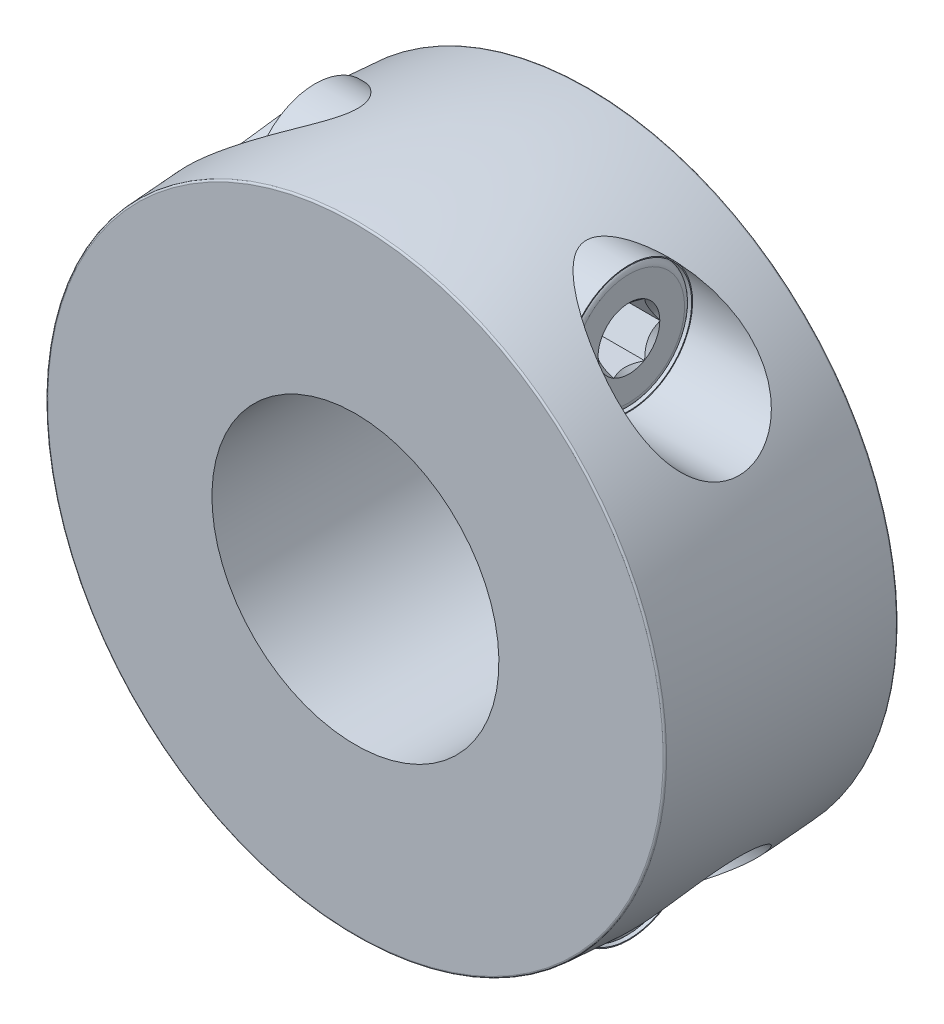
ISO-10303-21;
HEADER;
FILE_DESCRIPTION(('STEP AP214'),'2;1');
FILE_NAME('part.step','',(''),(''),'','','');
FILE_SCHEMA(('AUTOMOTIVE_DESIGN { 1 0 10303 214 1 1 1 1 }'));
ENDSEC;
DATA;
#1=APPLICATION_CONTEXT('core data for automotive mechanical design processes');
#2=APPLICATION_PROTOCOL_DEFINITION('international standard','automotive_design',2000,#1);
#3=PRODUCT_CONTEXT('',#1,'mechanical');
#4=PRODUCT('Part','Part','',(#3));
#5=PRODUCT_RELATED_PRODUCT_CATEGORY('part','',(#4));
#6=PRODUCT_DEFINITION_FORMATION('','',#4);
#7=PRODUCT_DEFINITION_CONTEXT('part definition',#1,'design');
#8=PRODUCT_DEFINITION('design','',#6,#7);
#9=PRODUCT_DEFINITION_SHAPE('','',#8);
#10=(LENGTH_UNIT() NAMED_UNIT(*) SI_UNIT(.MILLI.,.METRE.));
#11=(NAMED_UNIT(*) PLANE_ANGLE_UNIT() SI_UNIT($,.RADIAN.));
#12=(NAMED_UNIT(*) SI_UNIT($,.STERADIAN.) SOLID_ANGLE_UNIT());
#13=UNCERTAINTY_MEASURE_WITH_UNIT(LENGTH_MEASURE(1.E-05),#10,'distance_accuracy_value','');
#14=(GEOMETRIC_REPRESENTATION_CONTEXT(3) GLOBAL_UNCERTAINTY_ASSIGNED_CONTEXT((#13)) GLOBAL_UNIT_ASSIGNED_CONTEXT((#10,
#11,#12)) REPRESENTATION_CONTEXT('',''));
#15=CARTESIAN_POINT('',(0.,0.,0.));
#16=DIRECTION('',(0.,0.,1.));
#17=DIRECTION('',(1.,0.,0.));
#18=AXIS2_PLACEMENT_3D('',#15,#16,#17);
#19=CARTESIAN_POINT('',(-8.75,12.75,6.5));
#20=DIRECTION('',(-1.,0.,0.));
#21=DIRECTION('',(0.,0.,-1.));
#22=AXIS2_PLACEMENT_3D('',#19,#20,#21);
#23=CYLINDRICAL_SURFACE('',#22,3.54992331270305);
#24=CARTESIAN_POINT('',(-8.7502,15.1072307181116,3.8456792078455));
#25=CARTESIAN_POINT('',(-8.68255863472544,15.1477132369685,3.88163448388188));
#26=CARTESIAN_POINT('',(-8.61506120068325,15.1875056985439,3.91862531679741));
#27=CARTESIAN_POINT('',(-8.4804564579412,15.2656941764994,3.99476155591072));
#28=CARTESIAN_POINT('',(-8.41334921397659,15.3040899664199,4.03390730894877));
#29=CARTESIAN_POINT('',(-8.21224184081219,15.4174525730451,4.15501977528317));
#30=CARTESIAN_POINT('',(-8.07902175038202,15.4902567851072,4.24036338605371));
#31=CARTESIAN_POINT('',(-7.81454111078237,15.63057988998,4.42212356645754));
#32=CARTESIAN_POINT('',(-7.6833247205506,15.6980228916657,4.51866325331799));
#33=CARTESIAN_POINT('',(-7.4271130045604,15.8258729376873,4.72361123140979));
#34=CARTESIAN_POINT('',(-7.30210572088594,15.8862938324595,4.8319953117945));
#35=CARTESIAN_POINT('',(-7.1430956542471,15.9610256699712,4.98572340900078));
#36=CARTESIAN_POINT('',(-7.10440853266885,15.9790285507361,5.02446502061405));
#37=CARTESIAN_POINT('',(-7.02840827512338,16.0140710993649,5.10369253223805));
#38=CARTESIAN_POINT('',(-6.99109518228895,16.031110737,5.14417848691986));
#39=CARTESIAN_POINT('',(-6.88160948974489,16.0806623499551,5.26849081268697));
#40=CARTESIAN_POINT('',(-6.81188647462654,16.11160889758,5.35517543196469));
#41=CARTESIAN_POINT('',(-6.6814884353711,16.16859385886,5.53848307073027));
#42=CARTESIAN_POINT('',(-6.62093592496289,16.1945668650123,5.63521570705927));
#43=CARTESIAN_POINT('',(-6.51546500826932,16.23926126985,5.83839960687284));
#44=CARTESIAN_POINT('',(-6.47049040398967,16.258008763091,5.94481414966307));
#45=CARTESIAN_POINT('',(-6.41397976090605,16.2814115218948,6.13015973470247));
#46=CARTESIAN_POINT('',(-6.39633629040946,16.2886621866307,6.20687585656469));
#47=CARTESIAN_POINT('',(-6.37331375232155,16.2981093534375,6.36243715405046));
#48=CARTESIAN_POINT('',(-6.36792330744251,16.3003105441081,6.44128028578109));
#49=CARTESIAN_POINT('',(-6.37009295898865,16.2994227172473,6.59884121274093));
#50=CARTESIAN_POINT('',(-6.37766787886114,16.2963276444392,6.67755876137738));
#51=CARTESIAN_POINT('',(-6.40482289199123,16.2851720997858,6.8325231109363));
#52=CARTESIAN_POINT('',(-6.42441469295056,16.2771067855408,6.90876742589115));
#53=CARTESIAN_POINT('',(-6.48300166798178,16.2527920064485,7.0858050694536));
#54=CARTESIAN_POINT('',(-6.52655708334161,16.2345898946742,7.18479596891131));
#55=CARTESIAN_POINT('',(-6.62701656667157,16.1919558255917,7.37430211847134));
#56=CARTESIAN_POINT('',(-6.68395845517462,16.1675061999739,7.46479231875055));
#57=CARTESIAN_POINT('',(-6.80149054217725,16.1161593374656,7.63038471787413));
#58=CARTESIAN_POINT('',(-6.86134864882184,16.0896520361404,7.70614105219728));
#59=CARTESIAN_POINT('',(-6.98636893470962,16.0333590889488,7.85189447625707));
#60=CARTESIAN_POINT('',(-7.05153587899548,16.0035704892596,7.92188627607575));
#61=CARTESIAN_POINT('',(-7.18591458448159,15.941075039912,8.05710116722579));
#62=CARTESIAN_POINT('',(-7.25514270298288,15.9083560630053,8.12230219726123));
#63=CARTESIAN_POINT('',(-7.39637511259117,15.8404170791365,8.24825507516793));
#64=CARTESIAN_POINT('',(-7.46838017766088,15.8051963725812,8.30900566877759));
#65=CARTESIAN_POINT('',(-7.63850951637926,15.7204811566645,8.4459318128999));
#66=CARTESIAN_POINT('',(-7.73741760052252,15.6701093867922,8.5205885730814));
#67=CARTESIAN_POINT('',(-7.93770515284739,15.5656373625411,8.6637908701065));
#68=CARTESIAN_POINT('',(-8.03908572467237,15.5115354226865,8.73233361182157));
#69=CARTESIAN_POINT('',(-8.24158383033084,15.4008680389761,8.86263245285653));
#70=CARTESIAN_POINT('',(-8.34267092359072,15.3443674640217,8.92449138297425));
#71=CARTESIAN_POINT('',(-8.54581134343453,15.2281738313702,9.04311840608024));
#72=CARTESIAN_POINT('',(-8.64786349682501,15.1684843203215,9.09989197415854));
#73=CARTESIAN_POINT('',(-8.7502,15.1072307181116,9.1543207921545));
#74=B_SPLINE_CURVE_WITH_KNOTS('',3,(#24,#25,#26,#27,#28,#29,#30,#31,#32,#33,#34,#35,#36,#37,#38,
#39,#40,#41,#42,#43,#44,#45,#46,#47,#48,#49,#50,#51,#52,#53,#54,#55,#56,#57,#58,#59,#60,#61,#62,
#63,#64,#65,#66,#67,#68,#69,#70,#71,#72,#73),.UNSPECIFIED.,.F.,.F.,(4,2,2,2,2,2,2,2,2,2,2,2,2,2,
2,2,2,2,2,2,2,2,2,2,4),(0.,0.259907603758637,0.519857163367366,1.04192255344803,
1.57039954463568,2.09781580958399,2.27067554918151,2.44354071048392,2.7892536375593,
3.13924050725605,3.48795130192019,3.7241133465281,3.96005601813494,4.1962686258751,
4.43271173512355,4.7598555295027,5.08793494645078,5.38786805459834,5.68807340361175,
5.98958425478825,6.29117975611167,6.69221964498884,7.09344194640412,7.48717190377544,
7.88047272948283),.UNSPECIFIED.);
#75=CARTESIAN_POINT('',(-8.75,15.1073504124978,3.84578551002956));
#76=VERTEX_POINT('',#75);
#77=CARTESIAN_POINT('',(-8.75,15.107350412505,9.15421448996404));
#78=VERTEX_POINT('',#77);
#79=EDGE_CURVE('E1128',#76,#78,#74,.T.);
#80=ORIENTED_EDGE('',*,*,#79,.F.);
#81=CARTESIAN_POINT('',(-8.75,12.75,6.5));
#82=DIRECTION('',(-1.,0.,0.));
#83=DIRECTION('',(0.,0.,-1.));
#84=AXIS2_PLACEMENT_3D('',#81,#82,#83);
#85=CIRCLE('',#84,3.54992331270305);
#86=EDGE_CURVE('E1137',#78,#76,#85,.T.);
#87=ORIENTED_EDGE('',*,*,#86,.F.);
#88=EDGE_LOOP('',(#80,#87));
#89=FACE_BOUND('',#88,.T.);
#90=ADVANCED_FACE('F14',(#89),#23,.T.);
#91=CARTESIAN_POINT('',(-23.75,12.75,6.5));
#92=DIRECTION('',(-1.,0.,0.));
#93=DIRECTION('',(0.,0.,-1.));
#94=AXIS2_PLACEMENT_3D('',#91,#92,#93);
#95=CYLINDRICAL_SURFACE('',#94,3.54992331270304);
#96=CARTESIAN_POINT('',(-8.75,12.75,6.5));
#97=DIRECTION('',(-1.,0.,0.));
#98=DIRECTION('',(0.,0.,-1.));
#99=AXIS2_PLACEMENT_3D('',#96,#97,#98);
#100=CIRCLE('',#99,3.54992331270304);
#101=EDGE_CURVE('E32',#76,#78,#100,.T.);
#102=ORIENTED_EDGE('',*,*,#101,.F.);
#103=CARTESIAN_POINT('',(-8.7498,15.1074701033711,9.15410818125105));
#104=CARTESIAN_POINT('',(-8.85006216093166,15.0474721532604,9.20738416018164));
#105=CARTESIAN_POINT('',(-8.95062002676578,14.9859661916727,9.25839305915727));
#106=CARTESIAN_POINT('',(-9.15206427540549,14.8599957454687,9.35591339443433));
#107=CARTESIAN_POINT('',(-9.25295065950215,14.7955312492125,9.40242481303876));
#108=CARTESIAN_POINT('',(-9.45492768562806,14.6636106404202,9.49104764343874));
#109=CARTESIAN_POINT('',(-9.55601841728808,14.596150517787,9.53315288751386));
#110=CARTESIAN_POINT('',(-9.75803567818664,14.4583830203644,9.61283063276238));
#111=CARTESIAN_POINT('',(-9.85896220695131,14.3880756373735,9.65040312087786));
#112=CARTESIAN_POINT('',(-10.1632620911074,14.1714882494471,9.75690194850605));
#113=CARTESIAN_POINT('',(-10.3661115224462,14.0208742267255,9.81871191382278));
#114=CARTESIAN_POINT('',(-10.7685899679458,13.7089441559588,9.92189133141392));
#115=CARTESIAN_POINT('',(-10.9682210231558,13.5476352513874,9.96327427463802));
#116=CARTESIAN_POINT('',(-11.3028405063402,13.2656902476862,10.0142348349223));
#117=CARTESIAN_POINT('',(-11.4390660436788,13.1475618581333,10.0296527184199));
#118=CARTESIAN_POINT('',(-11.7085923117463,12.9070508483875,10.0484986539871));
#119=CARTESIAN_POINT('',(-11.8418931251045,12.784668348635,10.0519270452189));
#120=CARTESIAN_POINT('',(-12.1044242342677,12.5367454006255,10.0456732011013));
#121=CARTESIAN_POINT('',(-12.2336665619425,12.4112167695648,10.0360344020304));
#122=CARTESIAN_POINT('',(-12.4876645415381,12.1576258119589,10.0024858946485));
#123=CARTESIAN_POINT('',(-12.6124214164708,12.0295641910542,9.97858010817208));
#124=CARTESIAN_POINT('',(-12.9185644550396,11.7067063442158,9.89903592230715));
#125=CARTESIAN_POINT('',(-13.0965856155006,11.5110004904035,9.83345325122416));
#126=CARTESIAN_POINT('',(-13.4362726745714,11.122920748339,9.66219258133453));
#127=CARTESIAN_POINT('',(-13.5979559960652,10.9305434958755,9.5565578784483));
#128=CARTESIAN_POINT('',(-13.8694465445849,10.5960211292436,9.32746918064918));
#129=CARTESIAN_POINT('',(-13.9831174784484,10.4516153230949,9.21200464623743));
#130=CARTESIAN_POINT('',(-14.1413183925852,10.2455762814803,9.0176896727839));
#131=CARTESIAN_POINT('',(-14.1920220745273,10.178629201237,8.94936118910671));
#132=CARTESIAN_POINT('',(-14.2889534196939,10.0491167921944,8.8057581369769));
#133=CARTESIAN_POINT('',(-14.3351831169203,9.98654947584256,8.73048675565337));
#134=CARTESIAN_POINT('',(-14.4232043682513,9.86612322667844,8.57247935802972));
#135=CARTESIAN_POINT('',(-14.464950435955,9.80831372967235,8.48968018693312));
#136=CARTESIAN_POINT('',(-14.5431003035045,9.69903757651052,8.31767896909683));
#137=CARTESIAN_POINT('',(-14.5795069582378,9.64756753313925,8.22848038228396));
#138=CARTESIAN_POINT('',(-14.6466241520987,9.55188780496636,8.04427977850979));
#139=CARTESIAN_POINT('',(-14.6773372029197,9.50767491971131,7.94928034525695));
#140=CARTESIAN_POINT('',(-14.7327543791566,9.42735659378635,7.75423789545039));
#141=CARTESIAN_POINT('',(-14.7574596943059,9.39124954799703,7.65419588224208));
#142=CARTESIAN_POINT('',(-14.797412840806,9.3325576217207,7.4650678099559));
#143=CARTESIAN_POINT('',(-14.8135173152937,9.30876488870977,7.37653514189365));
#144=CARTESIAN_POINT('',(-14.8410211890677,9.26800098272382,7.19720286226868));
#145=CARTESIAN_POINT('',(-14.8524212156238,9.25102890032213,7.10640355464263));
#146=CARTESIAN_POINT('',(-14.8704120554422,9.22419546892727,6.92332915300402));
#147=CARTESIAN_POINT('',(-14.8770052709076,9.21433056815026,6.83105481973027));
#148=CARTESIAN_POINT('',(-14.8853371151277,9.20185653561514,6.64582771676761));
#149=CARTESIAN_POINT('',(-14.8870760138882,9.19924700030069,6.55287498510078));
#150=CARTESIAN_POINT('',(-14.8850997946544,9.2022142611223,6.291668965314));
#151=CARTESIAN_POINT('',(-14.8758221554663,9.21613991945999,6.12344381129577));
#152=CARTESIAN_POINT('',(-14.841513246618,9.26728257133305,5.7923688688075));
#153=CARTESIAN_POINT('',(-14.8164845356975,9.3044957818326,5.62951821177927));
#154=CARTESIAN_POINT('',(-14.7514716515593,9.40008466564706,5.31376221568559));
#155=CARTESIAN_POINT('',(-14.7115226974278,9.4584104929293,5.16083444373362));
#156=CARTESIAN_POINT('',(-14.6177223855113,9.59336852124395,4.86792537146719));
#157=CARTESIAN_POINT('',(-14.5638680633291,9.67000462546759,4.72794684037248));
#158=CARTESIAN_POINT('',(-14.4390910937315,9.84446568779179,4.45349441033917));
#159=CARTESIAN_POINT('',(-14.3671998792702,9.94343941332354,4.32019557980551));
#160=CARTESIAN_POINT('',(-14.2106304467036,10.1543640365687,4.07284288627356));
#161=CARTESIAN_POINT('',(-14.1259468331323,10.266320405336,3.95879718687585));
#162=CARTESIAN_POINT('',(-13.9325822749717,10.515963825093,3.73540556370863));
#163=CARTESIAN_POINT('',(-13.8222016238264,10.6550361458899,3.6290921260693));
#164=CARTESIAN_POINT('',(-13.5894582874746,10.9398474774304,3.44149911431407));
#165=CARTESIAN_POINT('',(-13.4670880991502,11.0855906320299,3.36023535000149));
#166=CARTESIAN_POINT('',(-13.2416214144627,11.3461049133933,3.23705467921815));
#167=CARTESIAN_POINT('',(-13.1404767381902,11.4603759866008,3.19039206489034));
#168=CARTESIAN_POINT('',(-12.9331936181,11.6890554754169,3.1101564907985));
#169=CARTESIAN_POINT('',(-12.8270531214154,11.8034639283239,3.07658896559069));
#170=CARTESIAN_POINT('',(-12.6103887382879,12.03141737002,3.02158505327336));
#171=CARTESIAN_POINT('',(-12.4998570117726,12.1449603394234,3.00017151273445));
#172=CARTESIAN_POINT('',(-12.2752382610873,12.3700989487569,2.96863272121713));
#173=CARTESIAN_POINT('',(-12.1611502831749,12.4816940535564,2.95851052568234));
#174=CARTESIAN_POINT('',(-11.8875145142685,12.7427780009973,2.94687489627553));
#175=CARTESIAN_POINT('',(-11.7266704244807,12.8911190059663,2.9498930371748));
#176=CARTESIAN_POINT('',(-11.4006849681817,13.1815979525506,2.97339745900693));
#177=CARTESIAN_POINT('',(-11.2355418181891,13.3237332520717,2.99389110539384));
#178=CARTESIAN_POINT('',(-10.9019504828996,13.6010391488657,3.05069045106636));
#179=CARTESIAN_POINT('',(-10.7334995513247,13.7362035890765,3.08700986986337));
#180=CARTESIAN_POINT('',(-10.3944501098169,13.9988463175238,3.17411974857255));
#181=CARTESIAN_POINT('',(-10.2238521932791,14.1263266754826,3.22490629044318));
#182=CARTESIAN_POINT('',(-9.94406491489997,14.32808631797,3.31895309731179));
#183=CARTESIAN_POINT('',(-9.83522911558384,14.4047752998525,3.3581758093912));
#184=CARTESIAN_POINT('',(-9.61733228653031,14.5548367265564,3.44191235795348));
#185=CARTESIAN_POINT('',(-9.50827130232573,14.6282097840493,3.48642521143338));
#186=CARTESIAN_POINT('',(-9.29074997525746,14.7712072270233,3.58041633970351));
#187=CARTESIAN_POINT('',(-9.18228945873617,14.84084912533,3.62986758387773));
#188=CARTESIAN_POINT('',(-8.96570616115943,14.9767319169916,3.73397095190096));
#189=CARTESIAN_POINT('',(-8.8575834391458,15.0429722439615,3.78862393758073));
#190=CARTESIAN_POINT('',(-8.7498,15.1074701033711,3.84589181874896));
#191=B_SPLINE_CURVE_WITH_KNOTS('',3,(#103,#104,#105,#106,#107,#108,#109,#110,#111,#112,#113,
#114,#115,#116,#117,#118,#119,#120,#121,#122,#123,#124,#125,#126,#127,#128,#129,#130,#131,#132,
#133,#134,#135,#136,#137,#138,#139,#140,#141,#142,#143,#144,#145,#146,#147,#148,#149,#150,#151,
#152,#153,#154,#155,#156,#157,#158,#159,#160,#161,#162,#163,#164,#165,#166,#167,#168,#169,#170,
#171,#172,#173,#174,#175,#176,#177,#178,#179,#180,#181,#182,#183,#184,#185,#186,#187,#188,#189,
#190),.UNSPECIFIED.,.F.,.F.,(4,2,2,2,2,2,2,2,2,2,2,2,2,2,2,2,2,2,2,2,2,2,2,2,2,2,2,2,2,2,2,2,2,
2,2,2,2,2,2,2,2,2,2,4),(0.,0.38520968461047,0.770420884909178,1.15616428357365,1.5419087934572,
2.32117134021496,3.0999185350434,3.64240604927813,4.18487821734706,4.72555158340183,
5.26607639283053,6.08070468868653,6.8944548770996,7.5427586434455,7.86721602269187,
8.19152519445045,8.51886349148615,8.84602612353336,9.17304408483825,9.49999723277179,
9.77885094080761,10.0576674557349,10.3363445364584,10.6150061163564,11.1195141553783,
11.6239402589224,12.1271831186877,12.6305333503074,13.1711545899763,13.7120044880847,
14.3306051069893,14.94959535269,15.427711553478,15.9060259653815,16.3852365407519,
16.8645767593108,17.5200980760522,18.175895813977,18.832263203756,19.4884530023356,
19.9047207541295,20.3209112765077,20.7349370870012,21.1490316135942),.UNSPECIFIED.);
#192=EDGE_CURVE('E1045',#78,#76,#191,.T.);
#193=ORIENTED_EDGE('',*,*,#192,.F.);
#194=EDGE_LOOP('',(#102,#193));
#195=FACE_BOUND('',#194,.T.);
#196=ADVANCED_FACE('F1064',(#195),#95,.F.);
#197=CARTESIAN_POINT('',(-3.75,-12.75,6.5));
#198=DIRECTION('',(1.,0.,0.));
#199=DIRECTION('',(0.,0.,1.));
#200=AXIS2_PLACEMENT_3D('',#197,#198,#199);
#201=CYLINDRICAL_SURFACE('',#200,3.54992331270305);
#202=CARTESIAN_POINT('',(-8.7502,-15.1072307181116,9.1543207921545));
#203=CARTESIAN_POINT('',(-8.68255863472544,-15.1477132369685,9.11836551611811));
#204=CARTESIAN_POINT('',(-8.61506120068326,-15.1875056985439,9.08137468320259));
#205=CARTESIAN_POINT('',(-8.48045645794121,-15.2656941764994,9.00523844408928));
#206=CARTESIAN_POINT('',(-8.41334921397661,-15.3040899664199,8.96609269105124));
#207=CARTESIAN_POINT('',(-8.21224184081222,-15.4174525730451,8.84498022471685));
#208=CARTESIAN_POINT('',(-8.07902175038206,-15.4902567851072,8.75963661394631));
#209=CARTESIAN_POINT('',(-7.81454111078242,-15.63057988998,8.5778764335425));
#210=CARTESIAN_POINT('',(-7.68332472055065,-15.6980228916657,8.48133674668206));
#211=CARTESIAN_POINT('',(-7.42711300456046,-15.8258729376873,8.27638876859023));
#212=CARTESIAN_POINT('',(-7.30210572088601,-15.8862938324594,8.16800468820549));
#213=CARTESIAN_POINT('',(-7.14309565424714,-15.9610256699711,8.01427659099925));
#214=CARTESIAN_POINT('',(-7.10440853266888,-15.9790285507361,7.97553497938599));
#215=CARTESIAN_POINT('',(-7.02840827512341,-16.0140710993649,7.89630746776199));
#216=CARTESIAN_POINT('',(-6.991095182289,-16.031110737,7.85582151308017));
#217=CARTESIAN_POINT('',(-6.88160948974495,-16.0806623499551,7.73150918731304));
#218=CARTESIAN_POINT('',(-6.81188647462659,-16.1116088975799,7.64482456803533));
#219=CARTESIAN_POINT('',(-6.68148843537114,-16.16859385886,7.46151692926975));
#220=CARTESIAN_POINT('',(-6.62093592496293,-16.1945668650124,7.36478429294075));
#221=CARTESIAN_POINT('',(-6.51546500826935,-16.23926126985,7.16160039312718));
#222=CARTESIAN_POINT('',(-6.47049040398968,-16.2580087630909,7.05518585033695));
#223=CARTESIAN_POINT('',(-6.41397976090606,-16.2814115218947,6.86984026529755));
#224=CARTESIAN_POINT('',(-6.39633629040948,-16.2886621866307,6.79312414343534));
#225=CARTESIAN_POINT('',(-6.37331375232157,-16.2981093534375,6.63756284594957));
#226=CARTESIAN_POINT('',(-6.36792330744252,-16.3003105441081,6.55871971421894));
#227=CARTESIAN_POINT('',(-6.37009295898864,-16.2994227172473,6.4011587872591));
#228=CARTESIAN_POINT('',(-6.37766787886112,-16.2963276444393,6.32244123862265));
#229=CARTESIAN_POINT('',(-6.40482289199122,-16.2851720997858,6.16747688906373));
#230=CARTESIAN_POINT('',(-6.42441469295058,-16.2771067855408,6.09123257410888));
#231=CARTESIAN_POINT('',(-6.4830016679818,-16.2527920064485,5.91419493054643));
#232=CARTESIAN_POINT('',(-6.52655708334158,-16.2345898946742,5.81520403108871));
#233=CARTESIAN_POINT('',(-6.62701656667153,-16.1919558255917,5.62569788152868));
#234=CARTESIAN_POINT('',(-6.68395845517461,-16.1675061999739,5.5352076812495));
#235=CARTESIAN_POINT('',(-6.80149054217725,-16.1161593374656,5.36961528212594));
#236=CARTESIAN_POINT('',(-6.86134864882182,-16.0896520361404,5.29385894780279));
#237=CARTESIAN_POINT('',(-6.98636893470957,-16.0333590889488,5.14810552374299));
#238=CARTESIAN_POINT('',(-7.0515358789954,-16.0035704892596,5.07811372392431));
#239=CARTESIAN_POINT('',(-7.1859145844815,-15.9410750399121,4.94289883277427));
#240=CARTESIAN_POINT('',(-7.2551427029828,-15.9083560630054,4.87769780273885));
#241=CARTESIAN_POINT('',(-7.39637511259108,-15.8404170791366,4.75174492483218));
#242=CARTESIAN_POINT('',(-7.46838017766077,-15.8051963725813,4.6909943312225));
#243=CARTESIAN_POINT('',(-7.63850951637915,-15.7204811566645,4.55406818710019));
#244=CARTESIAN_POINT('',(-7.73741760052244,-15.6701093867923,4.4794114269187));
#245=CARTESIAN_POINT('',(-7.93770515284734,-15.5656373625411,4.33620912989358));
#246=CARTESIAN_POINT('',(-8.03908572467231,-15.5115354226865,4.26766638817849));
#247=CARTESIAN_POINT('',(-8.24158383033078,-15.4008680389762,4.1373675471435));
#248=CARTESIAN_POINT('',(-8.34267092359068,-15.3443674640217,4.07550861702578));
#249=CARTESIAN_POINT('',(-8.54581134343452,-15.2281738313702,3.95688159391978));
#250=CARTESIAN_POINT('',(-8.64786349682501,-15.1684843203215,3.90010802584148));
#251=CARTESIAN_POINT('',(-8.7502,-15.1072307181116,3.8456792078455));
#252=B_SPLINE_CURVE_WITH_KNOTS('',3,(#202,#203,#204,#205,#206,#207,#208,#209,#210,#211,#212,
#213,#214,#215,#216,#217,#218,#219,#220,#221,#222,#223,#224,#225,#226,#227,#228,#229,#230,#231,
#232,#233,#234,#235,#236,#237,#238,#239,#240,#241,#242,#243,#244,#245,#246,#247,#248,#249,#250,
#251),.UNSPECIFIED.,.F.,.F.,(4,2,2,2,2,2,2,2,2,2,2,2,2,2,2,2,2,2,2,2,2,2,2,2,4),(0.,
0.259907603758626,0.51985716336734,1.04192255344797,1.57039954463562,2.09781580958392,
2.27067554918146,2.44354071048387,2.78925363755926,3.13924050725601,3.48795130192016,
3.72411334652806,3.96005601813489,4.19626862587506,4.43271173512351,4.75985552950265,
5.08793494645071,5.38786805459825,5.68807340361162,5.9895842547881,6.29117975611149,
6.6922196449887,7.09344194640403,7.48717190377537,7.88047272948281),.UNSPECIFIED.);
#253=CARTESIAN_POINT('',(-8.75,-15.1073504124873,9.15421448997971));
#254=VERTEX_POINT('',#253);
#255=CARTESIAN_POINT('',(-8.75,-15.1073504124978,3.84578551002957));
#256=VERTEX_POINT('',#255);
#257=EDGE_CURVE('E1084',#254,#256,#252,.T.);
#258=ORIENTED_EDGE('',*,*,#257,.F.);
#259=CARTESIAN_POINT('',(-8.75,-12.75,6.5));
#260=DIRECTION('',(1.,0.,0.));
#261=DIRECTION('',(0.,0.,1.));
#262=AXIS2_PLACEMENT_3D('',#259,#260,#261);
#263=CIRCLE('',#262,3.54992331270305);
#264=EDGE_CURVE('E1093',#254,#256,#263,.T.);
#265=ORIENTED_EDGE('',*,*,#264,.T.);
#266=EDGE_LOOP('',(#258,#265));
#267=FACE_BOUND('',#266,.T.);
#268=ADVANCED_FACE('F1069',(#267),#201,.T.);
#269=CARTESIAN_POINT('',(-8.75,-12.75,6.5));
#270=DIRECTION('',(1.,0.,0.));
#271=DIRECTION('',(0.,0.,1.));
#272=AXIS2_PLACEMENT_3D('',#269,#270,#271);
#273=CYLINDRICAL_SURFACE('',#272,3.54992331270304);
#274=CARTESIAN_POINT('',(-8.75,-12.75,6.5));
#275=DIRECTION('',(1.,0.,0.));
#276=DIRECTION('',(0.,0.,1.));
#277=AXIS2_PLACEMENT_3D('',#274,#275,#276);
#278=CIRCLE('',#277,3.54992331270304);
#279=EDGE_CURVE('E1092',#256,#254,#278,.T.);
#280=ORIENTED_EDGE('',*,*,#279,.T.);
#281=CARTESIAN_POINT('',(-8.7498,-15.1074701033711,3.84589181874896));
#282=CARTESIAN_POINT('',(-8.85006216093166,-15.0474721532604,3.79261583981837));
#283=CARTESIAN_POINT('',(-8.95062002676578,-14.9859661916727,3.74160694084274));
#284=CARTESIAN_POINT('',(-9.15206427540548,-14.8599957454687,3.64408660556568));
#285=CARTESIAN_POINT('',(-9.25295065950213,-14.7955312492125,3.59757518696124));
#286=CARTESIAN_POINT('',(-9.45492768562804,-14.6636106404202,3.50895235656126));
#287=CARTESIAN_POINT('',(-9.55601841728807,-14.596150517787,3.46684711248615));
#288=CARTESIAN_POINT('',(-9.75803567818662,-14.4583830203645,3.38716936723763));
#289=CARTESIAN_POINT('',(-9.85896220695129,-14.3880756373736,3.34959687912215));
#290=CARTESIAN_POINT('',(-10.1632620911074,-14.1714882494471,3.24309805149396));
#291=CARTESIAN_POINT('',(-10.3661115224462,-14.0208742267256,3.18128808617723));
#292=CARTESIAN_POINT('',(-10.7685899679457,-13.7089441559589,3.07810866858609));
#293=CARTESIAN_POINT('',(-10.9682210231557,-13.5476352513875,3.03672572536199));
#294=CARTESIAN_POINT('',(-11.3028405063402,-13.2656902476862,2.98576516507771));
#295=CARTESIAN_POINT('',(-11.4390660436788,-13.1475618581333,2.97034728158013));
#296=CARTESIAN_POINT('',(-11.7085923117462,-12.9070508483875,2.95150134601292));
#297=CARTESIAN_POINT('',(-11.8418931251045,-12.784668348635,2.94807295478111));
#298=CARTESIAN_POINT('',(-12.1044242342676,-12.5367454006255,2.95432679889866));
#299=CARTESIAN_POINT('',(-12.2336665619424,-12.4112167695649,2.96396559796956));
#300=CARTESIAN_POINT('',(-12.487664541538,-12.157625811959,2.99751410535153));
#301=CARTESIAN_POINT('',(-12.6124214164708,-12.0295641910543,3.02141989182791));
#302=CARTESIAN_POINT('',(-12.9185644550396,-11.7067063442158,3.10096407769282));
#303=CARTESIAN_POINT('',(-13.0965856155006,-11.5110004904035,3.16654674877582));
#304=CARTESIAN_POINT('',(-13.4362726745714,-11.122920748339,3.33780741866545));
#305=CARTESIAN_POINT('',(-13.5979559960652,-10.9305434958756,3.44344212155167));
#306=CARTESIAN_POINT('',(-13.8694465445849,-10.5960211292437,3.67253081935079));
#307=CARTESIAN_POINT('',(-13.9831174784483,-10.4516153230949,3.78799535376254));
#308=CARTESIAN_POINT('',(-14.1413183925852,-10.2455762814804,3.98231032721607));
#309=CARTESIAN_POINT('',(-14.1920220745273,-10.1786292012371,4.05063881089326));
#310=CARTESIAN_POINT('',(-14.2889534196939,-10.0491167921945,4.19424186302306));
#311=CARTESIAN_POINT('',(-14.3351831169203,-9.98654947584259,4.26951324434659));
#312=CARTESIAN_POINT('',(-14.4232043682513,-9.86612322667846,4.42752064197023));
#313=CARTESIAN_POINT('',(-14.464950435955,-9.80831372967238,4.51031981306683));
#314=CARTESIAN_POINT('',(-14.5431003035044,-9.69903757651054,4.68232103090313));
#315=CARTESIAN_POINT('',(-14.5795069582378,-9.64756753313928,4.77151961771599));
#316=CARTESIAN_POINT('',(-14.6466241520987,-9.55188780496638,4.95572022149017));
#317=CARTESIAN_POINT('',(-14.6773372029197,-9.50767491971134,5.05071965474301));
#318=CARTESIAN_POINT('',(-14.7327543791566,-9.42735659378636,5.24576210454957));
#319=CARTESIAN_POINT('',(-14.7574596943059,-9.39124954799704,5.34580411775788));
#320=CARTESIAN_POINT('',(-14.797412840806,-9.33255762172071,5.53493219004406));
#321=CARTESIAN_POINT('',(-14.8135173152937,-9.30876488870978,5.6234648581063));
#322=CARTESIAN_POINT('',(-14.8410211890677,-9.26800098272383,5.80279713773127));
#323=CARTESIAN_POINT('',(-14.8524212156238,-9.25102890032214,5.89359644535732));
#324=CARTESIAN_POINT('',(-14.8704120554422,-9.22419546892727,6.07667084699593));
#325=CARTESIAN_POINT('',(-14.8770052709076,-9.21433056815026,6.16894518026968));
#326=CARTESIAN_POINT('',(-14.8853371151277,-9.20185653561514,6.35417228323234));
#327=CARTESIAN_POINT('',(-14.8870760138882,-9.19924700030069,6.44712501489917));
#328=CARTESIAN_POINT('',(-14.8850997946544,-9.2022142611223,6.70833103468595));
#329=CARTESIAN_POINT('',(-14.8758221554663,-9.21613991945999,6.87655618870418));
#330=CARTESIAN_POINT('',(-14.841513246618,-9.26728257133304,7.20763113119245));
#331=CARTESIAN_POINT('',(-14.8164845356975,-9.30449578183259,7.37048178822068));
#332=CARTESIAN_POINT('',(-14.7514716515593,-9.40008466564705,7.68623778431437));
#333=CARTESIAN_POINT('',(-14.7115226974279,-9.45841049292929,7.83916555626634));
#334=CARTESIAN_POINT('',(-14.6177223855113,-9.59336852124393,8.13207462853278));
#335=CARTESIAN_POINT('',(-14.5638680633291,-9.67000462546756,8.27205315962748));
#336=CARTESIAN_POINT('',(-14.4390910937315,-9.84446568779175,8.54650558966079));
#337=CARTESIAN_POINT('',(-14.3671998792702,-9.94343941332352,8.67980442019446));
#338=CARTESIAN_POINT('',(-14.2106304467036,-10.1543640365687,8.92715711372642));
#339=CARTESIAN_POINT('',(-14.1259468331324,-10.266320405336,9.04120281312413));
#340=CARTESIAN_POINT('',(-13.9325822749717,-10.515963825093,9.26459443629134));
#341=CARTESIAN_POINT('',(-13.8222016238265,-10.6550361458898,9.37090787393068));
#342=CARTESIAN_POINT('',(-13.5894582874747,-10.9398474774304,9.55850088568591));
#343=CARTESIAN_POINT('',(-13.4670880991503,-11.0855906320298,9.63976464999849));
#344=CARTESIAN_POINT('',(-13.2416214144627,-11.3461049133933,9.76294532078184));
#345=CARTESIAN_POINT('',(-13.1404767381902,-11.4603759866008,9.80960793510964));
#346=CARTESIAN_POINT('',(-12.9331936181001,-11.6890554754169,9.88984350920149));
#347=CARTESIAN_POINT('',(-12.8270531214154,-11.8034639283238,9.92341103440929));
#348=CARTESIAN_POINT('',(-12.6103887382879,-12.0314173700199,9.97841494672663));
#349=CARTESIAN_POINT('',(-12.4998570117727,-12.1449603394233,9.99982848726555));
#350=CARTESIAN_POINT('',(-12.2752382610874,-12.3700989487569,10.0313672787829));
#351=CARTESIAN_POINT('',(-12.1611502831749,-12.4816940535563,10.0414894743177));
#352=CARTESIAN_POINT('',(-11.8875145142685,-12.7427780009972,10.0531251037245));
#353=CARTESIAN_POINT('',(-11.7266704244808,-12.8911190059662,10.0501069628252));
#354=CARTESIAN_POINT('',(-11.4006849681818,-13.1815979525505,10.0266025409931));
#355=CARTESIAN_POINT('',(-11.2355418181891,-13.3237332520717,10.0061088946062));
#356=CARTESIAN_POINT('',(-10.9019504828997,-13.6010391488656,9.94930954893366));
#357=CARTESIAN_POINT('',(-10.7334995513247,-13.7362035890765,9.91299013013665));
#358=CARTESIAN_POINT('',(-10.394450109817,-13.9988463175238,9.82588025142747));
#359=CARTESIAN_POINT('',(-10.2238521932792,-14.1263266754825,9.77509370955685));
#360=CARTESIAN_POINT('',(-9.94406491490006,-14.32808631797,9.68104690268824));
#361=CARTESIAN_POINT('',(-9.83522911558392,-14.4047752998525,9.64182419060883));
#362=CARTESIAN_POINT('',(-9.61733228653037,-14.5548367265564,9.55808764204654));
#363=CARTESIAN_POINT('',(-9.50827130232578,-14.6282097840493,9.51357478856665));
#364=CARTESIAN_POINT('',(-9.29074997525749,-14.7712072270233,9.41958366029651));
#365=CARTESIAN_POINT('',(-9.1822894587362,-14.8408491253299,9.37013241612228));
#366=CARTESIAN_POINT('',(-8.96570616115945,-14.9767319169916,9.26602904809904));
#367=CARTESIAN_POINT('',(-8.85758343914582,-15.0429722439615,9.21137606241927));
#368=CARTESIAN_POINT('',(-8.7498,-15.1074701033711,9.15410818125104));
#369=B_SPLINE_CURVE_WITH_KNOTS('',3,(#281,#282,#283,#284,#285,#286,#287,#288,#289,#290,#291,
#292,#293,#294,#295,#296,#297,#298,#299,#300,#301,#302,#303,#304,#305,#306,#307,#308,#309,#310,
#311,#312,#313,#314,#315,#316,#317,#318,#319,#320,#321,#322,#323,#324,#325,#326,#327,#328,#329,
#330,#331,#332,#333,#334,#335,#336,#337,#338,#339,#340,#341,#342,#343,#344,#345,#346,#347,#348,
#349,#350,#351,#352,#353,#354,#355,#356,#357,#358,#359,#360,#361,#362,#363,#364,#365,#366,#367,
#368),.UNSPECIFIED.,.F.,.F.,(4,2,2,2,2,2,2,2,2,2,2,2,2,2,2,2,2,2,2,2,2,2,2,2,2,2,2,2,2,2,2,2,2,
2,2,2,2,2,2,2,2,2,2,4),(0.,0.38520968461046,0.77042088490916,1.15616428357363,1.54190879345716,
2.32117134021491,3.09991853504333,3.64240604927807,4.184878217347,4.72555158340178,
5.26607639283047,6.08070468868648,6.89445487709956,7.54275864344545,7.86721602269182,
8.1915251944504,8.51886349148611,8.84602612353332,9.17304408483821,9.49999723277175,
9.77885094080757,10.0576674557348,10.3363445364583,10.6150061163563,11.1195141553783,
11.6239402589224,12.1271831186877,12.6305333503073,13.1711545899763,13.7120044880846,
14.3306051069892,14.9495953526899,15.427711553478,15.9060259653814,16.3852365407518,
16.8645767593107,17.5200980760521,18.1758958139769,18.8322632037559,19.4884530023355,
19.9047207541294,20.3209112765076,20.7349370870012,21.1490316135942),.UNSPECIFIED.);
#370=EDGE_CURVE('E1053',#256,#254,#369,.T.);
#371=ORIENTED_EDGE('',*,*,#370,.F.);
#372=EDGE_LOOP('',(#280,#371));
#373=FACE_BOUND('',#372,.T.);
#374=ADVANCED_FACE('F1081',(#373),#273,.F.);
#375=CARTESIAN_POINT('',(0.,0.,13.));
#376=DIRECTION('',(0.,0.,1.));
#377=DIRECTION('',(0.,1.,0.));
#378=AXIS2_PLACEMENT_3D('',#375,#376,#377);
#379=CYLINDRICAL_SURFACE('',#378,8.);
#380=CARTESIAN_POINT('',(0.,0.,13.));
#381=DIRECTION('',(0.,0.,1.));
#382=DIRECTION('',(0.,1.,0.));
#383=AXIS2_PLACEMENT_3D('',#380,#381,#382);
#384=CIRCLE('',#383,8.);
#385=CARTESIAN_POINT('',(0.,8.,13.));
#386=VERTEX_POINT('',#385);
#387=EDGE_CURVE('E1109',#386,#386,#384,.T.);
#388=ORIENTED_EDGE('',*,*,#387,.T.);
#389=EDGE_LOOP('',(#388));
#390=FACE_BOUND('',#389,.T.);
#391=CARTESIAN_POINT('',(0.,0.,0.));
#392=DIRECTION('',(0.,0.,1.));
#393=DIRECTION('',(0.,1.,0.));
#394=AXIS2_PLACEMENT_3D('',#391,#392,#393);
#395=CIRCLE('',#394,8.);
#396=CARTESIAN_POINT('',(0.,8.,0.));
#397=VERTEX_POINT('',#396);
#398=EDGE_CURVE('E1111',#397,#397,#395,.T.);
#399=ORIENTED_EDGE('',*,*,#398,.F.);
#400=EDGE_LOOP('',(#399));
#401=FACE_BOUND('',#400,.T.);
#402=ADVANCED_FACE('F1210',(#390,#401),#379,.F.);
#403=CARTESIAN_POINT('',(0.,8.,13.));
#404=DIRECTION('',(0.,0.,1.));
#405=DIRECTION('',(0.,1.,0.));
#406=AXIS2_PLACEMENT_3D('',#403,#404,#405);
#407=PLANE('',#406);
#408=CARTESIAN_POINT('',(0.,0.,13.));
#409=DIRECTION('',(0.,0.,1.));
#410=DIRECTION('',(0.,1.,0.));
#411=AXIS2_PLACEMENT_3D('',#408,#409,#410);
#412=CIRCLE('',#411,17.157356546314);
#413=CARTESIAN_POINT('',(0.,17.157356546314,13.));
#414=VERTEX_POINT('',#413);
#415=EDGE_CURVE('E1106',#414,#414,#412,.T.);
#416=ORIENTED_EDGE('',*,*,#415,.T.);
#417=EDGE_LOOP('',(#416));
#418=FACE_BOUND('',#417,.T.);
#419=ORIENTED_EDGE('',*,*,#387,.F.);
#420=EDGE_LOOP('',(#419));
#421=FACE_BOUND('',#420,.T.);
#422=ADVANCED_FACE('F1201',(#418,#421),#407,.T.);
#423=CARTESIAN_POINT('',(0.,0.,6.5));
#424=DIRECTION('',(0.,0.,1.));
#425=DIRECTION('',(0.,1.,0.));
#426=AXIS2_PLACEMENT_3D('',#423,#424,#425);
#427=DEGENERATE_TOROIDAL_SURFACE('',#426,67.125,84.625,.F.);
#428=CARTESIAN_POINT('',(0.,0.,0.0924282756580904));
#429=DIRECTION('',(0.,0.,1.));
#430=DIRECTION('',(0.,1.,0.));
#431=AXIS2_PLACEMENT_3D('',#428,#429,#430);
#432=CIRCLE('',#431,17.2570694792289);
#433=CARTESIAN_POINT('',(0.,17.2570694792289,0.0924282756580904));
#434=VERTEX_POINT('',#433);
#435=EDGE_CURVE('E1100',#434,#434,#432,.T.);
#436=ORIENTED_EDGE('',*,*,#435,.T.);
#437=EDGE_LOOP('',(#436));
#438=FACE_BOUND('',#437,.T.);
#439=CARTESIAN_POINT('',(0.,0.,12.9075716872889));
#440=DIRECTION('',(0.,0.,1.));
#441=DIRECTION('',(0.,1.,0.));
#442=AXIS2_PLACEMENT_3D('',#439,#440,#441);
#443=CIRCLE('',#442,17.2570694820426);
#444=CARTESIAN_POINT('',(0.,17.2570694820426,12.9075716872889));
#445=VERTEX_POINT('',#444);
#446=EDGE_CURVE('E1103',#445,#445,#443,.T.);
#447=ORIENTED_EDGE('',*,*,#446,.F.);
#448=EDGE_LOOP('',(#447));
#449=FACE_BOUND('',#448,.T.);
#450=ORIENTED_EDGE('',*,*,#370,.T.);
#451=ORIENTED_EDGE('',*,*,#257,.T.);
#452=EDGE_LOOP('',(#450,#451));
#453=FACE_BOUND('',#452,.T.);
#454=ORIENTED_EDGE('',*,*,#192,.T.);
#455=ORIENTED_EDGE('',*,*,#79,.T.);
#456=EDGE_LOOP('',(#454,#455));
#457=FACE_BOUND('',#456,.T.);
#458=CARTESIAN_POINT('',(8.7498,-15.1074701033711,9.15410818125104));
#459=CARTESIAN_POINT('',(8.85006216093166,-15.0474721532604,9.20738416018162));
#460=CARTESIAN_POINT('',(8.95062002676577,-14.9859661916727,9.25839305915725));
#461=CARTESIAN_POINT('',(9.15206427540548,-14.8599957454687,9.35591339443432));
#462=CARTESIAN_POINT('',(9.25295065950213,-14.7955312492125,9.40242481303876));
#463=CARTESIAN_POINT('',(9.45492768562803,-14.6636106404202,9.49104764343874));
#464=CARTESIAN_POINT('',(9.55601841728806,-14.596150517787,9.53315288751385));
#465=CARTESIAN_POINT('',(9.75803567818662,-14.4583830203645,9.61283063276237));
#466=CARTESIAN_POINT('',(9.85896220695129,-14.3880756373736,9.65040312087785));
#467=CARTESIAN_POINT('',(10.1632620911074,-14.1714882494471,9.75690194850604));
#468=CARTESIAN_POINT('',(10.3661115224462,-14.0208742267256,9.81871191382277));
#469=CARTESIAN_POINT('',(10.7685899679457,-13.7089441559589,9.92189133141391));
#470=CARTESIAN_POINT('',(10.9682210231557,-13.5476352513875,9.96327427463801));
#471=CARTESIAN_POINT('',(11.3028405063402,-13.2656902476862,10.0142348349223));
#472=CARTESIAN_POINT('',(11.4390660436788,-13.1475618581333,10.0296527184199));
#473=CARTESIAN_POINT('',(11.7085923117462,-12.9070508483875,10.0484986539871));
#474=CARTESIAN_POINT('',(11.8418931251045,-12.784668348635,10.0519270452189));
#475=CARTESIAN_POINT('',(12.1044242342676,-12.5367454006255,10.0456732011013));
#476=CARTESIAN_POINT('',(12.2336665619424,-12.4112167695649,10.0360344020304));
#477=CARTESIAN_POINT('',(12.487664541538,-12.157625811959,10.0024858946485));
#478=CARTESIAN_POINT('',(12.6124214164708,-12.0295641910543,9.97858010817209));
#479=CARTESIAN_POINT('',(12.9185644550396,-11.7067063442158,9.89903592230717));
#480=CARTESIAN_POINT('',(13.0965856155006,-11.5110004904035,9.83345325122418));
#481=CARTESIAN_POINT('',(13.4362726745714,-11.122920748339,9.66219258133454));
#482=CARTESIAN_POINT('',(13.5979559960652,-10.9305434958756,9.55655787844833));
#483=CARTESIAN_POINT('',(13.8694465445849,-10.5960211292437,9.32746918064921));
#484=CARTESIAN_POINT('',(13.9831174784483,-10.4516153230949,9.21200464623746));
#485=CARTESIAN_POINT('',(14.1413183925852,-10.2455762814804,9.01768967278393));
#486=CARTESIAN_POINT('',(14.1920220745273,-10.178629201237,8.94936118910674));
#487=CARTESIAN_POINT('',(14.2889534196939,-10.0491167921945,8.80575813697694));
#488=CARTESIAN_POINT('',(14.3351831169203,-9.98654947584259,8.73048675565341));
#489=CARTESIAN_POINT('',(14.4232043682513,-9.86612322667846,8.57247935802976));
#490=CARTESIAN_POINT('',(14.464950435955,-9.80831372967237,8.48968018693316));
#491=CARTESIAN_POINT('',(14.5431003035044,-9.69903757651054,8.31767896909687));
#492=CARTESIAN_POINT('',(14.5795069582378,-9.64756753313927,8.228480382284));
#493=CARTESIAN_POINT('',(14.6466241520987,-9.55188780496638,8.04427977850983));
#494=CARTESIAN_POINT('',(14.6773372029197,-9.50767491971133,7.94928034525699));
#495=CARTESIAN_POINT('',(14.7327543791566,-9.42735659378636,7.75423789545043));
#496=CARTESIAN_POINT('',(14.7574596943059,-9.39124954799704,7.65419588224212));
#497=CARTESIAN_POINT('',(14.797412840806,-9.33255762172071,7.46506780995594));
#498=CARTESIAN_POINT('',(14.8135173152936,-9.30876488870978,7.37653514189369));
#499=CARTESIAN_POINT('',(14.8410211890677,-9.26800098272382,7.19720286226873));
#500=CARTESIAN_POINT('',(14.8524212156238,-9.25102890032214,7.10640355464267));
#501=CARTESIAN_POINT('',(14.8704120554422,-9.22419546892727,6.92332915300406));
#502=CARTESIAN_POINT('',(14.8770052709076,-9.21433056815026,6.83105481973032));
#503=CARTESIAN_POINT('',(14.8853371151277,-9.20185653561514,6.64582771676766));
#504=CARTESIAN_POINT('',(14.8870760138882,-9.19924700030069,6.55287498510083));
#505=CARTESIAN_POINT('',(14.8850997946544,-9.2022142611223,6.29166896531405));
#506=CARTESIAN_POINT('',(14.8758221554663,-9.21613991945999,6.12344381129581));
#507=CARTESIAN_POINT('',(14.841513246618,-9.26728257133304,5.79236886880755));
#508=CARTESIAN_POINT('',(14.8164845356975,-9.30449578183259,5.62951821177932));
#509=CARTESIAN_POINT('',(14.7514716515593,-9.40008466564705,5.31376221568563));
#510=CARTESIAN_POINT('',(14.7115226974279,-9.45841049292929,5.16083444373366));
#511=CARTESIAN_POINT('',(14.6177223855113,-9.59336852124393,4.86792537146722));
#512=CARTESIAN_POINT('',(14.5638680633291,-9.67000462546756,4.72794684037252));
#513=CARTESIAN_POINT('',(14.4390910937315,-9.84446568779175,4.45349441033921));
#514=CARTESIAN_POINT('',(14.3671998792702,-9.94343941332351,4.32019557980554));
#515=CARTESIAN_POINT('',(14.2106304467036,-10.1543640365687,4.07284288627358));
#516=CARTESIAN_POINT('',(14.1259468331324,-10.266320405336,3.95879718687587));
#517=CARTESIAN_POINT('',(13.9325822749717,-10.515963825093,3.73540556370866));
#518=CARTESIAN_POINT('',(13.8222016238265,-10.6550361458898,3.62909212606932));
#519=CARTESIAN_POINT('',(13.5894582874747,-10.9398474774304,3.44149911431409));
#520=CARTESIAN_POINT('',(13.4670880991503,-11.0855906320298,3.36023535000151));
#521=CARTESIAN_POINT('',(13.2416214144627,-11.3461049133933,3.23705467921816));
#522=CARTESIAN_POINT('',(13.1404767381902,-11.4603759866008,3.19039206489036));
#523=CARTESIAN_POINT('',(12.9331936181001,-11.6890554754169,3.11015649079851));
#524=CARTESIAN_POINT('',(12.8270531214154,-11.8034639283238,3.0765889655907));
#525=CARTESIAN_POINT('',(12.6103887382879,-12.0314173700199,3.02158505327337));
#526=CARTESIAN_POINT('',(12.4998570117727,-12.1449603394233,3.00017151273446));
#527=CARTESIAN_POINT('',(12.2752382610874,-12.3700989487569,2.96863272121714));
#528=CARTESIAN_POINT('',(12.1611502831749,-12.4816940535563,2.95851052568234));
#529=CARTESIAN_POINT('',(11.8875145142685,-12.7427780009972,2.94687489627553));
#530=CARTESIAN_POINT('',(11.7266704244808,-12.8911190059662,2.9498930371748));
#531=CARTESIAN_POINT('',(11.4006849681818,-13.1815979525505,2.97339745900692));
#532=CARTESIAN_POINT('',(11.2355418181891,-13.3237332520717,2.99389110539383));
#533=CARTESIAN_POINT('',(10.9019504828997,-13.6010391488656,3.05069045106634));
#534=CARTESIAN_POINT('',(10.7334995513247,-13.7362035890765,3.08700986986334));
#535=CARTESIAN_POINT('',(10.394450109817,-13.9988463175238,3.17411974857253));
#536=CARTESIAN_POINT('',(10.2238521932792,-14.1263266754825,3.22490629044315));
#537=CARTESIAN_POINT('',(9.94406491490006,-14.32808631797,3.31895309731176));
#538=CARTESIAN_POINT('',(9.83522911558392,-14.4047752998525,3.35817580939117));
#539=CARTESIAN_POINT('',(9.61733228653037,-14.5548367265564,3.44191235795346));
#540=CARTESIAN_POINT('',(9.50827130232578,-14.6282097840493,3.48642521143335));
#541=CARTESIAN_POINT('',(9.29074997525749,-14.7712072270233,3.58041633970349));
#542=CARTESIAN_POINT('',(9.18228945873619,-14.8408491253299,3.62986758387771));
#543=CARTESIAN_POINT('',(8.96570616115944,-14.9767319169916,3.73397095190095));
#544=CARTESIAN_POINT('',(8.85758343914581,-15.0429722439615,3.78862393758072));
#545=CARTESIAN_POINT('',(8.7498,-15.1074701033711,3.84589181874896));
#546=B_SPLINE_CURVE_WITH_KNOTS('',3,(#458,#459,#460,#461,#462,#463,#464,#465,#466,#467,#468,
#469,#470,#471,#472,#473,#474,#475,#476,#477,#478,#479,#480,#481,#482,#483,#484,#485,#486,#487,
#488,#489,#490,#491,#492,#493,#494,#495,#496,#497,#498,#499,#500,#501,#502,#503,#504,#505,#506,
#507,#508,#509,#510,#511,#512,#513,#514,#515,#516,#517,#518,#519,#520,#521,#522,#523,#524,#525,
#526,#527,#528,#529,#530,#531,#532,#533,#534,#535,#536,#537,#538,#539,#540,#541,#542,#543,#544,
#545),.UNSPECIFIED.,.F.,.F.,(4,2,2,2,2,2,2,2,2,2,2,2,2,2,2,2,2,2,2,2,2,2,2,2,2,2,2,2,2,2,2,2,2,
2,2,2,2,2,2,2,2,2,2,4),(0.,0.385209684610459,0.770420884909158,1.15616428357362,
1.54190879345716,2.32117134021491,3.09991853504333,3.64240604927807,4.184878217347,
4.72555158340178,5.26607639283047,6.08070468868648,6.89445487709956,7.54275864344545,
7.86721602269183,8.1915251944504,8.51886349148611,8.84602612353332,9.17304408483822,
9.49999723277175,9.77885094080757,10.0576674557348,10.3363445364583,10.6150061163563,
11.1195141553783,11.6239402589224,12.1271831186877,12.6305333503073,13.1711545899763,
13.7120044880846,14.3306051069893,14.9495953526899,15.427711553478,15.9060259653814,
16.3852365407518,16.8645767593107,17.5200980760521,18.1758958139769,18.8322632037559,
19.4884530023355,19.9047207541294,20.3209112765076,20.7349370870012,21.1490316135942),.UNSPECIFIED.);
#547=CARTESIAN_POINT('',(8.75,-15.1073504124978,9.15421448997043));
#548=VERTEX_POINT('',#547);
#549=CARTESIAN_POINT('',(8.75,-15.1073504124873,3.84578551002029));
#550=VERTEX_POINT('',#549);
#551=EDGE_CURVE('E992',#548,#550,#546,.T.);
#552=ORIENTED_EDGE('',*,*,#551,.T.);
#553=CARTESIAN_POINT('',(8.7502,-15.1072307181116,3.8456792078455));
#554=CARTESIAN_POINT('',(8.68255863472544,-15.1477132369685,3.88163448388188));
#555=CARTESIAN_POINT('',(8.61506120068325,-15.1875056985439,3.91862531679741));
#556=CARTESIAN_POINT('',(8.48045645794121,-15.2656941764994,3.99476155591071));
#557=CARTESIAN_POINT('',(8.4133492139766,-15.3040899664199,4.03390730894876));
#558=CARTESIAN_POINT('',(8.21224184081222,-15.4174525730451,4.15501977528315));
#559=CARTESIAN_POINT('',(8.07902175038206,-15.4902567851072,4.2403633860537));
#560=CARTESIAN_POINT('',(7.81454111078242,-15.63057988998,4.4221235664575));
#561=CARTESIAN_POINT('',(7.68332472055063,-15.6980228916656,4.51866325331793));
#562=CARTESIAN_POINT('',(7.42711300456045,-15.8258729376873,4.72361123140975));
#563=CARTESIAN_POINT('',(7.30210572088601,-15.8862938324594,4.83199531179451));
#564=CARTESIAN_POINT('',(7.14309565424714,-15.9610256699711,4.98572340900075));
#565=CARTESIAN_POINT('',(7.10440853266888,-15.9790285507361,5.02446502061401));
#566=CARTESIAN_POINT('',(7.02840827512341,-16.0140710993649,5.10369253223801));
#567=CARTESIAN_POINT('',(6.99109518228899,-16.031110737,5.14417848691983));
#568=CARTESIAN_POINT('',(6.88160948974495,-16.0806623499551,5.26849081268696));
#569=CARTESIAN_POINT('',(6.81188647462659,-16.1116088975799,5.35517543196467));
#570=CARTESIAN_POINT('',(6.68148843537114,-16.16859385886,5.53848307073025));
#571=CARTESIAN_POINT('',(6.62093592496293,-16.1945668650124,5.63521570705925));
#572=CARTESIAN_POINT('',(6.51546500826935,-16.23926126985,5.83839960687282));
#573=CARTESIAN_POINT('',(6.47049040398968,-16.2580087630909,5.94481414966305));
#574=CARTESIAN_POINT('',(6.41397976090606,-16.2814115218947,6.13015973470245));
#575=CARTESIAN_POINT('',(6.39633629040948,-16.2886621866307,6.20687585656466));
#576=CARTESIAN_POINT('',(6.37331375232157,-16.2981093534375,6.36243715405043));
#577=CARTESIAN_POINT('',(6.36792330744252,-16.3003105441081,6.44128028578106));
#578=CARTESIAN_POINT('',(6.37009295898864,-16.2994227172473,6.5988412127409));
#579=CARTESIAN_POINT('',(6.37766787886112,-16.2963276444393,6.67755876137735));
#580=CARTESIAN_POINT('',(6.40482289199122,-16.2851720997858,6.83252311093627));
#581=CARTESIAN_POINT('',(6.42441469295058,-16.2771067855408,6.90876742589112));
#582=CARTESIAN_POINT('',(6.4830016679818,-16.2527920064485,7.08580506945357));
#583=CARTESIAN_POINT('',(6.52655708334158,-16.2345898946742,7.18479596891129));
#584=CARTESIAN_POINT('',(6.62701656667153,-16.1919558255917,7.37430211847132));
#585=CARTESIAN_POINT('',(6.68395845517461,-16.1675061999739,7.4647923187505));
#586=CARTESIAN_POINT('',(6.80149054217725,-16.1161593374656,7.63038471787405));
#587=CARTESIAN_POINT('',(6.86134864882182,-16.0896520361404,7.70614105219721));
#588=CARTESIAN_POINT('',(6.98636893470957,-16.0333590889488,7.851894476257));
#589=CARTESIAN_POINT('',(7.0515358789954,-16.0035704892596,7.92188627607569));
#590=CARTESIAN_POINT('',(7.1859145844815,-15.9410750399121,8.05710116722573));
#591=CARTESIAN_POINT('',(7.2551427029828,-15.9083560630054,8.12230219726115));
#592=CARTESIAN_POINT('',(7.39637511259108,-15.8404170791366,8.24825507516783));
#593=CARTESIAN_POINT('',(7.46838017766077,-15.8051963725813,8.3090056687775));
#594=CARTESIAN_POINT('',(7.63850951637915,-15.7204811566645,8.44593181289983));
#595=CARTESIAN_POINT('',(7.73741760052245,-15.6701093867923,8.52058857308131));
#596=CARTESIAN_POINT('',(7.93770515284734,-15.5656373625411,8.66379087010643));
#597=CARTESIAN_POINT('',(8.0390857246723,-15.5115354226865,8.73233361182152));
#598=CARTESIAN_POINT('',(8.24158383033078,-15.4008680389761,8.86263245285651));
#599=CARTESIAN_POINT('',(8.34267092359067,-15.3443674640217,8.92449138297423));
#600=CARTESIAN_POINT('',(8.54581134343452,-15.2281738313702,9.04311840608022));
#601=CARTESIAN_POINT('',(8.647863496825,-15.1684843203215,9.09989197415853));
#602=CARTESIAN_POINT('',(8.7502,-15.1072307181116,9.1543207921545));
#603=B_SPLINE_CURVE_WITH_KNOTS('',3,(#553,#554,#555,#556,#557,#558,#559,#560,#561,#562,#563,
#564,#565,#566,#567,#568,#569,#570,#571,#572,#573,#574,#575,#576,#577,#578,#579,#580,#581,#582,
#583,#584,#585,#586,#587,#588,#589,#590,#591,#592,#593,#594,#595,#596,#597,#598,#599,#600,#601,
#602),.UNSPECIFIED.,.F.,.F.,(4,2,2,2,2,2,2,2,2,2,2,2,2,2,2,2,2,2,2,2,2,2,2,2,4),(0.,
0.259907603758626,0.519857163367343,1.04192255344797,1.57039954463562,2.09781580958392,
2.27067554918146,2.44354071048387,2.78925363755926,3.13924050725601,3.48795130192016,
3.72411334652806,3.9600560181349,4.19626862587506,4.43271173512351,4.75985552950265,
5.08793494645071,5.38786805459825,5.68807340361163,5.9895842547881,6.29117975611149,
6.69221964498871,7.09344194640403,7.48717190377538,7.88047272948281),.UNSPECIFIED.);
#604=EDGE_CURVE('E1017',#550,#548,#603,.T.);
#605=ORIENTED_EDGE('',*,*,#604,.T.);
#606=EDGE_LOOP('',(#552,#605));
#607=FACE_BOUND('',#606,.T.);
#608=CARTESIAN_POINT('',(8.7498,15.1074701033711,3.84589181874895));
#609=CARTESIAN_POINT('',(8.85006216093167,15.0474721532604,3.79261583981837));
#610=CARTESIAN_POINT('',(8.95062002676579,14.9859661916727,3.74160694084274));
#611=CARTESIAN_POINT('',(9.1520642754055,14.8599957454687,3.64408660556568));
#612=CARTESIAN_POINT('',(9.25295065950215,14.7955312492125,3.59757518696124));
#613=CARTESIAN_POINT('',(9.45492768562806,14.6636106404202,3.50895235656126));
#614=CARTESIAN_POINT('',(9.55601841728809,14.596150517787,3.46684711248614));
#615=CARTESIAN_POINT('',(9.75803567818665,14.4583830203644,3.38716936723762));
#616=CARTESIAN_POINT('',(9.85896220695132,14.3880756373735,3.34959687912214));
#617=CARTESIAN_POINT('',(10.1632620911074,14.1714882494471,3.24309805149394));
#618=CARTESIAN_POINT('',(10.3661115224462,14.0208742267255,3.18128808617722));
#619=CARTESIAN_POINT('',(10.7685899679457,13.7089441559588,3.07810866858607));
#620=CARTESIAN_POINT('',(10.9682210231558,13.5476352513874,3.03672572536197));
#621=CARTESIAN_POINT('',(11.3028405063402,13.2656902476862,2.98576516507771));
#622=CARTESIAN_POINT('',(11.4390660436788,13.1475618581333,2.97034728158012));
#623=CARTESIAN_POINT('',(11.7085923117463,12.9070508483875,2.95150134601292));
#624=CARTESIAN_POINT('',(11.8418931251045,12.784668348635,2.94807295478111));
#625=CARTESIAN_POINT('',(12.1044242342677,12.5367454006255,2.95432679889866));
#626=CARTESIAN_POINT('',(12.2336665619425,12.4112167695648,2.96396559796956));
#627=CARTESIAN_POINT('',(12.4876645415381,12.1576258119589,2.99751410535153));
#628=CARTESIAN_POINT('',(12.6124214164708,12.0295641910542,3.02141989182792));
#629=CARTESIAN_POINT('',(12.9185644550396,11.7067063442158,3.10096407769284));
#630=CARTESIAN_POINT('',(13.0965856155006,11.5110004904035,3.16654674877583));
#631=CARTESIAN_POINT('',(13.4362726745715,11.122920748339,3.33780741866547));
#632=CARTESIAN_POINT('',(13.5979559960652,10.9305434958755,3.4434421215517));
#633=CARTESIAN_POINT('',(13.8694465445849,10.5960211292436,3.67253081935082));
#634=CARTESIAN_POINT('',(13.9831174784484,10.4516153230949,3.78799535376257));
#635=CARTESIAN_POINT('',(14.1413183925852,10.2455762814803,3.9823103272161));
#636=CARTESIAN_POINT('',(14.1920220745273,10.178629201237,4.05063881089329));
#637=CARTESIAN_POINT('',(14.2889534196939,10.0491167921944,4.1942418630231));
#638=CARTESIAN_POINT('',(14.3351831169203,9.98654947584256,4.26951324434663));
#639=CARTESIAN_POINT('',(14.4232043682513,9.86612322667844,4.42752064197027));
#640=CARTESIAN_POINT('',(14.464950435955,9.80831372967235,4.51031981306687));
#641=CARTESIAN_POINT('',(14.5431003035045,9.69903757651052,4.68232103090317));
#642=CARTESIAN_POINT('',(14.5795069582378,9.64756753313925,4.77151961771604));
#643=CARTESIAN_POINT('',(14.6466241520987,9.55188780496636,4.95572022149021));
#644=CARTESIAN_POINT('',(14.6773372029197,9.50767491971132,5.05071965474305));
#645=CARTESIAN_POINT('',(14.7327543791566,9.42735659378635,5.24576210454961));
#646=CARTESIAN_POINT('',(14.7574596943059,9.39124954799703,5.34580411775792));
#647=CARTESIAN_POINT('',(14.797412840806,9.3325576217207,5.5349321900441));
#648=CARTESIAN_POINT('',(14.8135173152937,9.30876488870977,5.62346485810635));
#649=CARTESIAN_POINT('',(14.8410211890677,9.26800098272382,5.80279713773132));
#650=CARTESIAN_POINT('',(14.8524212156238,9.25102890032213,5.89359644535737));
#651=CARTESIAN_POINT('',(14.8704120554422,9.22419546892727,6.07667084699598));
#652=CARTESIAN_POINT('',(14.8770052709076,9.21433056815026,6.16894518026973));
#653=CARTESIAN_POINT('',(14.8853371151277,9.20185653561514,6.35417228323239));
#654=CARTESIAN_POINT('',(14.8870760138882,9.19924700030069,6.44712501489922));
#655=CARTESIAN_POINT('',(14.8850997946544,9.2022142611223,6.708331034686));
#656=CARTESIAN_POINT('',(14.8758221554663,9.21613991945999,6.87655618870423));
#657=CARTESIAN_POINT('',(14.841513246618,9.26728257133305,7.2076311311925));
#658=CARTESIAN_POINT('',(14.8164845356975,9.3044957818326,7.37048178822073));
#659=CARTESIAN_POINT('',(14.7514716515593,9.40008466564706,7.68623778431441));
#660=CARTESIAN_POINT('',(14.7115226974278,9.4584104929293,7.83916555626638));
#661=CARTESIAN_POINT('',(14.6177223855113,9.59336852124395,8.13207462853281));
#662=CARTESIAN_POINT('',(14.5638680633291,9.67000462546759,8.27205315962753));
#663=CARTESIAN_POINT('',(14.4390910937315,9.84446568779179,8.54650558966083));
#664=CARTESIAN_POINT('',(14.3671998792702,9.94343941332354,8.67980442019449));
#665=CARTESIAN_POINT('',(14.2106304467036,10.1543640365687,8.92715711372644));
#666=CARTESIAN_POINT('',(14.1259468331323,10.266320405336,9.04120281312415));
#667=CARTESIAN_POINT('',(13.9325822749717,10.515963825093,9.26459443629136));
#668=CARTESIAN_POINT('',(13.8222016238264,10.6550361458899,9.3709078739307));
#669=CARTESIAN_POINT('',(13.5894582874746,10.9398474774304,9.55850088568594));
#670=CARTESIAN_POINT('',(13.4670880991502,11.0855906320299,9.6397646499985));
#671=CARTESIAN_POINT('',(13.2416214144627,11.3461049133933,9.76294532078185));
#672=CARTESIAN_POINT('',(13.1404767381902,11.4603759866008,9.80960793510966));
#673=CARTESIAN_POINT('',(12.9331936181,11.6890554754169,9.8898435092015));
#674=CARTESIAN_POINT('',(12.8270531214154,11.8034639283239,9.92341103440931));
#675=CARTESIAN_POINT('',(12.6103887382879,12.03141737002,9.97841494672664));
#676=CARTESIAN_POINT('',(12.4998570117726,12.1449603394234,9.99982848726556));
#677=CARTESIAN_POINT('',(12.2752382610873,12.3700989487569,10.0313672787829));
#678=CARTESIAN_POINT('',(12.1611502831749,12.4816940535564,10.0414894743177));
#679=CARTESIAN_POINT('',(11.8875145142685,12.7427780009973,10.0531251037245));
#680=CARTESIAN_POINT('',(11.7266704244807,12.8911190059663,10.0501069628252));
#681=CARTESIAN_POINT('',(11.4006849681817,13.1815979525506,10.0266025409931));
#682=CARTESIAN_POINT('',(11.2355418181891,13.3237332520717,10.0061088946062));
#683=CARTESIAN_POINT('',(10.9019504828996,13.6010391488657,9.94930954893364));
#684=CARTESIAN_POINT('',(10.7334995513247,13.7362035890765,9.91299013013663));
#685=CARTESIAN_POINT('',(10.3944501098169,13.9988463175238,9.82588025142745));
#686=CARTESIAN_POINT('',(10.2238521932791,14.1263266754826,9.77509370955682));
#687=CARTESIAN_POINT('',(9.94406491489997,14.32808631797,9.68104690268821));
#688=CARTESIAN_POINT('',(9.83522911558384,14.4047752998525,9.6418241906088));
#689=CARTESIAN_POINT('',(9.61733228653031,14.5548367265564,9.55808764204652));
#690=CARTESIAN_POINT('',(9.50827130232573,14.6282097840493,9.51357478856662));
#691=CARTESIAN_POINT('',(9.29074997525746,14.7712072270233,9.41958366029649));
#692=CARTESIAN_POINT('',(9.18228945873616,14.8408491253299,9.37013241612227));
#693=CARTESIAN_POINT('',(8.96570616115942,14.9767319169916,9.26602904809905));
#694=CARTESIAN_POINT('',(8.8575834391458,15.0429722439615,9.21137606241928));
#695=CARTESIAN_POINT('',(8.7498,15.1074701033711,9.15410818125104));
#696=B_SPLINE_CURVE_WITH_KNOTS('',3,(#608,#609,#610,#611,#612,#613,#614,#615,#616,#617,#618,
#619,#620,#621,#622,#623,#624,#625,#626,#627,#628,#629,#630,#631,#632,#633,#634,#635,#636,#637,
#638,#639,#640,#641,#642,#643,#644,#645,#646,#647,#648,#649,#650,#651,#652,#653,#654,#655,#656,
#657,#658,#659,#660,#661,#662,#663,#664,#665,#666,#667,#668,#669,#670,#671,#672,#673,#674,#675,
#676,#677,#678,#679,#680,#681,#682,#683,#684,#685,#686,#687,#688,#689,#690,#691,#692,#693,#694,
#695),.UNSPECIFIED.,.F.,.F.,(4,2,2,2,2,2,2,2,2,2,2,2,2,2,2,2,2,2,2,2,2,2,2,2,2,2,2,2,2,2,2,2,2,
2,2,2,2,2,2,2,2,2,2,4),(0.,0.385209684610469,0.770420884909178,1.15616428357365,1.5419087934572,
2.32117134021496,3.0999185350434,3.64240604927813,4.18487821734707,4.72555158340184,
5.26607639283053,6.08070468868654,6.8944548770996,7.5427586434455,7.86721602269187,
8.19152519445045,8.51886349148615,8.84602612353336,9.17304408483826,9.49999723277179,
9.77885094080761,10.0576674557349,10.3363445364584,10.6150061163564,11.1195141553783,
11.6239402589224,12.1271831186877,12.6305333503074,13.1711545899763,13.7120044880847,
14.3306051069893,14.94959535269,15.427711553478,15.9060259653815,16.3852365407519,
16.8645767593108,17.5200980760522,18.175895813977,18.832263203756,19.4884530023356,
19.9047207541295,20.3209112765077,20.7349370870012,21.1490316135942),.UNSPECIFIED.);
#697=CARTESIAN_POINT('',(8.75,15.107350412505,3.84578551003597));
#698=VERTEX_POINT('',#697);
#699=CARTESIAN_POINT('',(8.75,15.1073504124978,9.15421448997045));
#700=VERTEX_POINT('',#699);
#701=EDGE_CURVE('E1000',#698,#700,#696,.T.);
#702=ORIENTED_EDGE('',*,*,#701,.T.);
#703=CARTESIAN_POINT('',(8.7502,15.1072307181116,9.1543207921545));
#704=CARTESIAN_POINT('',(8.68255863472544,15.1477132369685,9.11836551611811));
#705=CARTESIAN_POINT('',(8.61506120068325,15.1875056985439,9.08137468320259));
#706=CARTESIAN_POINT('',(8.4804564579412,15.2656941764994,9.00523844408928));
#707=CARTESIAN_POINT('',(8.41334921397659,15.3040899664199,8.96609269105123));
#708=CARTESIAN_POINT('',(8.21224184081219,15.4174525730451,8.84498022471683));
#709=CARTESIAN_POINT('',(8.07902175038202,15.4902567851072,8.75963661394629));
#710=CARTESIAN_POINT('',(7.81454111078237,15.63057988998,8.57787643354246));
#711=CARTESIAN_POINT('',(7.6833247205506,15.6980228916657,8.48133674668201));
#712=CARTESIAN_POINT('',(7.4271130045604,15.8258729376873,8.27638876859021));
#713=CARTESIAN_POINT('',(7.30210572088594,15.8862938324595,8.1680046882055));
#714=CARTESIAN_POINT('',(7.1430956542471,15.9610256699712,8.01427659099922));
#715=CARTESIAN_POINT('',(7.10440853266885,15.9790285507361,7.97553497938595));
#716=CARTESIAN_POINT('',(7.02840827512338,16.0140710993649,7.89630746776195));
#717=CARTESIAN_POINT('',(6.99109518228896,16.031110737,7.85582151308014));
#718=CARTESIAN_POINT('',(6.88160948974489,16.0806623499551,7.73150918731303));
#719=CARTESIAN_POINT('',(6.81188647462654,16.11160889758,7.64482456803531));
#720=CARTESIAN_POINT('',(6.6814884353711,16.16859385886,7.46151692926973));
#721=CARTESIAN_POINT('',(6.62093592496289,16.1945668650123,7.36478429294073));
#722=CARTESIAN_POINT('',(6.51546500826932,16.23926126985,7.16160039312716));
#723=CARTESIAN_POINT('',(6.47049040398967,16.258008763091,7.05518585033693));
#724=CARTESIAN_POINT('',(6.41397976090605,16.2814115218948,6.86984026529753));
#725=CARTESIAN_POINT('',(6.39633629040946,16.2886621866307,6.79312414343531));
#726=CARTESIAN_POINT('',(6.37331375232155,16.2981093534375,6.63756284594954));
#727=CARTESIAN_POINT('',(6.36792330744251,16.3003105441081,6.55871971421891));
#728=CARTESIAN_POINT('',(6.37009295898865,16.2994227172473,6.40115878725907));
#729=CARTESIAN_POINT('',(6.37766787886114,16.2963276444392,6.32244123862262));
#730=CARTESIAN_POINT('',(6.40482289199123,16.2851720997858,6.1674768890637));
#731=CARTESIAN_POINT('',(6.42441469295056,16.2771067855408,6.09123257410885));
#732=CARTESIAN_POINT('',(6.48300166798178,16.2527920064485,5.9141949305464));
#733=CARTESIAN_POINT('',(6.5265570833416,16.2345898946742,5.81520403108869));
#734=CARTESIAN_POINT('',(6.62701656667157,16.1919558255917,5.62569788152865));
#735=CARTESIAN_POINT('',(6.68395845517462,16.1675061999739,5.53520768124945));
#736=CARTESIAN_POINT('',(6.80149054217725,16.1161593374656,5.36961528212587));
#737=CARTESIAN_POINT('',(6.86134864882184,16.0896520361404,5.29385894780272));
#738=CARTESIAN_POINT('',(6.98636893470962,16.0333590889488,5.14810552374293));
#739=CARTESIAN_POINT('',(7.05153587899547,16.0035704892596,5.07811372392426));
#740=CARTESIAN_POINT('',(7.18591458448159,15.941075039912,4.94289883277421));
#741=CARTESIAN_POINT('',(7.25514270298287,15.9083560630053,4.87769780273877));
#742=CARTESIAN_POINT('',(7.39637511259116,15.8404170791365,4.75174492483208));
#743=CARTESIAN_POINT('',(7.46838017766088,15.8051963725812,4.69099433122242));
#744=CARTESIAN_POINT('',(7.63850951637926,15.7204811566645,4.55406818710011));
#745=CARTESIAN_POINT('',(7.73741760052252,15.6701093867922,4.47941142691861));
#746=CARTESIAN_POINT('',(7.93770515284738,15.5656373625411,4.3362091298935));
#747=CARTESIAN_POINT('',(8.03908572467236,15.5115354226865,4.26766638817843));
#748=CARTESIAN_POINT('',(8.24158383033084,15.4008680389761,4.13736754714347));
#749=CARTESIAN_POINT('',(8.34267092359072,15.3443674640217,4.07550861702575));
#750=CARTESIAN_POINT('',(8.54581134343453,15.2281738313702,3.95688159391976));
#751=CARTESIAN_POINT('',(8.64786349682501,15.1684843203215,3.90010802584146));
#752=CARTESIAN_POINT('',(8.7502,15.1072307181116,3.8456792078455));
#753=B_SPLINE_CURVE_WITH_KNOTS('',3,(#703,#704,#705,#706,#707,#708,#709,#710,#711,#712,#713,
#714,#715,#716,#717,#718,#719,#720,#721,#722,#723,#724,#725,#726,#727,#728,#729,#730,#731,#732,
#733,#734,#735,#736,#737,#738,#739,#740,#741,#742,#743,#744,#745,#746,#747,#748,#749,#750,#751,
#752),.UNSPECIFIED.,.F.,.F.,(4,2,2,2,2,2,2,2,2,2,2,2,2,2,2,2,2,2,2,2,2,2,2,2,4),(0.,
0.259907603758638,0.519857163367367,1.04192255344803,1.57039954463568,2.09781580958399,
2.27067554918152,2.44354071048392,2.7892536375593,3.13924050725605,3.48795130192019,
3.7241133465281,3.96005601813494,4.1962686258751,4.43271173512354,4.7598555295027,
5.08793494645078,5.38786805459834,5.68807340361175,5.98958425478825,6.29117975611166,
6.69221964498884,7.09344194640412,7.48717190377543,7.88047272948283),.UNSPECIFIED.);
#754=EDGE_CURVE('E1032',#700,#698,#753,.T.);
#755=ORIENTED_EDGE('',*,*,#754,.T.);
#756=EDGE_LOOP('',(#702,#755));
#757=FACE_BOUND('',#756,.T.);
#758=ADVANCED_FACE('F1060',(#438,#449,#453,#457,#607,#757),#427,.F.);
#759=CARTESIAN_POINT('',(0.,17.157356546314,0.));
#760=DIRECTION('',(0.,0.,-1.));
#761=DIRECTION('',(0.,-1.,0.));
#762=AXIS2_PLACEMENT_3D('',#759,#760,#761);
#763=PLANE('',#762);
#764=ORIENTED_EDGE('',*,*,#398,.T.);
#765=EDGE_LOOP('',(#764));
#766=FACE_BOUND('',#765,.T.);
#767=CARTESIAN_POINT('',(0.,0.,0.));
#768=DIRECTION('',(0.,0.,1.));
#769=DIRECTION('',(0.,1.,0.));
#770=AXIS2_PLACEMENT_3D('',#767,#768,#769);
#771=CIRCLE('',#770,17.157356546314);
#772=CARTESIAN_POINT('',(0.,17.157356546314,0.));
#773=VERTEX_POINT('',#772);
#774=EDGE_CURVE('E1097',#773,#773,#771,.T.);
#775=ORIENTED_EDGE('',*,*,#774,.F.);
#776=EDGE_LOOP('',(#775));
#777=FACE_BOUND('',#776,.T.);
#778=ADVANCED_FACE('F1184',(#766,#777),#763,.T.);
#779=CARTESIAN_POINT('',(0.,0.,0.1));
#780=DIRECTION('',(0.,0.,1.));
#781=DIRECTION('',(0.,1.,0.));
#782=AXIS2_PLACEMENT_3D('',#779,#780,#781);
#783=TOROIDAL_SURFACE('',#782,17.157356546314,0.0999999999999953);
#784=ORIENTED_EDGE('',*,*,#774,.T.);
#785=EDGE_LOOP('',(#784));
#786=FACE_BOUND('',#785,.T.);
#787=ORIENTED_EDGE('',*,*,#435,.F.);
#788=EDGE_LOOP('',(#787));
#789=FACE_BOUND('',#788,.T.);
#790=ADVANCED_FACE('F1175',(#786,#789),#783,.T.);
#791=CARTESIAN_POINT('',(0.,0.,12.9));
#792=DIRECTION('',(0.,0.,1.));
#793=DIRECTION('',(0.,1.,0.));
#794=AXIS2_PLACEMENT_3D('',#791,#792,#793);
#795=TOROIDAL_SURFACE('',#794,17.157356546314,0.0999999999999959);
#796=ORIENTED_EDGE('',*,*,#446,.T.);
#797=EDGE_LOOP('',(#796));
#798=FACE_BOUND('',#797,.T.);
#799=ORIENTED_EDGE('',*,*,#415,.F.);
#800=EDGE_LOOP('',(#799));
#801=FACE_BOUND('',#800,.T.);
#802=ADVANCED_FACE('F1075',(#798,#801),#795,.T.);
#803=CARTESIAN_POINT('',(-8.75,12.75,6.5));
#804=DIRECTION('',(-1.,0.,0.));
#805=DIRECTION('',(0.,0.,-1.));
#806=AXIS2_PLACEMENT_3D('',#803,#804,#805);
#807=PLANE('',#806);
#808=ORIENTED_EDGE('',*,*,#101,.T.);
#809=ORIENTED_EDGE('',*,*,#86,.T.);
#810=EDGE_LOOP('',(#808,#809));
#811=FACE_BOUND('',#810,.T.);
#812=CARTESIAN_POINT('',(-8.75,12.75,6.5));
#813=DIRECTION('',(-1.,0.,0.));
#814=DIRECTION('',(0.,0.,-1.));
#815=AXIS2_PLACEMENT_3D('',#812,#813,#814);
#816=CIRCLE('',#815,2.);
#817=CARTESIAN_POINT('',(-8.75,12.75,4.5));
#818=VERTEX_POINT('',#817);
#819=EDGE_CURVE('E513',#818,#818,#816,.T.);
#820=ORIENTED_EDGE('',*,*,#819,.F.);
#821=EDGE_LOOP('',(#820));
#822=FACE_BOUND('',#821,.T.);
#823=ADVANCED_FACE('F1072',(#811,#822),#807,.T.);
#824=CARTESIAN_POINT('',(-8.75,12.75,6.5));
#825=DIRECTION('',(-1.,0.,0.));
#826=DIRECTION('',(0.,0.,-1.));
#827=AXIS2_PLACEMENT_3D('',#824,#825,#826);
#828=CYLINDRICAL_SURFACE('',#827,2.);
#829=CARTESIAN_POINT('',(-6.8205,12.75,6.5));
#830=DIRECTION('',(-1.,0.,0.));
#831=DIRECTION('',(0.,-1.,0.));
#832=AXIS2_PLACEMENT_3D('',#829,#830,#831);
#833=CIRCLE('',#832,2.);
#834=CARTESIAN_POINT('',(-6.8205,10.75,6.5));
#835=VERTEX_POINT('',#834);
#836=EDGE_CURVE('E24',#835,#835,#833,.T.);
#837=ORIENTED_EDGE('',*,*,#836,.F.);
#838=EDGE_LOOP('',(#837));
#839=FACE_BOUND('',#838,.T.);
#840=ORIENTED_EDGE('',*,*,#819,.T.);
#841=EDGE_LOOP('',(#840));
#842=FACE_BOUND('',#841,.T.);
#843=ADVANCED_FACE('F1074',(#839,#842),#828,.F.);
#844=CARTESIAN_POINT('',(-8.75,-16.299923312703,6.5));
#845=DIRECTION('',(-1.,0.,0.));
#846=DIRECTION('',(0.,0.,-1.));
#847=AXIS2_PLACEMENT_3D('',#844,#845,#846);
#848=PLANE('',#847);
#849=CARTESIAN_POINT('',(-8.75,-12.75,6.5));
#850=DIRECTION('',(1.,0.,0.));
#851=DIRECTION('',(0.,0.,1.));
#852=AXIS2_PLACEMENT_3D('',#849,#850,#851);
#853=CIRCLE('',#852,2.);
#854=CARTESIAN_POINT('',(-8.75,-12.75,8.5));
#855=VERTEX_POINT('',#854);
#856=EDGE_CURVE('E1124',#855,#855,#853,.T.);
#857=ORIENTED_EDGE('',*,*,#856,.T.);
#858=EDGE_LOOP('',(#857));
#859=FACE_BOUND('',#858,.T.);
#860=ORIENTED_EDGE('',*,*,#279,.F.);
#861=ORIENTED_EDGE('',*,*,#264,.F.);
#862=EDGE_LOOP('',(#860,#861));
#863=FACE_BOUND('',#862,.T.);
#864=ADVANCED_FACE('F484',(#859,#863),#848,.T.);
#865=CARTESIAN_POINT('',(0.,-12.75,6.5));
#866=DIRECTION('',(1.,0.,0.));
#867=DIRECTION('',(0.,0.,1.));
#868=AXIS2_PLACEMENT_3D('',#865,#866,#867);
#869=CYLINDRICAL_SURFACE('',#868,2.);
#870=CARTESIAN_POINT('',(-6.8205,-12.75,6.5));
#871=DIRECTION('',(-1.,0.,0.));
#872=DIRECTION('',(0.,-1.,0.));
#873=AXIS2_PLACEMENT_3D('',#870,#871,#872);
#874=CIRCLE('',#873,2.);
#875=CARTESIAN_POINT('',(-6.8205,-14.75,6.5));
#876=VERTEX_POINT('',#875);
#877=EDGE_CURVE('E9',#876,#876,#874,.T.);
#878=ORIENTED_EDGE('',*,*,#877,.F.);
#879=EDGE_LOOP('',(#878));
#880=FACE_BOUND('',#879,.T.);
#881=ORIENTED_EDGE('',*,*,#856,.F.);
#882=EDGE_LOOP('',(#881));
#883=FACE_BOUND('',#882,.T.);
#884=ADVANCED_FACE('F474',(#880,#883),#869,.F.);
#885=CARTESIAN_POINT('',(-7.25,-14.3205,6.5));
#886=DIRECTION('',(1.,0.,0.));
#887=DIRECTION('',(0.,1.,0.));
#888=AXIS2_PLACEMENT_3D('',#885,#886,#887);
#889=PLANE('',#888);
#890=CARTESIAN_POINT('',(-7.25,-12.75,6.5));
#891=DIRECTION('',(-1.,0.,0.));
#892=DIRECTION('',(0.,-1.,0.));
#893=AXIS2_PLACEMENT_3D('',#890,#891,#892);
#894=CIRCLE('',#893,1.5705);
#895=CARTESIAN_POINT('',(-7.25,-14.3205,6.5));
#896=VERTEX_POINT('',#895);
#897=EDGE_CURVE('E501',#896,#896,#894,.T.);
#898=ORIENTED_EDGE('',*,*,#897,.T.);
#899=EDGE_LOOP('',(#898));
#900=FACE_BOUND('',#899,.T.);
#901=ADVANCED_FACE('F451',(#900),#889,.F.);
#902=CARTESIAN_POINT('',(-6.8205,-12.75,6.5));
#903=DIRECTION('',(1.,0.,0.));
#904=DIRECTION('',(0.,1.,0.));
#905=AXIS2_PLACEMENT_3D('',#902,#903,#904);
#906=CONICAL_SURFACE('',#905,2.,0.785398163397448);
#907=ORIENTED_EDGE('',*,*,#897,.F.);
#908=EDGE_LOOP('',(#907));
#909=FACE_BOUND('',#908,.T.);
#910=ORIENTED_EDGE('',*,*,#877,.T.);
#911=EDGE_LOOP('',(#910));
#912=FACE_BOUND('',#911,.T.);
#913=ADVANCED_FACE('F473',(#909,#912),#906,.T.);
#914=CARTESIAN_POINT('',(5.28397459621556,12.75,6.5));
#915=DIRECTION('',(1.,0.,0.));
#916=DIRECTION('',(0.,1.,0.));
#917=AXIS2_PLACEMENT_3D('',#914,#915,#916);
#918=CONICAL_SURFACE('',#917,0.,1.0471975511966);
#919=CARTESIAN_POINT('',(6.15,12.75,6.5));
#920=DIRECTION('',(-1.,0.,0.));
#921=DIRECTION('',(0.,-1.,0.));
#922=AXIS2_PLACEMENT_3D('',#919,#920,#921);
#923=CIRCLE('',#922,1.5);
#924=CARTESIAN_POINT('',(6.15,11.25,6.5));
#925=VERTEX_POINT('',#924);
#926=CARTESIAN_POINT('',(6.15,12.,7.79903810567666));
#927=VERTEX_POINT('',#926);
#928=EDGE_CURVE('E272',#925,#927,#923,.T.);
#929=ORIENTED_EDGE('',*,*,#928,.F.);
#930=CARTESIAN_POINT('',(6.15,12.,5.20096189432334));
#931=VERTEX_POINT('',#930);
#932=EDGE_CURVE('E276',#931,#925,#923,.T.);
#933=ORIENTED_EDGE('',*,*,#932,.F.);
#934=CARTESIAN_POINT('',(6.15,13.5,5.20096189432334));
#935=VERTEX_POINT('',#934);
#936=EDGE_CURVE('E313',#935,#931,#923,.T.);
#937=ORIENTED_EDGE('',*,*,#936,.F.);
#938=CARTESIAN_POINT('',(6.15,14.25,6.5));
#939=VERTEX_POINT('',#938);
#940=EDGE_CURVE('E598',#939,#935,#923,.T.);
#941=ORIENTED_EDGE('',*,*,#940,.F.);
#942=CARTESIAN_POINT('',(6.15,13.5,7.79903810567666));
#943=VERTEX_POINT('',#942);
#944=EDGE_CURVE('E595',#943,#939,#923,.T.);
#945=ORIENTED_EDGE('',*,*,#944,.F.);
#946=EDGE_CURVE('E274',#927,#943,#923,.T.);
#947=ORIENTED_EDGE('',*,*,#946,.F.);
#948=EDGE_LOOP('',(#929,#933,#937,#941,#945,#947));
#949=FACE_BOUND('',#948,.T.);
#950=CARTESIAN_POINT('',(5.28397459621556,12.75,6.5));
#951=VERTEX_POINT('',#950);
#952=VERTEX_LOOP('',#951);
#953=FACE_BOUND('',#952,.T.);
#954=ADVANCED_FACE('F16',(#949,#953),#918,.F.);
#955=CARTESIAN_POINT('',(5.28397459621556,-12.75,6.5));
#956=DIRECTION('',(1.,0.,0.));
#957=DIRECTION('',(0.,1.,0.));
#958=AXIS2_PLACEMENT_3D('',#955,#956,#957);
#959=CONICAL_SURFACE('',#958,0.,1.0471975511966);
#960=CARTESIAN_POINT('',(6.15,-12.75,6.5));
#961=DIRECTION('',(-1.,0.,0.));
#962=DIRECTION('',(0.,-1.,0.));
#963=AXIS2_PLACEMENT_3D('',#960,#961,#962);
#964=CIRCLE('',#963,1.5);
#965=CARTESIAN_POINT('',(6.15,-14.25,6.5));
#966=VERTEX_POINT('',#965);
#967=CARTESIAN_POINT('',(6.15,-13.5,7.79903810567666));
#968=VERTEX_POINT('',#967);
#969=EDGE_CURVE('E523',#966,#968,#964,.T.);
#970=ORIENTED_EDGE('',*,*,#969,.F.);
#971=CARTESIAN_POINT('',(6.15,-13.5,5.20096189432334));
#972=VERTEX_POINT('',#971);
#973=EDGE_CURVE('E521',#972,#966,#964,.T.);
#974=ORIENTED_EDGE('',*,*,#973,.F.);
#975=CARTESIAN_POINT('',(6.15,-12.,5.20096189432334));
#976=VERTEX_POINT('',#975);
#977=EDGE_CURVE('E1391',#976,#972,#964,.T.);
#978=ORIENTED_EDGE('',*,*,#977,.F.);
#979=CARTESIAN_POINT('',(6.15,-11.25,6.5));
#980=VERTEX_POINT('',#979);
#981=EDGE_CURVE('E1385',#980,#976,#964,.T.);
#982=ORIENTED_EDGE('',*,*,#981,.F.);
#983=CARTESIAN_POINT('',(6.15,-12.,7.79903810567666));
#984=VERTEX_POINT('',#983);
#985=EDGE_CURVE('E1383',#984,#980,#964,.T.);
#986=ORIENTED_EDGE('',*,*,#985,.F.);
#987=EDGE_CURVE('E526',#968,#984,#964,.T.);
#988=ORIENTED_EDGE('',*,*,#987,.F.);
#989=EDGE_LOOP('',(#970,#974,#978,#982,#986,#988));
#990=FACE_BOUND('',#989,.T.);
#991=CARTESIAN_POINT('',(5.28397459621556,-12.75,6.5));
#992=VERTEX_POINT('',#991);
#993=VERTEX_LOOP('',#992);
#994=FACE_BOUND('',#993,.T.);
#995=ADVANCED_FACE('F643',(#990,#994),#959,.F.);
#996=CARTESIAN_POINT('',(6.15,12.75,6.5));
#997=DIRECTION('',(-1.,0.,0.));
#998=DIRECTION('',(0.,-1.,0.));
#999=AXIS2_PLACEMENT_3D('',#996,#997,#998);
#1000=PLANE('',#999);
#1001=DIRECTION('',(0.,0.866025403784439,0.5));
#1002=VECTOR('',#1001,1.);
#1003=CARTESIAN_POINT('',(6.15,11.25,7.36602540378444));
#1004=LINE('',#1003,#1002);
#1005=CARTESIAN_POINT('',(6.15,11.25,7.36602540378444));
#1006=VERTEX_POINT('',#1005);
#1007=EDGE_CURVE('E254',#1006,#927,#1004,.T.);
#1008=ORIENTED_EDGE('',*,*,#1007,.F.);
#1009=DIRECTION('',(0.,0.,1.));
#1010=VECTOR('',#1009,1.);
#1011=CARTESIAN_POINT('',(6.15,11.25,5.63397459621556));
#1012=LINE('',#1011,#1010);
#1013=EDGE_CURVE('E565',#925,#1006,#1012,.T.);
#1014=ORIENTED_EDGE('',*,*,#1013,.F.);
#1015=ORIENTED_EDGE('',*,*,#928,.T.);
#1016=EDGE_LOOP('',(#1008,#1014,#1015));
#1017=FACE_BOUND('',#1016,.T.);
#1018=ADVANCED_FACE('F437',(#1017),#1000,.F.);
#1019=CARTESIAN_POINT('',(6.15,11.25,5.63397459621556));
#1020=VERTEX_POINT('',#1019);
#1021=EDGE_CURVE('E236',#1020,#925,#1012,.T.);
#1022=ORIENTED_EDGE('',*,*,#1021,.F.);
#1023=DIRECTION('',(0.,-0.866025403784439,0.5));
#1024=VECTOR('',#1023,1.);
#1025=CARTESIAN_POINT('',(6.15,12.75,4.76794919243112));
#1026=LINE('',#1025,#1024);
#1027=EDGE_CURVE('E561',#931,#1020,#1026,.T.);
#1028=ORIENTED_EDGE('',*,*,#1027,.F.);
#1029=ORIENTED_EDGE('',*,*,#932,.T.);
#1030=EDGE_LOOP('',(#1022,#1028,#1029));
#1031=FACE_BOUND('',#1030,.T.);
#1032=ADVANCED_FACE('F421',(#1031),#1000,.F.);
#1033=CARTESIAN_POINT('',(6.15,12.75,4.76794919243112));
#1034=VERTEX_POINT('',#1033);
#1035=EDGE_CURVE('E562',#1034,#931,#1026,.T.);
#1036=ORIENTED_EDGE('',*,*,#1035,.F.);
#1037=DIRECTION('',(0.,-0.866025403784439,-0.5));
#1038=VECTOR('',#1037,1.);
#1039=CARTESIAN_POINT('',(6.15,14.25,5.63397459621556));
#1040=LINE('',#1039,#1038);
#1041=EDGE_CURVE('E557',#935,#1034,#1040,.T.);
#1042=ORIENTED_EDGE('',*,*,#1041,.F.);
#1043=ORIENTED_EDGE('',*,*,#936,.T.);
#1044=EDGE_LOOP('',(#1036,#1042,#1043));
#1045=FACE_BOUND('',#1044,.T.);
#1046=ADVANCED_FACE('F436',(#1045),#1000,.F.);
#1047=CARTESIAN_POINT('',(6.15,14.25,5.63397459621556));
#1048=VERTEX_POINT('',#1047);
#1049=EDGE_CURVE('E558',#1048,#935,#1040,.T.);
#1050=ORIENTED_EDGE('',*,*,#1049,.F.);
#1051=DIRECTION('',(0.,0.,-1.));
#1052=VECTOR('',#1051,1.);
#1053=CARTESIAN_POINT('',(6.15,14.25,7.36602540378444));
#1054=LINE('',#1053,#1052);
#1055=EDGE_CURVE('E552',#939,#1048,#1054,.T.);
#1056=ORIENTED_EDGE('',*,*,#1055,.F.);
#1057=ORIENTED_EDGE('',*,*,#940,.T.);
#1058=EDGE_LOOP('',(#1050,#1056,#1057));
#1059=FACE_BOUND('',#1058,.T.);
#1060=ADVANCED_FACE('F608',(#1059),#1000,.F.);
#1061=DIRECTION('',(0.,0.866025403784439,-0.5));
#1062=VECTOR('',#1061,1.);
#1063=CARTESIAN_POINT('',(6.15,12.75,8.23205080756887));
#1064=LINE('',#1063,#1062);
#1065=CARTESIAN_POINT('',(6.15,12.75,8.23205080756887));
#1066=VERTEX_POINT('',#1065);
#1067=EDGE_CURVE('E550',#1066,#943,#1064,.T.);
#1068=ORIENTED_EDGE('',*,*,#1067,.F.);
#1069=EDGE_CURVE('E249',#927,#1066,#1004,.T.);
#1070=ORIENTED_EDGE('',*,*,#1069,.F.);
#1071=ORIENTED_EDGE('',*,*,#946,.T.);
#1072=EDGE_LOOP('',(#1068,#1070,#1071));
#1073=FACE_BOUND('',#1072,.T.);
#1074=ADVANCED_FACE('F591',(#1073),#1000,.F.);
#1075=CARTESIAN_POINT('',(6.15,14.25,7.36602540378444));
#1076=VERTEX_POINT('',#1075);
#1077=EDGE_CURVE('E554',#1076,#939,#1054,.T.);
#1078=ORIENTED_EDGE('',*,*,#1077,.F.);
#1079=EDGE_CURVE('E553',#943,#1076,#1064,.T.);
#1080=ORIENTED_EDGE('',*,*,#1079,.F.);
#1081=ORIENTED_EDGE('',*,*,#944,.T.);
#1082=EDGE_LOOP('',(#1078,#1080,#1081));
#1083=FACE_BOUND('',#1082,.T.);
#1084=ADVANCED_FACE('F609',(#1083),#1000,.F.);
#1085=CARTESIAN_POINT('',(6.15,-12.75,6.5));
#1086=DIRECTION('',(-1.,0.,0.));
#1087=DIRECTION('',(0.,-1.,0.));
#1088=AXIS2_PLACEMENT_3D('',#1085,#1086,#1087);
#1089=PLANE('',#1088);
#1090=DIRECTION('',(0.,0.866025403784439,0.5));
#1091=VECTOR('',#1090,1.);
#1092=CARTESIAN_POINT('',(6.15,-14.25,7.36602540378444));
#1093=LINE('',#1092,#1091);
#1094=CARTESIAN_POINT('',(6.15,-14.25,7.36602540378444));
#1095=VERTEX_POINT('',#1094);
#1096=EDGE_CURVE('E1357',#1095,#968,#1093,.T.);
#1097=ORIENTED_EDGE('',*,*,#1096,.F.);
#1098=DIRECTION('',(0.,0.,1.));
#1099=VECTOR('',#1098,1.);
#1100=CARTESIAN_POINT('',(6.15,-14.25,5.63397459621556));
#1101=LINE('',#1100,#1099);
#1102=EDGE_CURVE('E1363',#966,#1095,#1101,.T.);
#1103=ORIENTED_EDGE('',*,*,#1102,.F.);
#1104=ORIENTED_EDGE('',*,*,#969,.T.);
#1105=EDGE_LOOP('',(#1097,#1103,#1104));
#1106=FACE_BOUND('',#1105,.T.);
#1107=ADVANCED_FACE('F460',(#1106),#1089,.F.);
#1108=CARTESIAN_POINT('',(6.15,-14.25,5.63397459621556));
#1109=VERTEX_POINT('',#1108);
#1110=EDGE_CURVE('E1361',#1109,#966,#1101,.T.);
#1111=ORIENTED_EDGE('',*,*,#1110,.F.);
#1112=DIRECTION('',(0.,-0.866025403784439,0.5));
#1113=VECTOR('',#1112,1.);
#1114=CARTESIAN_POINT('',(6.15,-12.75,4.76794919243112));
#1115=LINE('',#1114,#1113);
#1116=EDGE_CURVE('E1367',#972,#1109,#1115,.T.);
#1117=ORIENTED_EDGE('',*,*,#1116,.F.);
#1118=ORIENTED_EDGE('',*,*,#973,.T.);
#1119=EDGE_LOOP('',(#1111,#1117,#1118));
#1120=FACE_BOUND('',#1119,.T.);
#1121=ADVANCED_FACE('F430',(#1120),#1089,.F.);
#1122=CARTESIAN_POINT('',(6.15,-12.75,4.76794919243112));
#1123=VERTEX_POINT('',#1122);
#1124=EDGE_CURVE('E1364',#1123,#972,#1115,.T.);
#1125=ORIENTED_EDGE('',*,*,#1124,.F.);
#1126=DIRECTION('',(0.,-0.866025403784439,-0.5));
#1127=VECTOR('',#1126,1.);
#1128=CARTESIAN_POINT('',(6.15,-11.25,5.63397459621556));
#1129=LINE('',#1128,#1127);
#1130=EDGE_CURVE('E1370',#976,#1123,#1129,.T.);
#1131=ORIENTED_EDGE('',*,*,#1130,.F.);
#1132=ORIENTED_EDGE('',*,*,#977,.T.);
#1133=EDGE_LOOP('',(#1125,#1131,#1132));
#1134=FACE_BOUND('',#1133,.T.);
#1135=ADVANCED_FACE('F710',(#1134),#1089,.F.);
#1136=CARTESIAN_POINT('',(6.15,-11.25,5.63397459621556));
#1137=VERTEX_POINT('',#1136);
#1138=EDGE_CURVE('E1368',#1137,#976,#1129,.T.);
#1139=ORIENTED_EDGE('',*,*,#1138,.F.);
#1140=DIRECTION('',(0.,0.,-1.));
#1141=VECTOR('',#1140,1.);
#1142=CARTESIAN_POINT('',(6.15,-11.25,7.36602540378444));
#1143=LINE('',#1142,#1141);
#1144=EDGE_CURVE('E1373',#980,#1137,#1143,.T.);
#1145=ORIENTED_EDGE('',*,*,#1144,.F.);
#1146=ORIENTED_EDGE('',*,*,#981,.T.);
#1147=EDGE_LOOP('',(#1139,#1145,#1146));
#1148=FACE_BOUND('',#1147,.T.);
#1149=ADVANCED_FACE('F719',(#1148),#1089,.F.);
#1150=DIRECTION('',(0.,0.866025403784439,-0.5));
#1151=VECTOR('',#1150,1.);
#1152=CARTESIAN_POINT('',(6.15,-12.75,8.23205080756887));
#1153=LINE('',#1152,#1151);
#1154=CARTESIAN_POINT('',(6.15,-12.75,8.23205080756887));
#1155=VERTEX_POINT('',#1154);
#1156=EDGE_CURVE('E1010',#1155,#984,#1153,.T.);
#1157=ORIENTED_EDGE('',*,*,#1156,.F.);
#1158=EDGE_CURVE('E1360',#968,#1155,#1093,.T.);
#1159=ORIENTED_EDGE('',*,*,#1158,.F.);
#1160=ORIENTED_EDGE('',*,*,#987,.T.);
#1161=EDGE_LOOP('',(#1157,#1159,#1160));
#1162=FACE_BOUND('',#1161,.T.);
#1163=ADVANCED_FACE('F618',(#1162),#1089,.F.);
#1164=CARTESIAN_POINT('',(6.15,-11.25,7.36602540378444));
#1165=VERTEX_POINT('',#1164);
#1166=EDGE_CURVE('E1371',#1165,#980,#1143,.T.);
#1167=ORIENTED_EDGE('',*,*,#1166,.F.);
#1168=EDGE_CURVE('E1379',#984,#1165,#1153,.T.);
#1169=ORIENTED_EDGE('',*,*,#1168,.F.);
#1170=ORIENTED_EDGE('',*,*,#985,.T.);
#1171=EDGE_LOOP('',(#1167,#1169,#1170));
#1172=FACE_BOUND('',#1171,.T.);
#1173=ADVANCED_FACE('F354',(#1172),#1089,.F.);
#1174=CARTESIAN_POINT('',(8.53,12.75,6.5));
#1175=DIRECTION('',(1.,0.,0.));
#1176=DIRECTION('',(0.,1.,0.));
#1177=AXIS2_PLACEMENT_3D('',#1174,#1175,#1176);
#1178=CONICAL_SURFACE('',#1177,1.5,0.78539816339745);
#1179=CARTESIAN_POINT('',(8.75,12.75,6.5));
#1180=DIRECTION('',(-1.,0.,0.));
#1181=DIRECTION('',(0.,-1.,0.));
#1182=AXIS2_PLACEMENT_3D('',#1179,#1180,#1181);
#1183=CIRCLE('',#1182,1.72);
#1184=CARTESIAN_POINT('',(8.75,11.2710967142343,7.37820559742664));
#1185=VERTEX_POINT('',#1184);
#1186=CARTESIAN_POINT('',(8.75,12.7289032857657,8.21987061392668));
#1187=VERTEX_POINT('',#1186);
#1188=EDGE_CURVE('E271',#1185,#1187,#1183,.T.);
#1189=ORIENTED_EDGE('',*,*,#1188,.F.);
#1190=CARTESIAN_POINT('',(8.75020000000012,11.270742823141,7.37800127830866));
#1191=CARTESIAN_POINT('',(8.72177013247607,11.3210789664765,7.40706286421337));
#1192=CARTESIAN_POINT('',(8.69506567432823,11.3722442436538,7.43660315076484));
#1193=CARTESIAN_POINT('',(8.64627105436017,11.4765050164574,7.49679813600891));
#1194=CARTESIAN_POINT('',(8.62420644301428,11.5296094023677,7.52745796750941));
#1195=CARTESIAN_POINT('',(8.58647132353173,11.636676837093,7.58927337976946));
#1196=CARTESIAN_POINT('',(8.57071053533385,11.6906153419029,7.62041479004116));
#1197=CARTESIAN_POINT('',(8.54649081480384,11.7996198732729,7.68334858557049));
#1198=CARTESIAN_POINT('',(8.53801504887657,11.8546829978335,7.71513929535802));
#1199=CARTESIAN_POINT('',(8.53035173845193,11.9506044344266,7.77051956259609));
#1200=CARTESIAN_POINT('',(8.52929632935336,11.9913549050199,7.79404685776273));
#1201=CARTESIAN_POINT('',(8.53161738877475,12.0727727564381,7.84105347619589));
#1202=CARTESIAN_POINT('',(8.53499492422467,12.1134401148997,7.86453278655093));
#1203=CARTESIAN_POINT('',(8.54598635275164,12.1943681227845,7.91125659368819));
#1204=CARTESIAN_POINT('',(8.55360366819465,12.2346284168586,7.93450088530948));
#1205=CARTESIAN_POINT('',(8.57266658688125,12.3144708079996,7.98059791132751));
#1206=CARTESIAN_POINT('',(8.58411377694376,12.3540526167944,8.00345047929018));
#1207=CARTESIAN_POINT('',(8.61660941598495,12.4512020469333,8.05953972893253));
#1208=CARTESIAN_POINT('',(8.63962799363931,12.5082682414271,8.09248691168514));
#1209=CARTESIAN_POINT('',(8.69118560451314,12.6203000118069,8.15716848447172));
#1210=CARTESIAN_POINT('',(8.71970614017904,12.6752719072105,8.18890652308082));
#1211=CARTESIAN_POINT('',(8.7502,12.7292571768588,8.22007493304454));
#1212=B_SPLINE_CURVE_WITH_KNOTS('',3,(#1190,#1191,#1192,#1193,#1194,#1195,#1196,#1197,#1198,
#1199,#1200,#1201,#1202,#1203,#1204,#1205,#1206,#1207,#1208,#1209,#1210,#1211),.UNSPECIFIED.,
.F.,.F.,(4,2,2,2,2,2,2,2,2,2,4),(0.,0.194237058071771,0.389517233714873,0.581890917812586,
0.773818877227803,0.914817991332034,1.05585104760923,1.19699811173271,1.33820372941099,
1.54729349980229,1.75569219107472),.UNSPECIFIED.);
#1213=EDGE_CURVE('E362',#1185,#1187,#1212,.T.);
#1214=ORIENTED_EDGE('',*,*,#1213,.T.);
#1215=EDGE_LOOP('',(#1189,#1214));
#1216=FACE_BOUND('',#1215,.T.);
#1217=ADVANCED_FACE('F350',(#1216),#1178,.F.);
#1218=CARTESIAN_POINT('',(10.15,11.25,7.36602540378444));
#1219=DIRECTION('',(0.,-0.5,0.866025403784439));
#1220=DIRECTION('',(0.,0.866025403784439,0.5));
#1221=AXIS2_PLACEMENT_3D('',#1218,#1219,#1220);
#1222=PLANE('',#1221);
#1223=ORIENTED_EDGE('',*,*,#1069,.T.);
#1224=DIRECTION('',(-1.,0.,0.));
#1225=VECTOR('',#1224,1.);
#1226=CARTESIAN_POINT('',(10.15,12.75,8.23205080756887));
#1227=LINE('',#1226,#1225);
#1228=CARTESIAN_POINT('',(8.75,12.75,8.23205080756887));
#1229=VERTEX_POINT('',#1228);
#1230=EDGE_CURVE('E241',#1229,#1066,#1227,.T.);
#1231=ORIENTED_EDGE('',*,*,#1230,.F.);
#1232=DIRECTION('',(0.,0.866025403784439,0.5));
#1233=VECTOR('',#1232,1.);
#1234=CARTESIAN_POINT('',(8.75,10.71,7.05425625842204));
#1235=LINE('',#1234,#1233);
#1236=EDGE_CURVE('E245',#1187,#1229,#1235,.T.);
#1237=ORIENTED_EDGE('',*,*,#1236,.F.);
#1238=ORIENTED_EDGE('',*,*,#1213,.F.);
#1239=CARTESIAN_POINT('',(8.75,11.25,7.36602540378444));
#1240=VERTEX_POINT('',#1239);
#1241=EDGE_CURVE('E264',#1240,#1185,#1235,.T.);
#1242=ORIENTED_EDGE('',*,*,#1241,.F.);
#1243=DIRECTION('',(-1.,0.,0.));
#1244=VECTOR('',#1243,1.);
#1245=CARTESIAN_POINT('',(10.15,11.25,7.36602540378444));
#1246=LINE('',#1245,#1244);
#1247=EDGE_CURVE('E253',#1240,#1006,#1246,.T.);
#1248=ORIENTED_EDGE('',*,*,#1247,.T.);
#1249=ORIENTED_EDGE('',*,*,#1007,.T.);
#1250=EDGE_LOOP('',(#1223,#1231,#1237,#1238,#1242,#1248,#1249));
#1251=FACE_BOUND('',#1250,.T.);
#1252=ADVANCED_FACE('F243',(#1251),#1222,.F.);
#1253=CARTESIAN_POINT('',(8.75,11.25,5.65833498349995));
#1254=VERTEX_POINT('',#1253);
#1255=CARTESIAN_POINT('',(8.75,11.25,7.34166501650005));
#1256=VERTEX_POINT('',#1255);
#1257=EDGE_CURVE('E306',#1254,#1256,#1183,.T.);
#1258=ORIENTED_EDGE('',*,*,#1257,.F.);
#1259=CARTESIAN_POINT('',(9.37496731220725,11.25,4.69753732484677));
#1260=CARTESIAN_POINT('',(9.34148516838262,11.25,4.74110341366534));
#1261=CARTESIAN_POINT('',(9.30830890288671,11.25,4.78490384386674));
#1262=CARTESIAN_POINT('',(9.24269659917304,11.25,4.87307125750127));
#1263=CARTESIAN_POINT('',(9.21026073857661,11.25,4.91743837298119));
#1264=CARTESIAN_POINT('',(9.11379345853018,11.25,5.05218540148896));
#1265=CARTESIAN_POINT('',(9.05111615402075,11.25,5.14355070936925));
#1266=CARTESIAN_POINT('',(8.92735843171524,11.25,5.33564255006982));
#1267=CARTESIAN_POINT('',(8.86662697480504,11.25,5.43659630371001));
#1268=CARTESIAN_POINT('',(8.75504419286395,11.25,5.64363767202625));
#1269=CARTESIAN_POINT('',(8.70415949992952,11.25,5.74970637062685));
#1270=CARTESIAN_POINT('',(8.64188581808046,11.25,5.90821381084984));
#1271=CARTESIAN_POINT('',(8.62414570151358,11.25,5.95814416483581));
#1272=CARTESIAN_POINT('',(8.5926664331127,11.25,6.05927614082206));
#1273=CARTESIAN_POINT('',(8.57892753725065,11.25,6.11047784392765));
#1274=CARTESIAN_POINT('',(8.55641705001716,11.25,6.21295330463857));
#1275=CARTESIAN_POINT('',(8.54755555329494,11.25,6.26420698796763));
#1276=CARTESIAN_POINT('',(8.53498529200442,11.25,6.36734605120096));
#1277=CARTESIAN_POINT('',(8.53127547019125,11.25,6.41923129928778));
#1278=CARTESIAN_POINT('',(8.52932180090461,11.25,6.52086093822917));
#1279=CARTESIAN_POINT('',(8.5308487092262,11.25,6.57060096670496));
#1280=CARTESIAN_POINT('',(8.53875923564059,11.25,6.66969048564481));
#1281=CARTESIAN_POINT('',(8.54514329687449,11.25,6.71903994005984));
#1282=CARTESIAN_POINT('',(8.56251592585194,11.25,6.81782838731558));
#1283=CARTESIAN_POINT('',(8.57358560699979,11.25,6.8672528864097));
#1284=CARTESIAN_POINT('',(8.59971863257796,11.25,6.9650110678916));
#1285=CARTESIAN_POINT('',(8.61478174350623,11.25,7.01334481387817));
#1286=CARTESIAN_POINT('',(8.66694837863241,11.25,7.16227110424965));
#1287=CARTESIAN_POINT('',(8.70985478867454,11.25,7.26082489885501));
#1288=CARTESIAN_POINT('',(8.80533265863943,11.25,7.45332810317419));
#1289=CARTESIAN_POINT('',(8.85793820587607,11.25,7.54725974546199));
#1290=CARTESIAN_POINT('',(8.96655415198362,11.25,7.72681545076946));
#1291=CARTESIAN_POINT('',(9.02226869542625,11.25,7.81262076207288));
#1292=CARTESIAN_POINT('',(9.108435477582,11.25,7.93903678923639));
#1293=CARTESIAN_POINT('',(9.13746898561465,11.25,7.98063160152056));
#1294=CARTESIAN_POINT('',(9.19631381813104,11.25,8.06325069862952));
#1295=CARTESIAN_POINT('',(9.22612492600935,11.25,8.10427513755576));
#1296=CARTESIAN_POINT('',(9.25625877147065,11.25,8.14506173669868));
#1297=B_SPLINE_CURVE_WITH_KNOTS('',3,(#1259,#1260,#1261,#1262,#1263,#1264,#1265,#1266,#1267,
#1268,#1269,#1270,#1271,#1272,#1273,#1274,#1275,#1276,#1277,#1278,#1279,#1280,#1281,#1282,#1283,
#1284,#1285,#1286,#1287,#1288,#1289,#1290,#1291,#1292,#1293,#1294,#1295,#1296),.UNSPECIFIED.,
.F.,.F.,(4,2,2,2,2,2,2,2,2,2,2,2,2,2,2,2,2,2,4),(0.,0.164833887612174,0.329706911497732,
0.661961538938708,1.0151338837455,1.36708762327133,1.52591950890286,1.68476155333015,
1.84056821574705,1.99634289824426,2.14538697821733,2.29444465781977,2.4461956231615,
2.59793771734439,2.91946486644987,3.24214433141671,3.54891047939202,3.70108091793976,
3.85320941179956),.UNSPECIFIED.);
#1298=EDGE_CURVE('E372',#1254,#1256,#1297,.T.);
#1299=ORIENTED_EDGE('',*,*,#1298,.T.);
#1300=EDGE_LOOP('',(#1258,#1299));
#1301=FACE_BOUND('',#1300,.T.);
#1302=ADVANCED_FACE('F357',(#1301),#1178,.F.);
#1303=CARTESIAN_POINT('',(10.15,11.25,5.63397459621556));
#1304=DIRECTION('',(0.,-1.,0.));
#1305=DIRECTION('',(1.,0.,0.));
#1306=AXIS2_PLACEMENT_3D('',#1303,#1304,#1305);
#1307=PLANE('',#1306);
#1308=ORIENTED_EDGE('',*,*,#1013,.T.);
#1309=ORIENTED_EDGE('',*,*,#1247,.F.);
#1310=DIRECTION('',(0.,0.,1.));
#1311=VECTOR('',#1310,1.);
#1312=CARTESIAN_POINT('',(8.75,11.25,6.5));
#1313=LINE('',#1312,#1311);
#1314=EDGE_CURVE('E277',#1256,#1240,#1313,.T.);
#1315=ORIENTED_EDGE('',*,*,#1314,.F.);
#1316=ORIENTED_EDGE('',*,*,#1298,.F.);
#1317=CARTESIAN_POINT('',(8.75,11.25,5.63397459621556));
#1318=VERTEX_POINT('',#1317);
#1319=EDGE_CURVE('E279',#1318,#1254,#1313,.T.);
#1320=ORIENTED_EDGE('',*,*,#1319,.F.);
#1321=DIRECTION('',(-1.,0.,0.));
#1322=VECTOR('',#1321,1.);
#1323=CARTESIAN_POINT('',(10.15,11.25,5.63397459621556));
#1324=LINE('',#1323,#1322);
#1325=EDGE_CURVE('E570',#1318,#1020,#1324,.T.);
#1326=ORIENTED_EDGE('',*,*,#1325,.T.);
#1327=ORIENTED_EDGE('',*,*,#1021,.T.);
#1328=EDGE_LOOP('',(#1308,#1309,#1315,#1316,#1320,#1326,#1327));
#1329=FACE_BOUND('',#1328,.T.);
#1330=ADVANCED_FACE('F388',(#1329),#1307,.F.);
#1331=CARTESIAN_POINT('',(8.75,12.7289032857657,4.78012938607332));
#1332=VERTEX_POINT('',#1331);
#1333=CARTESIAN_POINT('',(8.75,11.2710967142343,5.62179440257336));
#1334=VERTEX_POINT('',#1333);
#1335=EDGE_CURVE('E295',#1332,#1334,#1183,.T.);
#1336=ORIENTED_EDGE('',*,*,#1335,.F.);
#1337=CARTESIAN_POINT('',(8.7502,12.7292571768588,4.77992506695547));
#1338=CARTESIAN_POINT('',(8.72177013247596,12.6789210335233,4.80898665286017));
#1339=CARTESIAN_POINT('',(8.69506567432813,12.627755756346,4.83852693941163));
#1340=CARTESIAN_POINT('',(8.6462710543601,12.5234949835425,4.89872192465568));
#1341=CARTESIAN_POINT('',(8.62420644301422,12.4703905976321,4.92938175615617));
#1342=CARTESIAN_POINT('',(8.58647132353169,12.3633231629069,4.99119716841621));
#1343=CARTESIAN_POINT('',(8.57071053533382,12.309384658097,5.02233857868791));
#1344=CARTESIAN_POINT('',(8.54649081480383,12.2003801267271,5.08527237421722));
#1345=CARTESIAN_POINT('',(8.53801504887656,12.1453170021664,5.11706308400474));
#1346=CARTESIAN_POINT('',(8.53035173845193,12.0493955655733,5.1724433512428));
#1347=CARTESIAN_POINT('',(8.52929632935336,12.00864509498,5.19597064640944));
#1348=CARTESIAN_POINT('',(8.53161738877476,11.9272272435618,5.2429772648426));
#1349=CARTESIAN_POINT('',(8.53499492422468,11.8865598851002,5.26645657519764));
#1350=CARTESIAN_POINT('',(8.54598635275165,11.8056318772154,5.3131803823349));
#1351=CARTESIAN_POINT('',(8.55360366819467,11.7653715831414,5.33642467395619));
#1352=CARTESIAN_POINT('',(8.57266658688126,11.6855291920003,5.38252169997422));
#1353=CARTESIAN_POINT('',(8.58411377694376,11.6459473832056,5.40537426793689));
#1354=CARTESIAN_POINT('',(8.61660941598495,11.5487979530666,5.46146351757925));
#1355=CARTESIAN_POINT('',(8.63962799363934,11.4917317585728,5.49441070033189));
#1356=CARTESIAN_POINT('',(8.69118560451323,11.3796999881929,5.55909227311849));
#1357=CARTESIAN_POINT('',(8.71970614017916,11.3247280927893,5.59083031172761));
#1358=CARTESIAN_POINT('',(8.75020000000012,11.270742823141,5.62199872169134));
#1359=B_SPLINE_CURVE_WITH_KNOTS('',3,(#1337,#1338,#1339,#1340,#1341,#1342,#1343,#1344,#1345,
#1346,#1347,#1348,#1349,#1350,#1351,#1352,#1353,#1354,#1355,#1356,#1357,#1358),.UNSPECIFIED.,
.F.,.F.,(4,2,2,2,2,2,2,2,2,2,4),(0.,0.194237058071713,0.389517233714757,0.581890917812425,
0.773818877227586,0.914817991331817,1.05585104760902,1.19699811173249,1.33820372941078,
1.54729349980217,1.75569219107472),.UNSPECIFIED.);
#1360=EDGE_CURVE('E302',#1332,#1334,#1359,.T.);
#1361=ORIENTED_EDGE('',*,*,#1360,.T.);
#1362=EDGE_LOOP('',(#1336,#1361));
#1363=FACE_BOUND('',#1362,.T.);
#1364=ADVANCED_FACE('F301',(#1363),#1178,.F.);
#1365=CARTESIAN_POINT('',(10.15,12.75,4.76794919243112));
#1366=DIRECTION('',(0.,-0.5,-0.866025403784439));
#1367=DIRECTION('',(0.,-0.866025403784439,0.5));
#1368=AXIS2_PLACEMENT_3D('',#1365,#1366,#1367);
#1369=PLANE('',#1368);
#1370=ORIENTED_EDGE('',*,*,#1027,.T.);
#1371=ORIENTED_EDGE('',*,*,#1325,.F.);
#1372=DIRECTION('',(0.,-0.866025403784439,0.5));
#1373=VECTOR('',#1372,1.);
#1374=CARTESIAN_POINT('',(8.75,10.71,5.94574374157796));
#1375=LINE('',#1374,#1373);
#1376=EDGE_CURVE('E283',#1334,#1318,#1375,.T.);
#1377=ORIENTED_EDGE('',*,*,#1376,.F.);
#1378=ORIENTED_EDGE('',*,*,#1360,.F.);
#1379=CARTESIAN_POINT('',(8.75,12.75,4.76794919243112));
#1380=VERTEX_POINT('',#1379);
#1381=EDGE_CURVE('E286',#1380,#1332,#1375,.T.);
#1382=ORIENTED_EDGE('',*,*,#1381,.F.);
#1383=DIRECTION('',(-1.,0.,0.));
#1384=VECTOR('',#1383,1.);
#1385=CARTESIAN_POINT('',(10.15,12.75,4.76794919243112));
#1386=LINE('',#1385,#1384);
#1387=EDGE_CURVE('E572',#1380,#1034,#1386,.T.);
#1388=ORIENTED_EDGE('',*,*,#1387,.T.);
#1389=ORIENTED_EDGE('',*,*,#1035,.T.);
#1390=EDGE_LOOP('',(#1370,#1371,#1377,#1378,#1382,#1388,#1389));
#1391=FACE_BOUND('',#1390,.T.);
#1392=ADVANCED_FACE('F384',(#1391),#1369,.F.);
#1393=CARTESIAN_POINT('',(8.75,14.2289032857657,5.62179440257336));
#1394=VERTEX_POINT('',#1393);
#1395=CARTESIAN_POINT('',(8.75,12.7710967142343,4.78012938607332));
#1396=VERTEX_POINT('',#1395);
#1397=EDGE_CURVE('E303',#1394,#1396,#1183,.T.);
#1398=ORIENTED_EDGE('',*,*,#1397,.F.);
#1399=CARTESIAN_POINT('',(8.75020000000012,14.229257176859,5.62199872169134));
#1400=CARTESIAN_POINT('',(8.72177013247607,14.1789210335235,5.59293713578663));
#1401=CARTESIAN_POINT('',(8.69506567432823,14.1277557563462,5.56339684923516));
#1402=CARTESIAN_POINT('',(8.64627105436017,14.0234949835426,5.50320186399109));
#1403=CARTESIAN_POINT('',(8.62420644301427,13.9703905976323,5.47254203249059));
#1404=CARTESIAN_POINT('',(8.58647132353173,13.863323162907,5.41072662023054));
#1405=CARTESIAN_POINT('',(8.57071053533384,13.8093846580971,5.37958520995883));
#1406=CARTESIAN_POINT('',(8.54649081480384,13.7003801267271,5.3166514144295));
#1407=CARTESIAN_POINT('',(8.53801504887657,13.6453170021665,5.28486070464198));
#1408=CARTESIAN_POINT('',(8.53035173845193,13.5493955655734,5.22948043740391));
#1409=CARTESIAN_POINT('',(8.52929632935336,13.5086450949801,5.20595314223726));
#1410=CARTESIAN_POINT('',(8.53161738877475,13.4272272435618,5.1589465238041));
#1411=CARTESIAN_POINT('',(8.53499492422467,13.3865598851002,5.13546721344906));
#1412=CARTESIAN_POINT('',(8.54598635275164,13.3056318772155,5.0887434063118));
#1413=CARTESIAN_POINT('',(8.55360366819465,13.2653715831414,5.06549911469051));
#1414=CARTESIAN_POINT('',(8.57266658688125,13.1855291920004,5.01940208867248));
#1415=CARTESIAN_POINT('',(8.58411377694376,13.1459473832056,4.99654952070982));
#1416=CARTESIAN_POINT('',(8.61660941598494,13.0487979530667,4.94046027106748));
#1417=CARTESIAN_POINT('',(8.63962799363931,12.9917317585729,4.90751308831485));
#1418=CARTESIAN_POINT('',(8.69118560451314,12.8796999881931,4.84283151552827));
#1419=CARTESIAN_POINT('',(8.71970614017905,12.8247280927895,4.81109347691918));
#1420=CARTESIAN_POINT('',(8.7502,12.7707428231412,4.77992506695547));
#1421=B_SPLINE_CURVE_WITH_KNOTS('',3,(#1399,#1400,#1401,#1402,#1403,#1404,#1405,#1406,#1407,
#1408,#1409,#1410,#1411,#1412,#1413,#1414,#1415,#1416,#1417,#1418,#1419,#1420),.UNSPECIFIED.,
.F.,.F.,(4,2,2,2,2,2,2,2,2,2,4),(0.,0.194237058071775,0.389517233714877,0.581890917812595,
0.773818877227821,0.914817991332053,1.05585104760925,1.19699811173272,1.33820372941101,
1.54729349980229,1.75569219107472),.UNSPECIFIED.);
#1422=EDGE_CURVE('E326',#1394,#1396,#1421,.T.);
#1423=ORIENTED_EDGE('',*,*,#1422,.T.);
#1424=EDGE_LOOP('',(#1398,#1423));
#1425=FACE_BOUND('',#1424,.T.);
#1426=ADVANCED_FACE('F387',(#1425),#1178,.F.);
#1427=CARTESIAN_POINT('',(10.15,14.25,5.63397459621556));
#1428=DIRECTION('',(0.,0.5,-0.866025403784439));
#1429=DIRECTION('',(0.,-0.866025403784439,-0.5));
#1430=AXIS2_PLACEMENT_3D('',#1427,#1428,#1429);
#1431=PLANE('',#1430);
#1432=ORIENTED_EDGE('',*,*,#1041,.T.);
#1433=ORIENTED_EDGE('',*,*,#1387,.F.);
#1434=DIRECTION('',(0.,-0.866025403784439,-0.5));
#1435=VECTOR('',#1434,1.);
#1436=CARTESIAN_POINT('',(8.75,12.21,4.45618004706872));
#1437=LINE('',#1436,#1435);
#1438=EDGE_CURVE('E287',#1396,#1380,#1437,.T.);
#1439=ORIENTED_EDGE('',*,*,#1438,.F.);
#1440=ORIENTED_EDGE('',*,*,#1422,.F.);
#1441=CARTESIAN_POINT('',(8.75,14.25,5.63397459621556));
#1442=VERTEX_POINT('',#1441);
#1443=EDGE_CURVE('E289',#1442,#1394,#1437,.T.);
#1444=ORIENTED_EDGE('',*,*,#1443,.F.);
#1445=DIRECTION('',(-1.,0.,0.));
#1446=VECTOR('',#1445,1.);
#1447=CARTESIAN_POINT('',(10.15,14.25,5.63397459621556));
#1448=LINE('',#1447,#1446);
#1449=EDGE_CURVE('E574',#1442,#1048,#1448,.T.);
#1450=ORIENTED_EDGE('',*,*,#1449,.T.);
#1451=ORIENTED_EDGE('',*,*,#1049,.T.);
#1452=EDGE_LOOP('',(#1432,#1433,#1439,#1440,#1444,#1450,#1451));
#1453=FACE_BOUND('',#1452,.T.);
#1454=ADVANCED_FACE('F389',(#1453),#1431,.F.);
#1455=CARTESIAN_POINT('',(8.75,14.25,7.34166501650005));
#1456=VERTEX_POINT('',#1455);
#1457=CARTESIAN_POINT('',(8.75,14.25,5.65833498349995));
#1458=VERTEX_POINT('',#1457);
#1459=EDGE_CURVE('E307',#1456,#1458,#1183,.T.);
#1460=ORIENTED_EDGE('',*,*,#1459,.F.);
#1461=CARTESIAN_POINT('',(9.37496731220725,14.25,4.69753732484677));
#1462=CARTESIAN_POINT('',(9.34148516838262,14.25,4.74110341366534));
#1463=CARTESIAN_POINT('',(9.30830890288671,14.25,4.78490384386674));
#1464=CARTESIAN_POINT('',(9.24269659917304,14.25,4.87307125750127));
#1465=CARTESIAN_POINT('',(9.21026073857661,14.25,4.91743837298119));
#1466=CARTESIAN_POINT('',(9.11379345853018,14.25,5.05218540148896));
#1467=CARTESIAN_POINT('',(9.05111615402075,14.25,5.14355070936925));
#1468=CARTESIAN_POINT('',(8.92735843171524,14.25,5.33564255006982));
#1469=CARTESIAN_POINT('',(8.86662697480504,14.25,5.43659630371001));
#1470=CARTESIAN_POINT('',(8.75504419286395,14.25,5.64363767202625));
#1471=CARTESIAN_POINT('',(8.70415949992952,14.25,5.74970637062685));
#1472=CARTESIAN_POINT('',(8.64188581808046,14.25,5.90821381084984));
#1473=CARTESIAN_POINT('',(8.62414570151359,14.25,5.95814416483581));
#1474=CARTESIAN_POINT('',(8.5926664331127,14.25,6.05927614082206));
#1475=CARTESIAN_POINT('',(8.57892753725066,14.25,6.11047784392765));
#1476=CARTESIAN_POINT('',(8.55641705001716,14.25,6.21295330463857));
#1477=CARTESIAN_POINT('',(8.54755555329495,14.25,6.26420698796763));
#1478=CARTESIAN_POINT('',(8.53498529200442,14.25,6.36734605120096));
#1479=CARTESIAN_POINT('',(8.53127547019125,14.25,6.41923129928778));
#1480=CARTESIAN_POINT('',(8.52932180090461,14.25,6.52086093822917));
#1481=CARTESIAN_POINT('',(8.5308487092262,14.25,6.57060096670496));
#1482=CARTESIAN_POINT('',(8.53875923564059,14.25,6.66969048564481));
#1483=CARTESIAN_POINT('',(8.54514329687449,14.25,6.71903994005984));
#1484=CARTESIAN_POINT('',(8.56251592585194,14.25,6.81782838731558));
#1485=CARTESIAN_POINT('',(8.57358560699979,14.25,6.8672528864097));
#1486=CARTESIAN_POINT('',(8.59971863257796,14.25,6.9650110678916));
#1487=CARTESIAN_POINT('',(8.61478174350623,14.25,7.01334481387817));
#1488=CARTESIAN_POINT('',(8.66694837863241,14.25,7.16227110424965));
#1489=CARTESIAN_POINT('',(8.70985478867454,14.25,7.26082489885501));
#1490=CARTESIAN_POINT('',(8.80533265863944,14.25,7.45332810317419));
#1491=CARTESIAN_POINT('',(8.85793820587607,14.25,7.54725974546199));
#1492=CARTESIAN_POINT('',(8.96655415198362,14.25,7.72681545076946));
#1493=CARTESIAN_POINT('',(9.02226869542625,14.25,7.81262076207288));
#1494=CARTESIAN_POINT('',(9.10843547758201,14.25,7.93903678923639));
#1495=CARTESIAN_POINT('',(9.13746898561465,14.25,7.98063160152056));
#1496=CARTESIAN_POINT('',(9.19631381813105,14.25,8.06325069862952));
#1497=CARTESIAN_POINT('',(9.22612492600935,14.25,8.10427513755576));
#1498=CARTESIAN_POINT('',(9.25625877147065,14.25,8.14506173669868));
#1499=B_SPLINE_CURVE_WITH_KNOTS('',3,(#1461,#1462,#1463,#1464,#1465,#1466,#1467,#1468,#1469,
#1470,#1471,#1472,#1473,#1474,#1475,#1476,#1477,#1478,#1479,#1480,#1481,#1482,#1483,#1484,#1485,
#1486,#1487,#1488,#1489,#1490,#1491,#1492,#1493,#1494,#1495,#1496,#1497,#1498),.UNSPECIFIED.,
.F.,.F.,(4,2,2,2,2,2,2,2,2,2,2,2,2,2,2,2,2,2,4),(0.,0.164833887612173,0.32970691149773,
0.661961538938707,1.0151338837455,1.36708762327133,1.52591950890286,1.68476155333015,
1.84056821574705,1.99634289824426,2.14538697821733,2.29444465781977,2.4461956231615,
2.59793771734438,2.91946486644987,3.24214433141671,3.54891047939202,3.70108091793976,
3.85320941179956),.UNSPECIFIED.);
#1500=EDGE_CURVE('E324',#1456,#1458,#1499,.F.);
#1501=ORIENTED_EDGE('',*,*,#1500,.T.);
#1502=EDGE_LOOP('',(#1460,#1501));
#1503=FACE_BOUND('',#1502,.T.);
#1504=ADVANCED_FACE('F323',(#1503),#1178,.F.);
#1505=CARTESIAN_POINT('',(10.15,14.25,7.36602540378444));
#1506=DIRECTION('',(0.,1.,0.));
#1507=DIRECTION('',(-1.,0.,0.));
#1508=AXIS2_PLACEMENT_3D('',#1505,#1506,#1507);
#1509=PLANE('',#1508);
#1510=ORIENTED_EDGE('',*,*,#1055,.T.);
#1511=ORIENTED_EDGE('',*,*,#1449,.F.);
#1512=DIRECTION('',(0.,0.,-1.));
#1513=VECTOR('',#1512,1.);
#1514=CARTESIAN_POINT('',(8.75,14.25,6.5));
#1515=LINE('',#1514,#1513);
#1516=EDGE_CURVE('E18',#1458,#1442,#1515,.T.);
#1517=ORIENTED_EDGE('',*,*,#1516,.F.);
#1518=ORIENTED_EDGE('',*,*,#1500,.F.);
#1519=CARTESIAN_POINT('',(8.75,14.25,7.36602540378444));
#1520=VERTEX_POINT('',#1519);
#1521=EDGE_CURVE('E320',#1520,#1456,#1515,.T.);
#1522=ORIENTED_EDGE('',*,*,#1521,.F.);
#1523=DIRECTION('',(-1.,0.,0.));
#1524=VECTOR('',#1523,1.);
#1525=CARTESIAN_POINT('',(10.15,14.25,7.36602540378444));
#1526=LINE('',#1525,#1524);
#1527=EDGE_CURVE('E576',#1520,#1076,#1526,.T.);
#1528=ORIENTED_EDGE('',*,*,#1527,.T.);
#1529=ORIENTED_EDGE('',*,*,#1077,.T.);
#1530=EDGE_LOOP('',(#1510,#1511,#1517,#1518,#1522,#1528,#1529));
#1531=FACE_BOUND('',#1530,.T.);
#1532=ADVANCED_FACE('F348',(#1531),#1509,.F.);
#1533=CARTESIAN_POINT('',(10.15,12.75,8.23205080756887));
#1534=DIRECTION('',(0.,0.5,0.866025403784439));
#1535=DIRECTION('',(0.,0.866025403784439,-0.5));
#1536=AXIS2_PLACEMENT_3D('',#1533,#1534,#1535);
#1537=PLANE('',#1536);
#1538=ORIENTED_EDGE('',*,*,#1079,.T.);
#1539=ORIENTED_EDGE('',*,*,#1527,.F.);
#1540=DIRECTION('',(0.,0.866025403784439,-0.5));
#1541=VECTOR('',#1540,1.);
#1542=CARTESIAN_POINT('',(8.75,12.21,8.54381995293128));
#1543=LINE('',#1542,#1541);
#1544=CARTESIAN_POINT('',(8.75,14.2289032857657,7.37820559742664));
#1545=VERTEX_POINT('',#1544);
#1546=EDGE_CURVE('E266',#1545,#1520,#1543,.T.);
#1547=ORIENTED_EDGE('',*,*,#1546,.F.);
#1548=CARTESIAN_POINT('',(8.7502,12.7707428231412,8.22007493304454));
#1549=CARTESIAN_POINT('',(8.72177013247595,12.8210789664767,8.19101334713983));
#1550=CARTESIAN_POINT('',(8.69506567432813,12.872244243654,8.16147306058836));
#1551=CARTESIAN_POINT('',(8.64627105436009,12.9765050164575,8.10127807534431));
#1552=CARTESIAN_POINT('',(8.62420644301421,13.0296094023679,8.07061824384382));
#1553=CARTESIAN_POINT('',(8.58647132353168,13.1366768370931,8.00880283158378));
#1554=CARTESIAN_POINT('',(8.57071053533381,13.190615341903,7.97766142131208));
#1555=CARTESIAN_POINT('',(8.54649081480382,13.2996198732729,7.91472762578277));
#1556=CARTESIAN_POINT('',(8.53801504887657,13.3546829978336,7.88293691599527));
#1557=CARTESIAN_POINT('',(8.53035173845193,13.4506044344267,7.8275566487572));
#1558=CARTESIAN_POINT('',(8.52929632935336,13.49135490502,7.80402935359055));
#1559=CARTESIAN_POINT('',(8.53161738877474,13.5727727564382,7.75702273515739));
#1560=CARTESIAN_POINT('',(8.53499492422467,13.6134401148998,7.73354342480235));
#1561=CARTESIAN_POINT('',(8.54598635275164,13.6943681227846,7.68681961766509));
#1562=CARTESIAN_POINT('',(8.55360366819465,13.7346284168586,7.6635753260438));
#1563=CARTESIAN_POINT('',(8.57266658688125,13.8144708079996,7.61747830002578));
#1564=CARTESIAN_POINT('',(8.58411377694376,13.8540526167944,7.59462573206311));
#1565=CARTESIAN_POINT('',(8.61660941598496,13.9512020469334,7.53853648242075));
#1566=CARTESIAN_POINT('',(8.63962799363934,14.0082682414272,7.50558929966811));
#1567=CARTESIAN_POINT('',(8.69118560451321,14.1203000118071,7.4409077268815));
#1568=CARTESIAN_POINT('',(8.71970614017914,14.1752719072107,7.40916968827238));
#1569=CARTESIAN_POINT('',(8.75020000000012,14.229257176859,7.37800127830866));
#1570=B_SPLINE_CURVE_WITH_KNOTS('',3,(#1548,#1549,#1550,#1551,#1552,#1553,#1554,#1555,#1556,
#1557,#1558,#1559,#1560,#1561,#1562,#1563,#1564,#1565,#1566,#1567,#1568,#1569),.UNSPECIFIED.,
.F.,.F.,(4,2,2,2,2,2,2,2,2,2,4),(0.,0.194237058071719,0.389517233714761,0.581890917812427,
0.773818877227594,0.914817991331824,1.05585104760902,1.19699811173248,1.33820372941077,
1.54729349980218,1.75569219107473),.UNSPECIFIED.);
#1571=CARTESIAN_POINT('',(8.75,12.7710967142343,8.21987061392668));
#1572=VERTEX_POINT('',#1571);
#1573=EDGE_CURVE('E260',#1572,#1545,#1570,.T.);
#1574=ORIENTED_EDGE('',*,*,#1573,.F.);
#1575=EDGE_CURVE('E257',#1229,#1572,#1543,.T.);
#1576=ORIENTED_EDGE('',*,*,#1575,.F.);
#1577=ORIENTED_EDGE('',*,*,#1230,.T.);
#1578=ORIENTED_EDGE('',*,*,#1067,.T.);
#1579=EDGE_LOOP('',(#1538,#1539,#1547,#1574,#1576,#1577,#1578));
#1580=FACE_BOUND('',#1579,.T.);
#1581=ADVANCED_FACE('F258',(#1580),#1537,.F.);
#1582=EDGE_CURVE('E314',#1572,#1545,#1183,.T.);
#1583=ORIENTED_EDGE('',*,*,#1582,.F.);
#1584=ORIENTED_EDGE('',*,*,#1573,.T.);
#1585=EDGE_LOOP('',(#1583,#1584));
#1586=FACE_BOUND('',#1585,.T.);
#1587=ADVANCED_FACE('F356',(#1586),#1178,.F.);
#1588=CARTESIAN_POINT('',(8.53,-12.75,6.5));
#1589=DIRECTION('',(1.,0.,0.));
#1590=DIRECTION('',(0.,1.,0.));
#1591=AXIS2_PLACEMENT_3D('',#1588,#1589,#1590);
#1592=CONICAL_SURFACE('',#1591,1.5,0.78539816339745);
#1593=CARTESIAN_POINT('',(8.75,-12.75,6.5));
#1594=DIRECTION('',(-1.,0.,0.));
#1595=DIRECTION('',(0.,-1.,0.));
#1596=AXIS2_PLACEMENT_3D('',#1593,#1594,#1595);
#1597=CIRCLE('',#1596,1.72);
#1598=CARTESIAN_POINT('',(8.75,-14.2289032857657,7.37820559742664));
#1599=VERTEX_POINT('',#1598);
#1600=CARTESIAN_POINT('',(8.75,-12.7710967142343,8.21987061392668));
#1601=VERTEX_POINT('',#1600);
#1602=EDGE_CURVE('E522',#1599,#1601,#1597,.T.);
#1603=ORIENTED_EDGE('',*,*,#1602,.F.);
#1604=CARTESIAN_POINT('',(8.75020000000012,-14.229257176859,7.37800127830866));
#1605=CARTESIAN_POINT('',(8.72177013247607,-14.1789210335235,7.40706286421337));
#1606=CARTESIAN_POINT('',(8.69506567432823,-14.1277557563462,7.43660315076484));
#1607=CARTESIAN_POINT('',(8.64627105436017,-14.0234949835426,7.49679813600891));
#1608=CARTESIAN_POINT('',(8.62420644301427,-13.9703905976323,7.52745796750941));
#1609=CARTESIAN_POINT('',(8.58647132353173,-13.863323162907,7.58927337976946));
#1610=CARTESIAN_POINT('',(8.57071053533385,-13.8093846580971,7.62041479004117));
#1611=CARTESIAN_POINT('',(8.54649081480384,-13.7003801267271,7.6833485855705));
#1612=CARTESIAN_POINT('',(8.53801504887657,-13.6453170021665,7.71513929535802));
#1613=CARTESIAN_POINT('',(8.53035173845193,-13.5493955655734,7.77051956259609));
#1614=CARTESIAN_POINT('',(8.52929632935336,-13.5086450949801,7.79404685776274));
#1615=CARTESIAN_POINT('',(8.53161738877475,-13.4272272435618,7.8410534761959));
#1616=CARTESIAN_POINT('',(8.53499492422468,-13.3865598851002,7.86453278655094));
#1617=CARTESIAN_POINT('',(8.54598635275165,-13.3056318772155,7.9112565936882));
#1618=CARTESIAN_POINT('',(8.55360366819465,-13.2653715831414,7.93450088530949));
#1619=CARTESIAN_POINT('',(8.57266658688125,-13.1855291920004,7.98059791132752));
#1620=CARTESIAN_POINT('',(8.58411377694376,-13.1459473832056,8.00345047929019));
#1621=CARTESIAN_POINT('',(8.61660941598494,-13.0487979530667,8.05953972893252));
#1622=CARTESIAN_POINT('',(8.63962799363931,-12.9917317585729,8.09248691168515));
#1623=CARTESIAN_POINT('',(8.69118560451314,-12.8796999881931,8.15716848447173));
#1624=CARTESIAN_POINT('',(8.71970614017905,-12.8247280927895,8.18890652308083));
#1625=CARTESIAN_POINT('',(8.7502,-12.7707428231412,8.22007493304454));
#1626=B_SPLINE_CURVE_WITH_KNOTS('',3,(#1604,#1605,#1606,#1607,#1608,#1609,#1610,#1611,#1612,
#1613,#1614,#1615,#1616,#1617,#1618,#1619,#1620,#1621,#1622,#1623,#1624,#1625),.UNSPECIFIED.,
.F.,.F.,(4,2,2,2,2,2,2,2,2,2,4),(0.,0.194237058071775,0.389517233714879,0.581890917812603,
0.773818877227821,0.914817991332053,1.05585104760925,1.19699811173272,1.33820372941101,
1.54729349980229,1.75569219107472),.UNSPECIFIED.);
#1627=EDGE_CURVE('E1316',#1599,#1601,#1626,.T.);
#1628=ORIENTED_EDGE('',*,*,#1627,.T.);
#1629=EDGE_LOOP('',(#1603,#1628));
#1630=FACE_BOUND('',#1629,.T.);
#1631=ADVANCED_FACE('F433',(#1630),#1592,.F.);
#1632=CARTESIAN_POINT('',(10.15,-14.25,7.36602540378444));
#1633=DIRECTION('',(0.,-0.5,0.866025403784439));
#1634=DIRECTION('',(0.,0.866025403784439,0.5));
#1635=AXIS2_PLACEMENT_3D('',#1632,#1633,#1634);
#1636=PLANE('',#1635);
#1637=ORIENTED_EDGE('',*,*,#1158,.T.);
#1638=DIRECTION('',(-1.,0.,0.));
#1639=VECTOR('',#1638,1.);
#1640=CARTESIAN_POINT('',(10.15,-12.75,8.23205080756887));
#1641=LINE('',#1640,#1639);
#1642=CARTESIAN_POINT('',(8.75,-12.75,8.23205080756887));
#1643=VERTEX_POINT('',#1642);
#1644=EDGE_CURVE('E1355',#1643,#1155,#1641,.T.);
#1645=ORIENTED_EDGE('',*,*,#1644,.F.);
#1646=DIRECTION('',(0.,0.866025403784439,0.5));
#1647=VECTOR('',#1646,1.);
#1648=CARTESIAN_POINT('',(8.75,-14.79,7.05425625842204));
#1649=LINE('',#1648,#1647);
#1650=EDGE_CURVE('E525',#1601,#1643,#1649,.T.);
#1651=ORIENTED_EDGE('',*,*,#1650,.F.);
#1652=ORIENTED_EDGE('',*,*,#1627,.F.);
#1653=CARTESIAN_POINT('',(8.75,-14.25,7.36602540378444));
#1654=VERTEX_POINT('',#1653);
#1655=EDGE_CURVE('E530',#1654,#1599,#1649,.T.);
#1656=ORIENTED_EDGE('',*,*,#1655,.F.);
#1657=DIRECTION('',(-1.,0.,0.));
#1658=VECTOR('',#1657,1.);
#1659=CARTESIAN_POINT('',(10.15,-14.25,7.36602540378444));
#1660=LINE('',#1659,#1658);
#1661=EDGE_CURVE('E1352',#1654,#1095,#1660,.T.);
#1662=ORIENTED_EDGE('',*,*,#1661,.T.);
#1663=ORIENTED_EDGE('',*,*,#1096,.T.);
#1664=EDGE_LOOP('',(#1637,#1645,#1651,#1652,#1656,#1662,#1663));
#1665=FACE_BOUND('',#1664,.T.);
#1666=ADVANCED_FACE('F469',(#1665),#1636,.F.);
#1667=CARTESIAN_POINT('',(8.75,-14.25,5.65833498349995));
#1668=VERTEX_POINT('',#1667);
#1669=CARTESIAN_POINT('',(8.75,-14.25,7.34166501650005));
#1670=VERTEX_POINT('',#1669);
#1671=EDGE_CURVE('E518',#1668,#1670,#1597,.T.);
#1672=ORIENTED_EDGE('',*,*,#1671,.F.);
#1673=CARTESIAN_POINT('',(9.37496731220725,-14.25,4.69753732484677));
#1674=CARTESIAN_POINT('',(9.34148516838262,-14.25,4.74110341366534));
#1675=CARTESIAN_POINT('',(9.30830890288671,-14.25,4.78490384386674));
#1676=CARTESIAN_POINT('',(9.24269659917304,-14.25,4.87307125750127));
#1677=CARTESIAN_POINT('',(9.21026073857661,-14.25,4.91743837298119));
#1678=CARTESIAN_POINT('',(9.11379345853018,-14.25,5.05218540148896));
#1679=CARTESIAN_POINT('',(9.05111615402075,-14.25,5.14355070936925));
#1680=CARTESIAN_POINT('',(8.92735843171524,-14.25,5.33564255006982));
#1681=CARTESIAN_POINT('',(8.86662697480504,-14.25,5.43659630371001));
#1682=CARTESIAN_POINT('',(8.75504419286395,-14.25,5.64363767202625));
#1683=CARTESIAN_POINT('',(8.70415949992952,-14.25,5.74970637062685));
#1684=CARTESIAN_POINT('',(8.64188581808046,-14.25,5.90821381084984));
#1685=CARTESIAN_POINT('',(8.62414570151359,-14.25,5.95814416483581));
#1686=CARTESIAN_POINT('',(8.5926664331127,-14.25,6.05927614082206));
#1687=CARTESIAN_POINT('',(8.57892753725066,-14.25,6.11047784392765));
#1688=CARTESIAN_POINT('',(8.55641705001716,-14.25,6.21295330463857));
#1689=CARTESIAN_POINT('',(8.54755555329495,-14.25,6.26420698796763));
#1690=CARTESIAN_POINT('',(8.53498529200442,-14.25,6.36734605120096));
#1691=CARTESIAN_POINT('',(8.53127547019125,-14.25,6.41923129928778));
#1692=CARTESIAN_POINT('',(8.52932180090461,-14.25,6.52086093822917));
#1693=CARTESIAN_POINT('',(8.5308487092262,-14.25,6.57060096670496));
#1694=CARTESIAN_POINT('',(8.53875923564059,-14.25,6.66969048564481));
#1695=CARTESIAN_POINT('',(8.54514329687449,-14.25,6.71903994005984));
#1696=CARTESIAN_POINT('',(8.56251592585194,-14.25,6.81782838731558));
#1697=CARTESIAN_POINT('',(8.57358560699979,-14.25,6.8672528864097));
#1698=CARTESIAN_POINT('',(8.59971863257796,-14.25,6.9650110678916));
#1699=CARTESIAN_POINT('',(8.61478174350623,-14.25,7.01334481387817));
#1700=CARTESIAN_POINT('',(8.66694837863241,-14.25,7.16227110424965));
#1701=CARTESIAN_POINT('',(8.70985478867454,-14.25,7.26082489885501));
#1702=CARTESIAN_POINT('',(8.80533265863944,-14.25,7.45332810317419));
#1703=CARTESIAN_POINT('',(8.85793820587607,-14.25,7.54725974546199));
#1704=CARTESIAN_POINT('',(8.96655415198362,-14.25,7.72681545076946));
#1705=CARTESIAN_POINT('',(9.02226869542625,-14.25,7.81262076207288));
#1706=CARTESIAN_POINT('',(9.10843547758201,-14.25,7.93903678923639));
#1707=CARTESIAN_POINT('',(9.13746898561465,-14.25,7.98063160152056));
#1708=CARTESIAN_POINT('',(9.19631381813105,-14.25,8.06325069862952));
#1709=CARTESIAN_POINT('',(9.22612492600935,-14.25,8.10427513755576));
#1710=CARTESIAN_POINT('',(9.25625877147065,-14.25,8.14506173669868));
#1711=B_SPLINE_CURVE_WITH_KNOTS('',3,(#1673,#1674,#1675,#1676,#1677,#1678,#1679,#1680,#1681,
#1682,#1683,#1684,#1685,#1686,#1687,#1688,#1689,#1690,#1691,#1692,#1693,#1694,#1695,#1696,#1697,
#1698,#1699,#1700,#1701,#1702,#1703,#1704,#1705,#1706,#1707,#1708,#1709,#1710),.UNSPECIFIED.,
.F.,.F.,(4,2,2,2,2,2,2,2,2,2,2,2,2,2,2,2,2,2,4),(0.,0.164833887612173,0.32970691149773,
0.661961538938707,1.0151338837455,1.36708762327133,1.52591950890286,1.68476155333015,
1.84056821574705,1.99634289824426,2.14538697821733,2.29444465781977,2.4461956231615,
2.59793771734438,2.91946486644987,3.24214433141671,3.54891047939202,3.70108091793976,
3.85320941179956),.UNSPECIFIED.);
#1712=EDGE_CURVE('E1312',#1668,#1670,#1711,.T.);
#1713=ORIENTED_EDGE('',*,*,#1712,.T.);
#1714=EDGE_LOOP('',(#1672,#1713));
#1715=FACE_BOUND('',#1714,.T.);
#1716=ADVANCED_FACE('F471',(#1715),#1592,.F.);
#1717=CARTESIAN_POINT('',(10.15,-14.25,5.63397459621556));
#1718=DIRECTION('',(0.,-1.,0.));
#1719=DIRECTION('',(1.,0.,0.));
#1720=AXIS2_PLACEMENT_3D('',#1717,#1718,#1719);
#1721=PLANE('',#1720);
#1722=ORIENTED_EDGE('',*,*,#1102,.T.);
#1723=ORIENTED_EDGE('',*,*,#1661,.F.);
#1724=DIRECTION('',(0.,0.,1.));
#1725=VECTOR('',#1724,1.);
#1726=CARTESIAN_POINT('',(8.75,-14.25,6.5));
#1727=LINE('',#1726,#1725);
#1728=EDGE_CURVE('E534',#1670,#1654,#1727,.T.);
#1729=ORIENTED_EDGE('',*,*,#1728,.F.);
#1730=ORIENTED_EDGE('',*,*,#1712,.F.);
#1731=CARTESIAN_POINT('',(8.75,-14.25,5.63397459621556));
#1732=VERTEX_POINT('',#1731);
#1733=EDGE_CURVE('E537',#1732,#1668,#1727,.T.);
#1734=ORIENTED_EDGE('',*,*,#1733,.F.);
#1735=DIRECTION('',(-1.,0.,0.));
#1736=VECTOR('',#1735,1.);
#1737=CARTESIAN_POINT('',(10.15,-14.25,5.63397459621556));
#1738=LINE('',#1737,#1736);
#1739=EDGE_CURVE('E1349',#1732,#1109,#1738,.T.);
#1740=ORIENTED_EDGE('',*,*,#1739,.T.);
#1741=ORIENTED_EDGE('',*,*,#1110,.T.);
#1742=EDGE_LOOP('',(#1722,#1723,#1729,#1730,#1734,#1740,#1741));
#1743=FACE_BOUND('',#1742,.T.);
#1744=ADVANCED_FACE('F863',(#1743),#1721,.F.);
#1745=CARTESIAN_POINT('',(8.75,-12.7710967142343,4.78012938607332));
#1746=VERTEX_POINT('',#1745);
#1747=CARTESIAN_POINT('',(8.75,-14.2289032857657,5.62179440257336));
#1748=VERTEX_POINT('',#1747);
#1749=EDGE_CURVE('E517',#1746,#1748,#1597,.T.);
#1750=ORIENTED_EDGE('',*,*,#1749,.F.);
#1751=CARTESIAN_POINT('',(8.7502,-12.7707428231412,4.77992506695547));
#1752=CARTESIAN_POINT('',(8.72177013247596,-12.8210789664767,4.80898665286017));
#1753=CARTESIAN_POINT('',(8.69506567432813,-12.872244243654,4.83852693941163));
#1754=CARTESIAN_POINT('',(8.6462710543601,-12.9765050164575,4.89872192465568));
#1755=CARTESIAN_POINT('',(8.62420644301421,-13.0296094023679,4.92938175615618));
#1756=CARTESIAN_POINT('',(8.58647132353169,-13.1366768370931,4.99119716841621));
#1757=CARTESIAN_POINT('',(8.57071053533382,-13.190615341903,5.02233857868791));
#1758=CARTESIAN_POINT('',(8.54649081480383,-13.2996198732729,5.08527237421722));
#1759=CARTESIAN_POINT('',(8.53801504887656,-13.3546829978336,5.11706308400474));
#1760=CARTESIAN_POINT('',(8.53035173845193,-13.4506044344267,5.1724433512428));
#1761=CARTESIAN_POINT('',(8.52929632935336,-13.49135490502,5.19597064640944));
#1762=CARTESIAN_POINT('',(8.53161738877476,-13.5727727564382,5.2429772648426));
#1763=CARTESIAN_POINT('',(8.53499492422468,-13.6134401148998,5.26645657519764));
#1764=CARTESIAN_POINT('',(8.54598635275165,-13.6943681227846,5.3131803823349));
#1765=CARTESIAN_POINT('',(8.55360366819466,-13.7346284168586,5.33642467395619));
#1766=CARTESIAN_POINT('',(8.57266658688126,-13.8144708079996,5.38252169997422));
#1767=CARTESIAN_POINT('',(8.58411377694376,-13.8540526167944,5.40537426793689));
#1768=CARTESIAN_POINT('',(8.61660941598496,-13.9512020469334,5.46146351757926));
#1769=CARTESIAN_POINT('',(8.63962799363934,-14.0082682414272,5.49441070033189));
#1770=CARTESIAN_POINT('',(8.69118560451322,-14.1203000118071,5.55909227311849));
#1771=CARTESIAN_POINT('',(8.71970614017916,-14.1752719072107,5.5908303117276));
#1772=CARTESIAN_POINT('',(8.75020000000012,-14.229257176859,5.62199872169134));
#1773=B_SPLINE_CURVE_WITH_KNOTS('',3,(#1751,#1752,#1753,#1754,#1755,#1756,#1757,#1758,#1759,
#1760,#1761,#1762,#1763,#1764,#1765,#1766,#1767,#1768,#1769,#1770,#1771,#1772),.UNSPECIFIED.,
.F.,.F.,(4,2,2,2,2,2,2,2,2,2,4),(0.,0.194237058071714,0.389517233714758,0.581890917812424,
0.773818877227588,0.914817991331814,1.05585104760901,1.19699811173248,1.33820372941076,
1.54729349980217,1.75569219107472),.UNSPECIFIED.);
#1774=EDGE_CURVE('E1310',#1746,#1748,#1773,.T.);
#1775=ORIENTED_EDGE('',*,*,#1774,.T.);
#1776=EDGE_LOOP('',(#1750,#1775));
#1777=FACE_BOUND('',#1776,.T.);
#1778=ADVANCED_FACE('F854',(#1777),#1592,.F.);
#1779=CARTESIAN_POINT('',(10.15,-12.75,4.76794919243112));
#1780=DIRECTION('',(0.,-0.5,-0.866025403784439));
#1781=DIRECTION('',(0.,-0.866025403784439,0.5));
#1782=AXIS2_PLACEMENT_3D('',#1779,#1780,#1781);
#1783=PLANE('',#1782);
#1784=ORIENTED_EDGE('',*,*,#1116,.T.);
#1785=ORIENTED_EDGE('',*,*,#1739,.F.);
#1786=DIRECTION('',(0.,-0.866025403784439,0.5));
#1787=VECTOR('',#1786,1.);
#1788=CARTESIAN_POINT('',(8.75,-14.79,5.94574374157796));
#1789=LINE('',#1788,#1787);
#1790=EDGE_CURVE('E538',#1748,#1732,#1789,.T.);
#1791=ORIENTED_EDGE('',*,*,#1790,.F.);
#1792=ORIENTED_EDGE('',*,*,#1774,.F.);
#1793=CARTESIAN_POINT('',(8.75,-12.75,4.76794919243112));
#1794=VERTEX_POINT('',#1793);
#1795=EDGE_CURVE('E541',#1794,#1746,#1789,.T.);
#1796=ORIENTED_EDGE('',*,*,#1795,.F.);
#1797=DIRECTION('',(-1.,0.,0.));
#1798=VECTOR('',#1797,1.);
#1799=CARTESIAN_POINT('',(10.15,-12.75,4.76794919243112));
#1800=LINE('',#1799,#1798);
#1801=EDGE_CURVE('E1346',#1794,#1123,#1800,.T.);
#1802=ORIENTED_EDGE('',*,*,#1801,.T.);
#1803=ORIENTED_EDGE('',*,*,#1124,.T.);
#1804=EDGE_LOOP('',(#1784,#1785,#1791,#1792,#1796,#1802,#1803));
#1805=FACE_BOUND('',#1804,.T.);
#1806=ADVANCED_FACE('F847',(#1805),#1783,.F.);
#1807=CARTESIAN_POINT('',(8.75,-11.2710967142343,5.62179440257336));
#1808=VERTEX_POINT('',#1807);
#1809=CARTESIAN_POINT('',(8.75,-12.7289032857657,4.78012938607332));
#1810=VERTEX_POINT('',#1809);
#1811=EDGE_CURVE('E1301',#1808,#1810,#1597,.T.);
#1812=ORIENTED_EDGE('',*,*,#1811,.F.);
#1813=CARTESIAN_POINT('',(8.75020000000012,-11.270742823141,5.62199872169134));
#1814=CARTESIAN_POINT('',(8.72177013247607,-11.3210789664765,5.59293713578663));
#1815=CARTESIAN_POINT('',(8.69506567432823,-11.3722442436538,5.56339684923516));
#1816=CARTESIAN_POINT('',(8.64627105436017,-11.4765050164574,5.50320186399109));
#1817=CARTESIAN_POINT('',(8.62420644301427,-11.5296094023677,5.47254203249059));
#1818=CARTESIAN_POINT('',(8.58647132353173,-11.636676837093,5.41072662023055));
#1819=CARTESIAN_POINT('',(8.57071053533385,-11.6906153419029,5.37958520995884));
#1820=CARTESIAN_POINT('',(8.54649081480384,-11.7996198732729,5.31665141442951));
#1821=CARTESIAN_POINT('',(8.53801504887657,-11.8546829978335,5.28486070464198));
#1822=CARTESIAN_POINT('',(8.53035173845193,-11.9506044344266,5.22948043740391));
#1823=CARTESIAN_POINT('',(8.52929632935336,-11.9913549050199,5.20595314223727));
#1824=CARTESIAN_POINT('',(8.53161738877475,-12.0727727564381,5.15894652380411));
#1825=CARTESIAN_POINT('',(8.53499492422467,-12.1134401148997,5.13546721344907));
#1826=CARTESIAN_POINT('',(8.54598635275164,-12.1943681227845,5.08874340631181));
#1827=CARTESIAN_POINT('',(8.55360366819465,-12.2346284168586,5.06549911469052));
#1828=CARTESIAN_POINT('',(8.57266658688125,-12.3144708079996,5.01940208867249));
#1829=CARTESIAN_POINT('',(8.58411377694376,-12.3540526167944,4.99654952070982));
#1830=CARTESIAN_POINT('',(8.61660941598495,-12.4512020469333,4.94046027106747));
#1831=CARTESIAN_POINT('',(8.63962799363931,-12.5082682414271,4.90751308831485));
#1832=CARTESIAN_POINT('',(8.69118560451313,-12.6203000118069,4.84283151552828));
#1833=CARTESIAN_POINT('',(8.71970614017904,-12.6752719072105,4.81109347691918));
#1834=CARTESIAN_POINT('',(8.7502,-12.7292571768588,4.77992506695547));
#1835=B_SPLINE_CURVE_WITH_KNOTS('',3,(#1813,#1814,#1815,#1816,#1817,#1818,#1819,#1820,#1821,
#1822,#1823,#1824,#1825,#1826,#1827,#1828,#1829,#1830,#1831,#1832,#1833,#1834),.UNSPECIFIED.,
.F.,.F.,(4,2,2,2,2,2,2,2,2,2,4),(0.,0.194237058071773,0.389517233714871,0.581890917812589,
0.773818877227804,0.914817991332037,1.05585104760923,1.19699811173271,1.33820372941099,
1.54729349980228,1.75569219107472),.UNSPECIFIED.);
#1836=EDGE_CURVE('E1311',#1808,#1810,#1835,.T.);
#1837=ORIENTED_EDGE('',*,*,#1836,.T.);
#1838=EDGE_LOOP('',(#1812,#1837));
#1839=FACE_BOUND('',#1838,.T.);
#1840=ADVANCED_FACE('F467',(#1839),#1592,.F.);
#1841=CARTESIAN_POINT('',(10.15,-11.25,5.63397459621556));
#1842=DIRECTION('',(0.,0.5,-0.866025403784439));
#1843=DIRECTION('',(0.,-0.866025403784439,-0.5));
#1844=AXIS2_PLACEMENT_3D('',#1841,#1842,#1843);
#1845=PLANE('',#1844);
#1846=ORIENTED_EDGE('',*,*,#1130,.T.);
#1847=ORIENTED_EDGE('',*,*,#1801,.F.);
#1848=DIRECTION('',(0.,-0.866025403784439,-0.5));
#1849=VECTOR('',#1848,1.);
#1850=CARTESIAN_POINT('',(8.75,-13.29,4.45618004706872));
#1851=LINE('',#1850,#1849);
#1852=EDGE_CURVE('E542',#1810,#1794,#1851,.T.);
#1853=ORIENTED_EDGE('',*,*,#1852,.F.);
#1854=ORIENTED_EDGE('',*,*,#1836,.F.);
#1855=CARTESIAN_POINT('',(8.75,-11.25,5.63397459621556));
#1856=VERTEX_POINT('',#1855);
#1857=EDGE_CURVE('E545',#1856,#1808,#1851,.T.);
#1858=ORIENTED_EDGE('',*,*,#1857,.F.);
#1859=DIRECTION('',(-1.,0.,0.));
#1860=VECTOR('',#1859,1.);
#1861=CARTESIAN_POINT('',(10.15,-11.25,5.63397459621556));
#1862=LINE('',#1861,#1860);
#1863=EDGE_CURVE('E1343',#1856,#1137,#1862,.T.);
#1864=ORIENTED_EDGE('',*,*,#1863,.T.);
#1865=ORIENTED_EDGE('',*,*,#1138,.T.);
#1866=EDGE_LOOP('',(#1846,#1847,#1853,#1854,#1858,#1864,#1865));
#1867=FACE_BOUND('',#1866,.T.);
#1868=ADVANCED_FACE('F465',(#1867),#1845,.F.);
#1869=CARTESIAN_POINT('',(8.75,-11.25,7.34166501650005));
#1870=VERTEX_POINT('',#1869);
#1871=CARTESIAN_POINT('',(8.75,-11.25,5.65833498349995));
#1872=VERTEX_POINT('',#1871);
#1873=EDGE_CURVE('E1296',#1870,#1872,#1597,.T.);
#1874=ORIENTED_EDGE('',*,*,#1873,.F.);
#1875=CARTESIAN_POINT('',(9.37496731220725,-11.25,4.69753732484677));
#1876=CARTESIAN_POINT('',(9.34148516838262,-11.25,4.74110341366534));
#1877=CARTESIAN_POINT('',(9.30830890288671,-11.25,4.78490384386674));
#1878=CARTESIAN_POINT('',(9.24269659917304,-11.25,4.87307125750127));
#1879=CARTESIAN_POINT('',(9.21026073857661,-11.25,4.91743837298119));
#1880=CARTESIAN_POINT('',(9.11379345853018,-11.25,5.05218540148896));
#1881=CARTESIAN_POINT('',(9.05111615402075,-11.25,5.14355070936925));
#1882=CARTESIAN_POINT('',(8.92735843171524,-11.25,5.33564255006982));
#1883=CARTESIAN_POINT('',(8.86662697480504,-11.25,5.43659630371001));
#1884=CARTESIAN_POINT('',(8.75504419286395,-11.25,5.64363767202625));
#1885=CARTESIAN_POINT('',(8.70415949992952,-11.25,5.74970637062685));
#1886=CARTESIAN_POINT('',(8.64188581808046,-11.25,5.90821381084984));
#1887=CARTESIAN_POINT('',(8.62414570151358,-11.25,5.95814416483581));
#1888=CARTESIAN_POINT('',(8.5926664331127,-11.25,6.05927614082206));
#1889=CARTESIAN_POINT('',(8.57892753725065,-11.25,6.11047784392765));
#1890=CARTESIAN_POINT('',(8.55641705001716,-11.25,6.21295330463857));
#1891=CARTESIAN_POINT('',(8.54755555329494,-11.25,6.26420698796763));
#1892=CARTESIAN_POINT('',(8.53498529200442,-11.25,6.36734605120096));
#1893=CARTESIAN_POINT('',(8.53127547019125,-11.25,6.41923129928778));
#1894=CARTESIAN_POINT('',(8.52932180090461,-11.25,6.52086093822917));
#1895=CARTESIAN_POINT('',(8.5308487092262,-11.25,6.57060096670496));
#1896=CARTESIAN_POINT('',(8.53875923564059,-11.25,6.66969048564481));
#1897=CARTESIAN_POINT('',(8.54514329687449,-11.25,6.71903994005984));
#1898=CARTESIAN_POINT('',(8.56251592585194,-11.25,6.81782838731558));
#1899=CARTESIAN_POINT('',(8.57358560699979,-11.25,6.8672528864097));
#1900=CARTESIAN_POINT('',(8.59971863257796,-11.25,6.9650110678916));
#1901=CARTESIAN_POINT('',(8.61478174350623,-11.25,7.01334481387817));
#1902=CARTESIAN_POINT('',(8.66694837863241,-11.25,7.16227110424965));
#1903=CARTESIAN_POINT('',(8.70985478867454,-11.25,7.26082489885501));
#1904=CARTESIAN_POINT('',(8.80533265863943,-11.25,7.45332810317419));
#1905=CARTESIAN_POINT('',(8.85793820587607,-11.25,7.54725974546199));
#1906=CARTESIAN_POINT('',(8.96655415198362,-11.25,7.72681545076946));
#1907=CARTESIAN_POINT('',(9.02226869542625,-11.25,7.81262076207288));
#1908=CARTESIAN_POINT('',(9.108435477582,-11.25,7.93903678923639));
#1909=CARTESIAN_POINT('',(9.13746898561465,-11.25,7.98063160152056));
#1910=CARTESIAN_POINT('',(9.19631381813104,-11.25,8.06325069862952));
#1911=CARTESIAN_POINT('',(9.22612492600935,-11.25,8.10427513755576));
#1912=CARTESIAN_POINT('',(9.25625877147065,-11.25,8.14506173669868));
#1913=B_SPLINE_CURVE_WITH_KNOTS('',3,(#1875,#1876,#1877,#1878,#1879,#1880,#1881,#1882,#1883,
#1884,#1885,#1886,#1887,#1888,#1889,#1890,#1891,#1892,#1893,#1894,#1895,#1896,#1897,#1898,#1899,
#1900,#1901,#1902,#1903,#1904,#1905,#1906,#1907,#1908,#1909,#1910,#1911,#1912),.UNSPECIFIED.,
.F.,.F.,(4,2,2,2,2,2,2,2,2,2,2,2,2,2,2,2,2,2,4),(0.,0.164833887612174,0.329706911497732,
0.661961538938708,1.0151338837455,1.36708762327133,1.52591950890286,1.68476155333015,
1.84056821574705,1.99634289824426,2.14538697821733,2.29444465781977,2.4461956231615,
2.59793771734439,2.91946486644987,3.24214433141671,3.54891047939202,3.70108091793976,
3.85320941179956),.UNSPECIFIED.);
#1914=EDGE_CURVE('E502',#1870,#1872,#1913,.F.);
#1915=ORIENTED_EDGE('',*,*,#1914,.T.);
#1916=EDGE_LOOP('',(#1874,#1915));
#1917=FACE_BOUND('',#1916,.T.);
#1918=ADVANCED_FACE('F450',(#1917),#1592,.F.);
#1919=CARTESIAN_POINT('',(10.15,-11.25,7.36602540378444));
#1920=DIRECTION('',(0.,1.,0.));
#1921=DIRECTION('',(-1.,0.,0.));
#1922=AXIS2_PLACEMENT_3D('',#1919,#1920,#1921);
#1923=PLANE('',#1922);
#1924=ORIENTED_EDGE('',*,*,#1144,.T.);
#1925=ORIENTED_EDGE('',*,*,#1863,.F.);
#1926=DIRECTION('',(0.,0.,-1.));
#1927=VECTOR('',#1926,1.);
#1928=CARTESIAN_POINT('',(8.75,-11.25,6.5));
#1929=LINE('',#1928,#1927);
#1930=EDGE_CURVE('E546',#1872,#1856,#1929,.T.);
#1931=ORIENTED_EDGE('',*,*,#1930,.F.);
#1932=ORIENTED_EDGE('',*,*,#1914,.F.);
#1933=CARTESIAN_POINT('',(8.75,-11.25,7.36602540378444));
#1934=VERTEX_POINT('',#1933);
#1935=EDGE_CURVE('E549',#1934,#1870,#1929,.T.);
#1936=ORIENTED_EDGE('',*,*,#1935,.F.);
#1937=DIRECTION('',(-1.,0.,0.));
#1938=VECTOR('',#1937,1.);
#1939=CARTESIAN_POINT('',(10.15,-11.25,7.36602540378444));
#1940=LINE('',#1939,#1938);
#1941=EDGE_CURVE('E1341',#1934,#1165,#1940,.T.);
#1942=ORIENTED_EDGE('',*,*,#1941,.T.);
#1943=ORIENTED_EDGE('',*,*,#1166,.T.);
#1944=EDGE_LOOP('',(#1924,#1925,#1931,#1932,#1936,#1942,#1943));
#1945=FACE_BOUND('',#1944,.T.);
#1946=ADVANCED_FACE('F457',(#1945),#1923,.F.);
#1947=CARTESIAN_POINT('',(10.15,-12.75,8.23205080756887));
#1948=DIRECTION('',(0.,0.5,0.866025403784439));
#1949=DIRECTION('',(0.,0.866025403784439,-0.5));
#1950=AXIS2_PLACEMENT_3D('',#1947,#1948,#1949);
#1951=PLANE('',#1950);
#1952=ORIENTED_EDGE('',*,*,#1168,.T.);
#1953=ORIENTED_EDGE('',*,*,#1941,.F.);
#1954=DIRECTION('',(0.,0.866025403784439,-0.5));
#1955=VECTOR('',#1954,1.);
#1956=CARTESIAN_POINT('',(8.75,-13.29,8.54381995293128));
#1957=LINE('',#1956,#1955);
#1958=CARTESIAN_POINT('',(8.75,-11.2710967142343,7.37820559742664));
#1959=VERTEX_POINT('',#1958);
#1960=EDGE_CURVE('E533',#1959,#1934,#1957,.T.);
#1961=ORIENTED_EDGE('',*,*,#1960,.F.);
#1962=CARTESIAN_POINT('',(8.7502,-12.7292571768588,8.22007493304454));
#1963=CARTESIAN_POINT('',(8.72177013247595,-12.6789210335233,8.19101334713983));
#1964=CARTESIAN_POINT('',(8.69506567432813,-12.627755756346,8.16147306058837));
#1965=CARTESIAN_POINT('',(8.64627105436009,-12.5234949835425,8.10127807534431));
#1966=CARTESIAN_POINT('',(8.62420644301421,-12.4703905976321,8.07061824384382));
#1967=CARTESIAN_POINT('',(8.58647132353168,-12.3633231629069,8.00880283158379));
#1968=CARTESIAN_POINT('',(8.57071053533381,-12.309384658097,7.97766142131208));
#1969=CARTESIAN_POINT('',(8.54649081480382,-12.2003801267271,7.91472762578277));
#1970=CARTESIAN_POINT('',(8.53801504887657,-12.1453170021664,7.88293691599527));
#1971=CARTESIAN_POINT('',(8.53035173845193,-12.0493955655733,7.8275566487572));
#1972=CARTESIAN_POINT('',(8.52929632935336,-12.00864509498,7.80402935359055));
#1973=CARTESIAN_POINT('',(8.53161738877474,-11.9272272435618,7.75702273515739));
#1974=CARTESIAN_POINT('',(8.53499492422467,-11.8865598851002,7.73354342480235));
#1975=CARTESIAN_POINT('',(8.54598635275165,-11.8056318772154,7.68681961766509));
#1976=CARTESIAN_POINT('',(8.55360366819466,-11.7653715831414,7.6635753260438));
#1977=CARTESIAN_POINT('',(8.57266658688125,-11.6855291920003,7.61747830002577));
#1978=CARTESIAN_POINT('',(8.58411377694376,-11.6459473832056,7.59462573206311));
#1979=CARTESIAN_POINT('',(8.61660941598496,-11.5487979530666,7.53853648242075));
#1980=CARTESIAN_POINT('',(8.63962799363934,-11.4917317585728,7.50558929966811));
#1981=CARTESIAN_POINT('',(8.69118560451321,-11.3796999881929,7.44090772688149));
#1982=CARTESIAN_POINT('',(8.71970614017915,-11.3247280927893,7.40916968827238));
#1983=CARTESIAN_POINT('',(8.75020000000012,-11.270742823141,7.37800127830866));
#1984=B_SPLINE_CURVE_WITH_KNOTS('',3,(#1962,#1963,#1964,#1965,#1966,#1967,#1968,#1969,#1970,
#1971,#1972,#1973,#1974,#1975,#1976,#1977,#1978,#1979,#1980,#1981,#1982,#1983),.UNSPECIFIED.,
.F.,.F.,(4,2,2,2,2,2,2,2,2,2,4),(0.,0.194237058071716,0.389517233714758,0.581890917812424,
0.773818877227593,0.914817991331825,1.05585104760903,1.1969981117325,1.33820372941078,
1.54729349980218,1.75569219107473),.UNSPECIFIED.);
#1985=CARTESIAN_POINT('',(8.75,-12.7289032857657,8.21987061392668));
#1986=VERTEX_POINT('',#1985);
#1987=EDGE_CURVE('E493',#1986,#1959,#1984,.T.);
#1988=ORIENTED_EDGE('',*,*,#1987,.F.);
#1989=EDGE_CURVE('E529',#1643,#1986,#1957,.T.);
#1990=ORIENTED_EDGE('',*,*,#1989,.F.);
#1991=ORIENTED_EDGE('',*,*,#1644,.T.);
#1992=ORIENTED_EDGE('',*,*,#1156,.T.);
#1993=EDGE_LOOP('',(#1952,#1953,#1961,#1988,#1990,#1991,#1992));
#1994=FACE_BOUND('',#1993,.T.);
#1995=ADVANCED_FACE('F447',(#1994),#1951,.F.);
#1996=EDGE_CURVE('E1300',#1986,#1959,#1597,.T.);
#1997=ORIENTED_EDGE('',*,*,#1996,.F.);
#1998=ORIENTED_EDGE('',*,*,#1987,.T.);
#1999=EDGE_LOOP('',(#1997,#1998));
#2000=FACE_BOUND('',#1999,.T.);
#2001=ADVANCED_FACE('F441',(#2000),#1592,.F.);
#2002=CARTESIAN_POINT('',(8.75,11.03,6.5));
#2003=DIRECTION('',(-1.,0.,0.));
#2004=DIRECTION('',(0.,-1.,0.));
#2005=AXIS2_PLACEMENT_3D('',#2002,#2003,#2004);
#2006=PLANE('',#2005);
#2007=CARTESIAN_POINT('',(8.75,12.75,6.5));
#2008=DIRECTION('',(-1.,0.,0.));
#2009=DIRECTION('',(0.,-1.,0.));
#2010=AXIS2_PLACEMENT_3D('',#2007,#2008,#2009);
#2011=CIRCLE('',#2010,3.1);
#2012=CARTESIAN_POINT('',(8.75,9.65,6.5));
#2013=VERTEX_POINT('',#2012);
#2014=EDGE_CURVE('E304',#2013,#2013,#2011,.T.);
#2015=ORIENTED_EDGE('',*,*,#2014,.F.);
#2016=EDGE_LOOP('',(#2015));
#2017=FACE_BOUND('',#2016,.T.);
#2018=ORIENTED_EDGE('',*,*,#1582,.T.);
#2019=ORIENTED_EDGE('',*,*,#1546,.T.);
#2020=ORIENTED_EDGE('',*,*,#1521,.T.);
#2021=ORIENTED_EDGE('',*,*,#1459,.T.);
#2022=ORIENTED_EDGE('',*,*,#1516,.T.);
#2023=ORIENTED_EDGE('',*,*,#1443,.T.);
#2024=ORIENTED_EDGE('',*,*,#1397,.T.);
#2025=ORIENTED_EDGE('',*,*,#1438,.T.);
#2026=ORIENTED_EDGE('',*,*,#1381,.T.);
#2027=ORIENTED_EDGE('',*,*,#1335,.T.);
#2028=ORIENTED_EDGE('',*,*,#1376,.T.);
#2029=ORIENTED_EDGE('',*,*,#1319,.T.);
#2030=ORIENTED_EDGE('',*,*,#1257,.T.);
#2031=ORIENTED_EDGE('',*,*,#1314,.T.);
#2032=ORIENTED_EDGE('',*,*,#1241,.T.);
#2033=ORIENTED_EDGE('',*,*,#1188,.T.);
#2034=ORIENTED_EDGE('',*,*,#1236,.T.);
#2035=ORIENTED_EDGE('',*,*,#1575,.T.);
#2036=EDGE_LOOP('',(#2018,#2019,#2020,#2021,#2022,#2023,#2024,#2025,#2026,#2027,#2028,#2029,
#2030,#2031,#2032,#2033,#2034,#2035));
#2037=FACE_BOUND('',#2036,.T.);
#2038=ADVANCED_FACE('F268',(#2017,#2037),#2006,.F.);
#2039=CARTESIAN_POINT('',(8.75,-14.47,6.5));
#2040=DIRECTION('',(-1.,0.,0.));
#2041=DIRECTION('',(0.,-1.,0.));
#2042=AXIS2_PLACEMENT_3D('',#2039,#2040,#2041);
#2043=PLANE('',#2042);
#2044=CARTESIAN_POINT('',(8.75,-12.75,6.5));
#2045=DIRECTION('',(-1.,0.,0.));
#2046=DIRECTION('',(0.,-1.,0.));
#2047=AXIS2_PLACEMENT_3D('',#2044,#2045,#2046);
#2048=CIRCLE('',#2047,3.1);
#2049=CARTESIAN_POINT('',(8.75,-15.85,6.5));
#2050=VERTEX_POINT('',#2049);
#2051=EDGE_CURVE('E508',#2050,#2050,#2048,.T.);
#2052=ORIENTED_EDGE('',*,*,#2051,.F.);
#2053=EDGE_LOOP('',(#2052));
#2054=FACE_BOUND('',#2053,.T.);
#2055=ORIENTED_EDGE('',*,*,#1996,.T.);
#2056=ORIENTED_EDGE('',*,*,#1960,.T.);
#2057=ORIENTED_EDGE('',*,*,#1935,.T.);
#2058=ORIENTED_EDGE('',*,*,#1873,.T.);
#2059=ORIENTED_EDGE('',*,*,#1930,.T.);
#2060=ORIENTED_EDGE('',*,*,#1857,.T.);
#2061=ORIENTED_EDGE('',*,*,#1811,.T.);
#2062=ORIENTED_EDGE('',*,*,#1852,.T.);
#2063=ORIENTED_EDGE('',*,*,#1795,.T.);
#2064=ORIENTED_EDGE('',*,*,#1749,.T.);
#2065=ORIENTED_EDGE('',*,*,#1790,.T.);
#2066=ORIENTED_EDGE('',*,*,#1733,.T.);
#2067=ORIENTED_EDGE('',*,*,#1671,.T.);
#2068=ORIENTED_EDGE('',*,*,#1728,.T.);
#2069=ORIENTED_EDGE('',*,*,#1655,.T.);
#2070=ORIENTED_EDGE('',*,*,#1602,.T.);
#2071=ORIENTED_EDGE('',*,*,#1650,.T.);
#2072=ORIENTED_EDGE('',*,*,#1989,.T.);
#2073=EDGE_LOOP('',(#2055,#2056,#2057,#2058,#2059,#2060,#2061,#2062,#2063,#2064,#2065,#2066,
#2067,#2068,#2069,#2070,#2071,#2072));
#2074=FACE_BOUND('',#2073,.T.);
#2075=ADVANCED_FACE('F419',(#2054,#2074),#2043,.F.);
#2076=CARTESIAN_POINT('',(8.35,12.75,6.5));
#2077=DIRECTION('',(-1.,0.,0.));
#2078=DIRECTION('',(0.,-1.,0.));
#2079=AXIS2_PLACEMENT_3D('',#2076,#2077,#2078);
#2080=TOROIDAL_SURFACE('',#2079,3.1,0.4);
#2081=ORIENTED_EDGE('',*,*,#2014,.T.);
#2082=EDGE_LOOP('',(#2081));
#2083=FACE_BOUND('',#2082,.T.);
#2084=CARTESIAN_POINT('',(8.35,12.75,6.5));
#2085=DIRECTION('',(-1.,0.,0.));
#2086=DIRECTION('',(0.,-1.,0.));
#2087=AXIS2_PLACEMENT_3D('',#2084,#2085,#2086);
#2088=CIRCLE('',#2087,3.5);
#2089=CARTESIAN_POINT('',(8.35,9.25,6.5));
#2090=VERTEX_POINT('',#2089);
#2091=EDGE_CURVE('E514',#2090,#2090,#2088,.T.);
#2092=ORIENTED_EDGE('',*,*,#2091,.F.);
#2093=EDGE_LOOP('',(#2092));
#2094=FACE_BOUND('',#2093,.T.);
#2095=ADVANCED_FACE('F416',(#2083,#2094),#2080,.T.);
#2096=CARTESIAN_POINT('',(8.35,-12.75,6.5));
#2097=DIRECTION('',(-1.,0.,0.));
#2098=DIRECTION('',(0.,-1.,0.));
#2099=AXIS2_PLACEMENT_3D('',#2096,#2097,#2098);
#2100=TOROIDAL_SURFACE('',#2099,3.1,0.4);
#2101=ORIENTED_EDGE('',*,*,#2051,.T.);
#2102=EDGE_LOOP('',(#2101));
#2103=FACE_BOUND('',#2102,.T.);
#2104=CARTESIAN_POINT('',(8.35,-12.75,6.5));
#2105=DIRECTION('',(-1.,0.,0.));
#2106=DIRECTION('',(0.,-1.,0.));
#2107=AXIS2_PLACEMENT_3D('',#2104,#2105,#2106);
#2108=CIRCLE('',#2107,3.5);
#2109=CARTESIAN_POINT('',(8.35,-16.25,6.5));
#2110=VERTEX_POINT('',#2109);
#2111=EDGE_CURVE('E510',#2110,#2110,#2108,.T.);
#2112=ORIENTED_EDGE('',*,*,#2111,.F.);
#2113=EDGE_LOOP('',(#2112));
#2114=FACE_BOUND('',#2113,.T.);
#2115=ADVANCED_FACE('F418',(#2103,#2114),#2100,.T.);
#2116=CARTESIAN_POINT('',(8.75,12.75,6.5));
#2117=DIRECTION('',(1.,0.,0.));
#2118=DIRECTION('',(0.,0.,1.));
#2119=AXIS2_PLACEMENT_3D('',#2116,#2117,#2118);
#2120=CYLINDRICAL_SURFACE('',#2119,3.5);
#2121=CARTESIAN_POINT('',(8.75,12.75,6.5));
#2122=DIRECTION('',(1.,0.,0.));
#2123=DIRECTION('',(0.,0.,1.));
#2124=AXIS2_PLACEMENT_3D('',#2121,#2122,#2123);
#2125=CIRCLE('',#2124,3.5);
#2126=CARTESIAN_POINT('',(8.75,12.75,10.));
#2127=VERTEX_POINT('',#2126);
#2128=EDGE_CURVE('E1042',#2127,#2127,#2125,.T.);
#2129=ORIENTED_EDGE('',*,*,#2128,.T.);
#2130=EDGE_LOOP('',(#2129));
#2131=FACE_BOUND('',#2130,.T.);
#2132=ORIENTED_EDGE('',*,*,#2091,.T.);
#2133=EDGE_LOOP('',(#2132));
#2134=FACE_BOUND('',#2133,.T.);
#2135=ADVANCED_FACE('F427',(#2131,#2134),#2120,.F.);
#2136=CARTESIAN_POINT('',(0.,-12.75,6.5));
#2137=DIRECTION('',(-1.,0.,0.));
#2138=DIRECTION('',(0.,0.,-1.));
#2139=AXIS2_PLACEMENT_3D('',#2136,#2137,#2138);
#2140=CYLINDRICAL_SURFACE('',#2139,3.5);
#2141=CARTESIAN_POINT('',(8.75,-12.75,6.5));
#2142=DIRECTION('',(-1.,0.,0.));
#2143=DIRECTION('',(0.,0.,-1.));
#2144=AXIS2_PLACEMENT_3D('',#2141,#2142,#2143);
#2145=CIRCLE('',#2144,3.5);
#2146=CARTESIAN_POINT('',(8.75,-12.75,3.));
#2147=VERTEX_POINT('',#2146);
#2148=EDGE_CURVE('E1026',#2147,#2147,#2145,.T.);
#2149=ORIENTED_EDGE('',*,*,#2148,.F.);
#2150=EDGE_LOOP('',(#2149));
#2151=FACE_BOUND('',#2150,.T.);
#2152=ORIENTED_EDGE('',*,*,#2111,.T.);
#2153=EDGE_LOOP('',(#2152));
#2154=FACE_BOUND('',#2153,.T.);
#2155=ADVANCED_FACE('F656',(#2151,#2154),#2140,.F.);
#2156=CARTESIAN_POINT('',(8.75,12.75,6.5));
#2157=DIRECTION('',(1.,0.,0.));
#2158=DIRECTION('',(0.,0.,1.));
#2159=AXIS2_PLACEMENT_3D('',#2156,#2157,#2158);
#2160=PLANE('',#2159);
#2161=CARTESIAN_POINT('',(8.75,12.75,6.5));
#2162=DIRECTION('',(1.,0.,0.));
#2163=DIRECTION('',(0.,0.,1.));
#2164=AXIS2_PLACEMENT_3D('',#2161,#2162,#2163);
#2165=CIRCLE('',#2164,3.54992331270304);
#2166=EDGE_CURVE('E1029',#700,#698,#2165,.T.);
#2167=ORIENTED_EDGE('',*,*,#2166,.T.);
#2168=CARTESIAN_POINT('',(8.75,12.75,6.5));
#2169=DIRECTION('',(1.,0.,0.));
#2170=DIRECTION('',(0.,0.,1.));
#2171=AXIS2_PLACEMENT_3D('',#2168,#2169,#2170);
#2172=CIRCLE('',#2171,3.54992331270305);
#2173=EDGE_CURVE('E1039',#698,#700,#2172,.T.);
#2174=ORIENTED_EDGE('',*,*,#2173,.T.);
#2175=EDGE_LOOP('',(#2167,#2174));
#2176=FACE_BOUND('',#2175,.T.);
#2177=ORIENTED_EDGE('',*,*,#2128,.F.);
#2178=EDGE_LOOP('',(#2177));
#2179=FACE_BOUND('',#2178,.T.);
#2180=ADVANCED_FACE('F933',(#2176,#2179),#2160,.T.);
#2181=CARTESIAN_POINT('',(8.75,-16.299923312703,6.5));
#2182=DIRECTION('',(1.,0.,0.));
#2183=DIRECTION('',(0.,0.,1.));
#2184=AXIS2_PLACEMENT_3D('',#2181,#2182,#2183);
#2185=PLANE('',#2184);
#2186=ORIENTED_EDGE('',*,*,#2148,.T.);
#2187=EDGE_LOOP('',(#2186));
#2188=FACE_BOUND('',#2187,.T.);
#2189=CARTESIAN_POINT('',(8.75,-12.75,6.5));
#2190=DIRECTION('',(-1.,0.,0.));
#2191=DIRECTION('',(0.,0.,-1.));
#2192=AXIS2_PLACEMENT_3D('',#2189,#2190,#2191);
#2193=CIRCLE('',#2192,3.54992331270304);
#2194=EDGE_CURVE('E1001',#548,#550,#2193,.T.);
#2195=ORIENTED_EDGE('',*,*,#2194,.F.);
#2196=CARTESIAN_POINT('',(8.75,-12.75,6.5));
#2197=DIRECTION('',(-1.,0.,0.));
#2198=DIRECTION('',(0.,0.,-1.));
#2199=AXIS2_PLACEMENT_3D('',#2196,#2197,#2198);
#2200=CIRCLE('',#2199,3.54992331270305);
#2201=EDGE_CURVE('E1024',#550,#548,#2200,.T.);
#2202=ORIENTED_EDGE('',*,*,#2201,.F.);
#2203=EDGE_LOOP('',(#2195,#2202));
#2204=FACE_BOUND('',#2203,.T.);
#2205=ADVANCED_FACE('F944',(#2188,#2204),#2185,.T.);
#2206=CARTESIAN_POINT('',(8.75,12.75,6.5));
#2207=DIRECTION('',(1.,0.,0.));
#2208=DIRECTION('',(0.,0.,1.));
#2209=AXIS2_PLACEMENT_3D('',#2206,#2207,#2208);
#2210=CYLINDRICAL_SURFACE('',#2209,3.54992331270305);
#2211=ORIENTED_EDGE('',*,*,#754,.F.);
#2212=ORIENTED_EDGE('',*,*,#2173,.F.);
#2213=EDGE_LOOP('',(#2211,#2212));
#2214=FACE_BOUND('',#2213,.T.);
#2215=ADVANCED_FACE('F962',(#2214),#2210,.T.);
#2216=CARTESIAN_POINT('',(23.75,12.75,6.5));
#2217=DIRECTION('',(1.,0.,0.));
#2218=DIRECTION('',(0.,0.,1.));
#2219=AXIS2_PLACEMENT_3D('',#2216,#2217,#2218);
#2220=CYLINDRICAL_SURFACE('',#2219,3.54992331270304);
#2221=ORIENTED_EDGE('',*,*,#2166,.F.);
#2222=ORIENTED_EDGE('',*,*,#701,.F.);
#2223=EDGE_LOOP('',(#2221,#2222));
#2224=FACE_BOUND('',#2223,.T.);
#2225=ADVANCED_FACE('F954',(#2224),#2220,.F.);
#2226=CARTESIAN_POINT('',(3.75,-12.75,6.5));
#2227=DIRECTION('',(-1.,0.,0.));
#2228=DIRECTION('',(0.,0.,-1.));
#2229=AXIS2_PLACEMENT_3D('',#2226,#2227,#2228);
#2230=CYLINDRICAL_SURFACE('',#2229,3.54992331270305);
#2231=ORIENTED_EDGE('',*,*,#604,.F.);
#2232=ORIENTED_EDGE('',*,*,#2201,.T.);
#2233=EDGE_LOOP('',(#2231,#2232));
#2234=FACE_BOUND('',#2233,.T.);
#2235=ADVANCED_FACE('F934',(#2234),#2230,.T.);
#2236=CARTESIAN_POINT('',(8.75,-12.75,6.5));
#2237=DIRECTION('',(-1.,0.,0.));
#2238=DIRECTION('',(0.,0.,-1.));
#2239=AXIS2_PLACEMENT_3D('',#2236,#2237,#2238);
#2240=CYLINDRICAL_SURFACE('',#2239,3.54992331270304);
#2241=ORIENTED_EDGE('',*,*,#2194,.T.);
#2242=ORIENTED_EDGE('',*,*,#551,.F.);
#2243=EDGE_LOOP('',(#2241,#2242));
#2244=FACE_BOUND('',#2243,.T.);
#2245=ADVANCED_FACE('F411',(#2244),#2240,.F.);
#2246=CARTESIAN_POINT('',(-7.25,11.1795,6.5));
#2247=DIRECTION('',(1.,0.,0.));
#2248=DIRECTION('',(0.,1.,0.));
#2249=AXIS2_PLACEMENT_3D('',#2246,#2247,#2248);
#2250=PLANE('',#2249);
#2251=CARTESIAN_POINT('',(-7.25,12.75,6.5));
#2252=DIRECTION('',(-1.,0.,0.));
#2253=DIRECTION('',(0.,-1.,0.));
#2254=AXIS2_PLACEMENT_3D('',#2251,#2252,#2253);
#2255=CIRCLE('',#2254,1.5705);
#2256=CARTESIAN_POINT('',(-7.25,11.1795,6.5));
#2257=VERTEX_POINT('',#2256);
#2258=EDGE_CURVE('E309',#2257,#2257,#2255,.T.);
#2259=ORIENTED_EDGE('',*,*,#2258,.T.);
#2260=EDGE_LOOP('',(#2259));
#2261=FACE_BOUND('',#2260,.T.);
#2262=ADVANCED_FACE('F404',(#2261),#2250,.F.);
#2263=CARTESIAN_POINT('',(-6.8205,12.75,6.5));
#2264=DIRECTION('',(1.,0.,0.));
#2265=DIRECTION('',(0.,1.,0.));
#2266=AXIS2_PLACEMENT_3D('',#2263,#2264,#2265);
#2267=CONICAL_SURFACE('',#2266,2.,0.785398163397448);
#2268=ORIENTED_EDGE('',*,*,#2258,.F.);
#2269=EDGE_LOOP('',(#2268));
#2270=FACE_BOUND('',#2269,.T.);
#2271=ORIENTED_EDGE('',*,*,#836,.T.);
#2272=EDGE_LOOP('',(#2271));
#2273=FACE_BOUND('',#2272,.T.);
#2274=ADVANCED_FACE('F402',(#2270,#2273),#2267,.T.);
#2275=CLOSED_SHELL('',(#90,#196,#268,#374,#402,#422,#758,#778,#790,#802,#823,#843,#864,#884,
#901,#913,#954,#995,#1018,#1032,#1046,#1060,#1074,#1084,#1107,#1121,#1135,#1149,#1163,#1173,
#1217,#1252,#1302,#1330,#1364,#1392,#1426,#1454,#1504,#1532,#1581,#1587,#1631,#1666,#1716,#1744,
#1778,#1806,#1840,#1868,#1918,#1946,#1995,#2001,#2038,#2075,#2095,#2115,#2135,#2155,#2180,#2205,
#2215,#2225,#2235,#2245,#2262,#2274));
#2276=MANIFOLD_SOLID_BREP('B1',#2275);
#2277=ADVANCED_BREP_SHAPE_REPRESENTATION('',(#18,#2276),#14);
#2278=SHAPE_DEFINITION_REPRESENTATION(#9,#2277);
ENDSEC;
END-ISO-10303-21;
